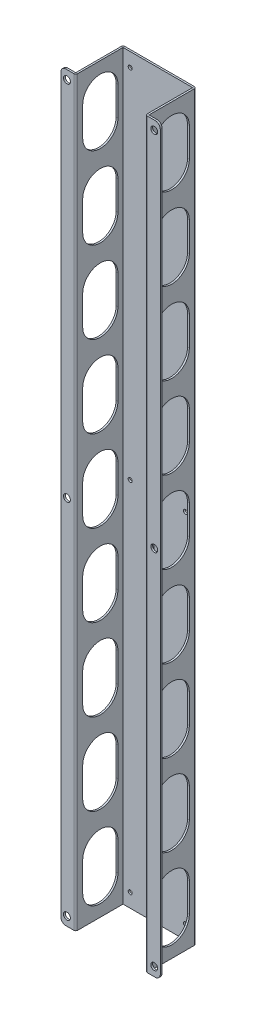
ISO-10303-21;
HEADER;
FILE_DESCRIPTION(('STEP AP214'),'2;1');
FILE_NAME('part.step','',(''),(''),'','','');
FILE_SCHEMA(('AUTOMOTIVE_DESIGN { 1 0 10303 214 1 1 1 1 }'));
ENDSEC;
DATA;
#1=APPLICATION_CONTEXT('core data for automotive mechanical design processes');
#2=APPLICATION_PROTOCOL_DEFINITION('international standard','automotive_design',2000,#1);
#3=PRODUCT_CONTEXT('',#1,'mechanical');
#4=PRODUCT('Part','Part','',(#3));
#5=PRODUCT_RELATED_PRODUCT_CATEGORY('part','',(#4));
#6=PRODUCT_DEFINITION_FORMATION('','',#4);
#7=PRODUCT_DEFINITION_CONTEXT('part definition',#1,'design');
#8=PRODUCT_DEFINITION('design','',#6,#7);
#9=PRODUCT_DEFINITION_SHAPE('','',#8);
#10=(LENGTH_UNIT() NAMED_UNIT(*) SI_UNIT(.MILLI.,.METRE.));
#11=(NAMED_UNIT(*) PLANE_ANGLE_UNIT() SI_UNIT($,.RADIAN.));
#12=(NAMED_UNIT(*) SI_UNIT($,.STERADIAN.) SOLID_ANGLE_UNIT());
#13=UNCERTAINTY_MEASURE_WITH_UNIT(LENGTH_MEASURE(1.E-05),#10,'distance_accuracy_value','');
#14=(GEOMETRIC_REPRESENTATION_CONTEXT(3) GLOBAL_UNCERTAINTY_ASSIGNED_CONTEXT((#13)) GLOBAL_UNIT_ASSIGNED_CONTEXT((#10,
#11,#12)) REPRESENTATION_CONTEXT('',''));
#15=CARTESIAN_POINT('',(0.,0.,0.));
#16=DIRECTION('',(0.,0.,1.));
#17=DIRECTION('',(1.,0.,0.));
#18=AXIS2_PLACEMENT_3D('',#15,#16,#17);
#19=CARTESIAN_POINT('',(0.,0.,61.976));
#20=DIRECTION('',(0.,0.,-1.));
#21=DIRECTION('',(-1.,0.,0.));
#22=AXIS2_PLACEMENT_3D('',#19,#20,#21);
#23=PLANE('',#22);
#24=CARTESIAN_POINT('',(55.1120386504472,457.2,61.976));
#25=DIRECTION('',(0.,0.,1.));
#26=DIRECTION('',(1.,0.,0.));
#27=AXIS2_PLACEMENT_3D('',#24,#25,#26);
#28=CIRCLE('',#27,4.36562499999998);
#29=CARTESIAN_POINT('',(59.4776636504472,457.2,61.976));
#30=VERTEX_POINT('',#29);
#31=EDGE_CURVE('E3132',#30,#30,#28,.T.);
#32=ORIENTED_EDGE('',*,*,#31,.F.);
#33=EDGE_LOOP('',(#32));
#34=FACE_BOUND('',#33,.T.);
#35=DIRECTION('',(1.,0.,0.));
#36=VECTOR('',#35,1.);
#37=CARTESIAN_POINT('',(62.7396586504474,-468.376,61.976));
#38=LINE('',#37,#36);
#39=CARTESIAN_POINT('',(56.3896586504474,-468.376,61.976));
#40=VERTEX_POINT('',#39);
#41=CARTESIAN_POINT('',(46.4252386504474,-468.376,61.976));
#42=VERTEX_POINT('',#41);
#43=EDGE_CURVE('E872',#40,#42,#38,.F.);
#44=ORIENTED_EDGE('',*,*,#43,.F.);
#45=CARTESIAN_POINT('',(56.3896586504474,-462.026,61.976));
#46=DIRECTION('',(0.,0.,-1.));
#47=DIRECTION('',(-1.,0.,0.));
#48=AXIS2_PLACEMENT_3D('',#45,#46,#47);
#49=CIRCLE('',#48,6.35);
#50=CARTESIAN_POINT('',(62.7396586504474,-462.026,61.976));
#51=VERTEX_POINT('',#50);
#52=EDGE_CURVE('E1082',#40,#51,#49,.F.);
#53=ORIENTED_EDGE('',*,*,#52,.T.);
#54=DIRECTION('',(0.,1.,0.));
#55=VECTOR('',#54,1.);
#56=CARTESIAN_POINT('',(62.7396586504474,468.376,61.976));
#57=LINE('',#56,#55);
#58=CARTESIAN_POINT('',(62.7396586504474,462.026,61.976));
#59=VERTEX_POINT('',#58);
#60=EDGE_CURVE('E875',#59,#51,#57,.F.);
#61=ORIENTED_EDGE('',*,*,#60,.F.);
#62=CARTESIAN_POINT('',(56.3896586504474,462.026,61.976));
#63=DIRECTION('',(0.,0.,-1.));
#64=DIRECTION('',(-1.,0.,0.));
#65=AXIS2_PLACEMENT_3D('',#62,#63,#64);
#66=CIRCLE('',#65,6.35);
#67=CARTESIAN_POINT('',(56.3896586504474,468.376,61.976));
#68=VERTEX_POINT('',#67);
#69=EDGE_CURVE('E1080',#59,#68,#66,.F.);
#70=ORIENTED_EDGE('',*,*,#69,.T.);
#71=DIRECTION('',(-1.,0.,0.));
#72=VECTOR('',#71,1.);
#73=CARTESIAN_POINT('',(46.2220386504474,468.376,61.976));
#74=LINE('',#73,#72);
#75=CARTESIAN_POINT('',(46.4252386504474,468.376,61.976));
#76=VERTEX_POINT('',#75);
#77=EDGE_CURVE('E878',#76,#68,#74,.F.);
#78=ORIENTED_EDGE('',*,*,#77,.F.);
#79=DIRECTION('',(0.,-1.,0.));
#80=VECTOR('',#79,1.);
#81=CARTESIAN_POINT('',(46.4252386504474,468.376,61.976));
#82=LINE('',#81,#80);
#83=EDGE_CURVE('E889',#42,#76,#82,.F.);
#84=ORIENTED_EDGE('',*,*,#83,.F.);
#85=EDGE_LOOP('',(#44,#53,#61,#70,#78,#84));
#86=FACE_BOUND('',#85,.T.);
#87=CARTESIAN_POINT('',(55.1120386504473,-457.2,61.976));
#88=DIRECTION('',(0.,0.,1.));
#89=DIRECTION('',(1.,0.,0.));
#90=AXIS2_PLACEMENT_3D('',#87,#88,#89);
#91=CIRCLE('',#90,4.36562499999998);
#92=CARTESIAN_POINT('',(59.4776636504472,-457.2,61.976));
#93=VERTEX_POINT('',#92);
#94=EDGE_CURVE('E3158',#93,#93,#91,.T.);
#95=ORIENTED_EDGE('',*,*,#94,.F.);
#96=EDGE_LOOP('',(#95));
#97=FACE_BOUND('',#96,.T.);
#98=CARTESIAN_POINT('',(55.1120386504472,0.,61.976));
#99=DIRECTION('',(0.,0.,1.));
#100=DIRECTION('',(1.,0.,0.));
#101=AXIS2_PLACEMENT_3D('',#98,#99,#100);
#102=CIRCLE('',#101,4.36562499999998);
#103=CARTESIAN_POINT('',(59.4776636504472,0.,61.976));
#104=VERTEX_POINT('',#103);
#105=EDGE_CURVE('E3146',#104,#104,#102,.T.);
#106=ORIENTED_EDGE('',*,*,#105,.F.);
#107=EDGE_LOOP('',(#106));
#108=FACE_BOUND('',#107,.T.);
#109=ADVANCED_FACE('F119',(#34,#86,#97,#108),#23,.F.);
#110=CARTESIAN_POINT('',(62.7396586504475,394.4366,30.9880000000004));
#111=DIRECTION('',(-1.,0.,0.));
#112=DIRECTION('',(0.,0.,1.));
#113=AXIS2_PLACEMENT_3D('',#110,#111,#112);
#114=CYLINDRICAL_SURFACE('',#113,22.225);
#115=DIRECTION('',(-1.,0.,0.));
#116=VECTOR('',#115,1.);
#117=CARTESIAN_POINT('',(62.7396586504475,394.4366,53.2130000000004));
#118=LINE('',#117,#116);
#119=CARTESIAN_POINT('',(-43.9555813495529,394.4366,53.213));
#120=VERTEX_POINT('',#119);
#121=CARTESIAN_POINT('',(-46.2339613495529,394.4366,53.213));
#122=VERTEX_POINT('',#121);
#123=EDGE_CURVE('E1550',#120,#122,#118,.T.);
#124=ORIENTED_EDGE('',*,*,#123,.F.);
#125=CARTESIAN_POINT('',(-43.9555813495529,394.4366,30.988));
#126=DIRECTION('',(1.,0.,0.));
#127=DIRECTION('',(0.,0.,-1.));
#128=AXIS2_PLACEMENT_3D('',#125,#126,#127);
#129=CIRCLE('',#128,22.225);
#130=CARTESIAN_POINT('',(-43.9555813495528,394.4366,8.76299999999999));
#131=VERTEX_POINT('',#130);
#132=EDGE_CURVE('E1538',#120,#131,#129,.T.);
#133=ORIENTED_EDGE('',*,*,#132,.T.);
#134=DIRECTION('',(-1.,0.,0.));
#135=VECTOR('',#134,1.);
#136=CARTESIAN_POINT('',(62.7396586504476,394.4366,8.76300000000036));
#137=LINE('',#136,#135);
#138=CARTESIAN_POINT('',(-46.2339613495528,394.4366,8.76299999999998));
#139=VERTEX_POINT('',#138);
#140=EDGE_CURVE('E13',#131,#139,#137,.T.);
#141=ORIENTED_EDGE('',*,*,#140,.T.);
#142=CARTESIAN_POINT('',(-46.2339613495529,394.4366,30.988));
#143=DIRECTION('',(1.,0.,0.));
#144=DIRECTION('',(0.,0.,-1.));
#145=AXIS2_PLACEMENT_3D('',#142,#143,#144);
#146=CIRCLE('',#145,22.225);
#147=EDGE_CURVE('E1542',#122,#139,#146,.T.);
#148=ORIENTED_EDGE('',*,*,#147,.F.);
#149=EDGE_LOOP('',(#124,#133,#141,#148));
#150=FACE_BOUND('',#149,.T.);
#151=ADVANCED_FACE('F121',(#150),#114,.F.);
#152=CARTESIAN_POINT('',(62.7396586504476,394.4366,8.76300000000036));
#153=DIRECTION('',(0.,0.,-1.));
#154=DIRECTION('',(-1.,0.,0.));
#155=AXIS2_PLACEMENT_3D('',#152,#153,#154);
#156=PLANE('',#155);
#157=ORIENTED_EDGE('',*,*,#140,.F.);
#158=DIRECTION('',(0.,1.,0.));
#159=VECTOR('',#158,1.);
#160=CARTESIAN_POINT('',(-43.9555813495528,825.6016,8.76299999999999));
#161=LINE('',#160,#159);
#162=CARTESIAN_POINT('',(-43.9555813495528,431.2666,8.76299999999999));
#163=VERTEX_POINT('',#162);
#164=EDGE_CURVE('E1535',#131,#163,#161,.T.);
#165=ORIENTED_EDGE('',*,*,#164,.T.);
#166=DIRECTION('',(-1.,0.,0.));
#167=VECTOR('',#166,1.);
#168=CARTESIAN_POINT('',(62.7396586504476,431.2666,8.76300000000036));
#169=LINE('',#168,#167);
#170=CARTESIAN_POINT('',(-46.2339613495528,431.2666,8.76299999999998));
#171=VERTEX_POINT('',#170);
#172=EDGE_CURVE('E127',#163,#171,#169,.T.);
#173=ORIENTED_EDGE('',*,*,#172,.T.);
#174=DIRECTION('',(0.,1.,0.));
#175=VECTOR('',#174,1.);
#176=CARTESIAN_POINT('',(-46.2339613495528,825.6016,8.76299999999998));
#177=LINE('',#176,#175);
#178=EDGE_CURVE('E141',#139,#171,#177,.T.);
#179=ORIENTED_EDGE('',*,*,#178,.F.);
#180=EDGE_LOOP('',(#157,#165,#173,#179));
#181=FACE_BOUND('',#180,.T.);
#182=ADVANCED_FACE('F1555',(#181),#156,.F.);
#183=CARTESIAN_POINT('',(62.7396586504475,431.2666,30.9880000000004));
#184=DIRECTION('',(-1.,0.,0.));
#185=DIRECTION('',(0.,0.,1.));
#186=AXIS2_PLACEMENT_3D('',#183,#184,#185);
#187=CYLINDRICAL_SURFACE('',#186,22.225);
#188=ORIENTED_EDGE('',*,*,#172,.F.);
#189=CARTESIAN_POINT('',(-43.9555813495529,431.2666,30.988));
#190=DIRECTION('',(1.,0.,0.));
#191=DIRECTION('',(0.,0.,-1.));
#192=AXIS2_PLACEMENT_3D('',#189,#190,#191);
#193=CIRCLE('',#192,22.225);
#194=CARTESIAN_POINT('',(-43.9555813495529,431.2666,53.213));
#195=VERTEX_POINT('',#194);
#196=EDGE_CURVE('E1532',#163,#195,#193,.T.);
#197=ORIENTED_EDGE('',*,*,#196,.T.);
#198=DIRECTION('',(-1.,0.,0.));
#199=VECTOR('',#198,1.);
#200=CARTESIAN_POINT('',(62.7396586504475,431.2666,53.2130000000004));
#201=LINE('',#200,#199);
#202=CARTESIAN_POINT('',(-46.233961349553,431.2666,53.213));
#203=VERTEX_POINT('',#202);
#204=EDGE_CURVE('E1547',#195,#203,#201,.T.);
#205=ORIENTED_EDGE('',*,*,#204,.T.);
#206=CARTESIAN_POINT('',(-46.2339613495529,431.2666,30.988));
#207=DIRECTION('',(1.,0.,0.));
#208=DIRECTION('',(0.,0.,-1.));
#209=AXIS2_PLACEMENT_3D('',#206,#207,#208);
#210=CIRCLE('',#209,22.225);
#211=EDGE_CURVE('E1545',#171,#203,#210,.T.);
#212=ORIENTED_EDGE('',*,*,#211,.F.);
#213=EDGE_LOOP('',(#188,#197,#205,#212));
#214=FACE_BOUND('',#213,.T.);
#215=ADVANCED_FACE('F1557',(#214),#187,.F.);
#216=CARTESIAN_POINT('',(62.7396586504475,431.2666,53.2130000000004));
#217=DIRECTION('',(0.,0.,1.));
#218=DIRECTION('',(1.,0.,0.));
#219=AXIS2_PLACEMENT_3D('',#216,#217,#218);
#220=PLANE('',#219);
#221=ORIENTED_EDGE('',*,*,#204,.F.);
#222=DIRECTION('',(0.,-1.,0.));
#223=VECTOR('',#222,1.);
#224=CARTESIAN_POINT('',(-43.955581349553,825.6016,53.2129999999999));
#225=LINE('',#224,#223);
#226=EDGE_CURVE('E1530',#195,#120,#225,.T.);
#227=ORIENTED_EDGE('',*,*,#226,.T.);
#228=ORIENTED_EDGE('',*,*,#123,.T.);
#229=DIRECTION('',(0.,-1.,0.));
#230=VECTOR('',#229,1.);
#231=CARTESIAN_POINT('',(-46.233961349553,825.6016,53.2129999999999));
#232=LINE('',#231,#230);
#233=EDGE_CURVE('E134',#203,#122,#232,.T.);
#234=ORIENTED_EDGE('',*,*,#233,.F.);
#235=EDGE_LOOP('',(#221,#227,#228,#234));
#236=FACE_BOUND('',#235,.T.);
#237=ADVANCED_FACE('F1562',(#236),#220,.F.);
#238=CARTESIAN_POINT('',(62.7396586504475,291.2364,30.9880000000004));
#239=DIRECTION('',(-1.,0.,0.));
#240=DIRECTION('',(0.,0.,1.));
#241=AXIS2_PLACEMENT_3D('',#238,#239,#240);
#242=CYLINDRICAL_SURFACE('',#241,22.225);
#243=DIRECTION('',(-1.,0.,0.));
#244=VECTOR('',#243,1.);
#245=CARTESIAN_POINT('',(62.7396586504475,291.2364,53.2130000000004));
#246=LINE('',#245,#244);
#247=CARTESIAN_POINT('',(-43.9555813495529,291.2364,53.213));
#248=VERTEX_POINT('',#247);
#249=CARTESIAN_POINT('',(-46.2339613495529,291.2364,53.213));
#250=VERTEX_POINT('',#249);
#251=EDGE_CURVE('E1521',#248,#250,#246,.T.);
#252=ORIENTED_EDGE('',*,*,#251,.F.);
#253=CARTESIAN_POINT('',(-43.9555813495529,291.2364,30.988));
#254=DIRECTION('',(1.,0.,0.));
#255=DIRECTION('',(0.,0.,-1.));
#256=AXIS2_PLACEMENT_3D('',#253,#254,#255);
#257=CIRCLE('',#256,22.225);
#258=CARTESIAN_POINT('',(-43.9555813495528,291.2364,8.76299999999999));
#259=VERTEX_POINT('',#258);
#260=EDGE_CURVE('E1506',#248,#259,#257,.T.);
#261=ORIENTED_EDGE('',*,*,#260,.T.);
#262=DIRECTION('',(-1.,0.,0.));
#263=VECTOR('',#262,1.);
#264=CARTESIAN_POINT('',(62.7396586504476,291.2364,8.76300000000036));
#265=LINE('',#264,#263);
#266=CARTESIAN_POINT('',(-46.2339613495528,291.2364,8.76299999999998));
#267=VERTEX_POINT('',#266);
#268=EDGE_CURVE('E1527',#259,#267,#265,.T.);
#269=ORIENTED_EDGE('',*,*,#268,.T.);
#270=CARTESIAN_POINT('',(-46.2339613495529,291.2364,30.988));
#271=DIRECTION('',(1.,0.,0.));
#272=DIRECTION('',(0.,0.,-1.));
#273=AXIS2_PLACEMENT_3D('',#270,#271,#272);
#274=CIRCLE('',#273,22.225);
#275=EDGE_CURVE('E1511',#250,#267,#274,.T.);
#276=ORIENTED_EDGE('',*,*,#275,.F.);
#277=EDGE_LOOP('',(#252,#261,#269,#276));
#278=FACE_BOUND('',#277,.T.);
#279=ADVANCED_FACE('F1983',(#278),#242,.F.);
#280=CARTESIAN_POINT('',(62.7396586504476,291.2364,8.76300000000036));
#281=DIRECTION('',(0.,0.,-1.));
#282=DIRECTION('',(-1.,0.,0.));
#283=AXIS2_PLACEMENT_3D('',#280,#281,#282);
#284=PLANE('',#283);
#285=ORIENTED_EDGE('',*,*,#268,.F.);
#286=DIRECTION('',(0.,1.,0.));
#287=VECTOR('',#286,1.);
#288=CARTESIAN_POINT('',(-43.9555813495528,722.4014,8.76299999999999));
#289=LINE('',#288,#287);
#290=CARTESIAN_POINT('',(-43.9555813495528,328.0664,8.76299999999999));
#291=VERTEX_POINT('',#290);
#292=EDGE_CURVE('E1503',#259,#291,#289,.T.);
#293=ORIENTED_EDGE('',*,*,#292,.T.);
#294=DIRECTION('',(-1.,0.,0.));
#295=VECTOR('',#294,1.);
#296=CARTESIAN_POINT('',(62.7396586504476,328.0664,8.76300000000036));
#297=LINE('',#296,#295);
#298=CARTESIAN_POINT('',(-46.2339613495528,328.0664,8.76299999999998));
#299=VERTEX_POINT('',#298);
#300=EDGE_CURVE('E1524',#291,#299,#297,.T.);
#301=ORIENTED_EDGE('',*,*,#300,.T.);
#302=DIRECTION('',(0.,1.,0.));
#303=VECTOR('',#302,1.);
#304=CARTESIAN_POINT('',(-46.2339613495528,722.4014,8.76299999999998));
#305=LINE('',#304,#303);
#306=EDGE_CURVE('E1513',#267,#299,#305,.T.);
#307=ORIENTED_EDGE('',*,*,#306,.F.);
#308=EDGE_LOOP('',(#285,#293,#301,#307));
#309=FACE_BOUND('',#308,.T.);
#310=ADVANCED_FACE('F1979',(#309),#284,.F.);
#311=CARTESIAN_POINT('',(62.7396586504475,328.0664,30.9880000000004));
#312=DIRECTION('',(-1.,0.,0.));
#313=DIRECTION('',(0.,0.,1.));
#314=AXIS2_PLACEMENT_3D('',#311,#312,#313);
#315=CYLINDRICAL_SURFACE('',#314,22.225);
#316=ORIENTED_EDGE('',*,*,#300,.F.);
#317=CARTESIAN_POINT('',(-43.9555813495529,328.0664,30.988));
#318=DIRECTION('',(1.,0.,0.));
#319=DIRECTION('',(0.,0.,-1.));
#320=AXIS2_PLACEMENT_3D('',#317,#318,#319);
#321=CIRCLE('',#320,22.225);
#322=CARTESIAN_POINT('',(-43.9555813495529,328.0664,53.213));
#323=VERTEX_POINT('',#322);
#324=EDGE_CURVE('E1500',#291,#323,#321,.T.);
#325=ORIENTED_EDGE('',*,*,#324,.T.);
#326=DIRECTION('',(-1.,0.,0.));
#327=VECTOR('',#326,1.);
#328=CARTESIAN_POINT('',(62.7396586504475,328.0664,53.2130000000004));
#329=LINE('',#328,#327);
#330=CARTESIAN_POINT('',(-46.2339613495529,328.0664,53.213));
#331=VERTEX_POINT('',#330);
#332=EDGE_CURVE('E1518',#323,#331,#329,.T.);
#333=ORIENTED_EDGE('',*,*,#332,.T.);
#334=CARTESIAN_POINT('',(-46.2339613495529,328.0664,30.988));
#335=DIRECTION('',(1.,0.,0.));
#336=DIRECTION('',(0.,0.,-1.));
#337=AXIS2_PLACEMENT_3D('',#334,#335,#336);
#338=CIRCLE('',#337,22.225);
#339=EDGE_CURVE('E1515',#299,#331,#338,.T.);
#340=ORIENTED_EDGE('',*,*,#339,.F.);
#341=EDGE_LOOP('',(#316,#325,#333,#340));
#342=FACE_BOUND('',#341,.T.);
#343=ADVANCED_FACE('F1975',(#342),#315,.F.);
#344=CARTESIAN_POINT('',(62.7396586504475,328.0664,53.2130000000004));
#345=DIRECTION('',(0.,0.,1.));
#346=DIRECTION('',(1.,0.,0.));
#347=AXIS2_PLACEMENT_3D('',#344,#345,#346);
#348=PLANE('',#347);
#349=ORIENTED_EDGE('',*,*,#332,.F.);
#350=DIRECTION('',(0.,-1.,0.));
#351=VECTOR('',#350,1.);
#352=CARTESIAN_POINT('',(-43.955581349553,722.4014,53.2129999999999));
#353=LINE('',#352,#351);
#354=EDGE_CURVE('E1498',#323,#248,#353,.T.);
#355=ORIENTED_EDGE('',*,*,#354,.T.);
#356=ORIENTED_EDGE('',*,*,#251,.T.);
#357=DIRECTION('',(0.,-1.,0.));
#358=VECTOR('',#357,1.);
#359=CARTESIAN_POINT('',(-46.233961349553,722.4014,53.2129999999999));
#360=LINE('',#359,#358);
#361=EDGE_CURVE('E1509',#331,#250,#360,.T.);
#362=ORIENTED_EDGE('',*,*,#361,.F.);
#363=EDGE_LOOP('',(#349,#355,#356,#362));
#364=FACE_BOUND('',#363,.T.);
#365=ADVANCED_FACE('F1971',(#364),#348,.F.);
#366=CARTESIAN_POINT('',(62.7396586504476,188.0362,30.9880000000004));
#367=DIRECTION('',(-1.,0.,0.));
#368=DIRECTION('',(0.,0.,1.));
#369=AXIS2_PLACEMENT_3D('',#366,#367,#368);
#370=CYLINDRICAL_SURFACE('',#369,22.225);
#371=DIRECTION('',(-1.,0.,0.));
#372=VECTOR('',#371,1.);
#373=CARTESIAN_POINT('',(62.7396586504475,188.0362,53.2130000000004));
#374=LINE('',#373,#372);
#375=CARTESIAN_POINT('',(-43.9555813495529,188.0362,53.213));
#376=VERTEX_POINT('',#375);
#377=CARTESIAN_POINT('',(-46.2339613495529,188.0362,53.213));
#378=VERTEX_POINT('',#377);
#379=EDGE_CURVE('E1489',#376,#378,#374,.T.);
#380=ORIENTED_EDGE('',*,*,#379,.F.);
#381=CARTESIAN_POINT('',(-43.9555813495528,188.0362,30.988));
#382=DIRECTION('',(1.,0.,0.));
#383=DIRECTION('',(0.,0.,-1.));
#384=AXIS2_PLACEMENT_3D('',#381,#382,#383);
#385=CIRCLE('',#384,22.225);
#386=CARTESIAN_POINT('',(-43.9555813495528,188.0362,8.76299999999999));
#387=VERTEX_POINT('',#386);
#388=EDGE_CURVE('E1474',#376,#387,#385,.T.);
#389=ORIENTED_EDGE('',*,*,#388,.T.);
#390=DIRECTION('',(-1.,0.,0.));
#391=VECTOR('',#390,1.);
#392=CARTESIAN_POINT('',(62.7396586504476,188.0362,8.76300000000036));
#393=LINE('',#392,#391);
#394=CARTESIAN_POINT('',(-46.2339613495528,188.0362,8.76299999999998));
#395=VERTEX_POINT('',#394);
#396=EDGE_CURVE('E1495',#387,#395,#393,.T.);
#397=ORIENTED_EDGE('',*,*,#396,.T.);
#398=CARTESIAN_POINT('',(-46.2339613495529,188.0362,30.988));
#399=DIRECTION('',(1.,0.,0.));
#400=DIRECTION('',(0.,0.,-1.));
#401=AXIS2_PLACEMENT_3D('',#398,#399,#400);
#402=CIRCLE('',#401,22.225);
#403=EDGE_CURVE('E1479',#378,#395,#402,.T.);
#404=ORIENTED_EDGE('',*,*,#403,.F.);
#405=EDGE_LOOP('',(#380,#389,#397,#404));
#406=FACE_BOUND('',#405,.T.);
#407=ADVANCED_FACE('F1967',(#406),#370,.F.);
#408=CARTESIAN_POINT('',(62.7396586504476,188.0362,8.76300000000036));
#409=DIRECTION('',(0.,0.,-1.));
#410=DIRECTION('',(-1.,0.,0.));
#411=AXIS2_PLACEMENT_3D('',#408,#409,#410);
#412=PLANE('',#411);
#413=ORIENTED_EDGE('',*,*,#396,.F.);
#414=DIRECTION('',(0.,1.,0.));
#415=VECTOR('',#414,1.);
#416=CARTESIAN_POINT('',(-43.9555813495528,619.2012,8.76299999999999));
#417=LINE('',#416,#415);
#418=CARTESIAN_POINT('',(-43.9555813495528,224.8662,8.76299999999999));
#419=VERTEX_POINT('',#418);
#420=EDGE_CURVE('E1471',#387,#419,#417,.T.);
#421=ORIENTED_EDGE('',*,*,#420,.T.);
#422=DIRECTION('',(-1.,0.,0.));
#423=VECTOR('',#422,1.);
#424=CARTESIAN_POINT('',(62.7396586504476,224.8662,8.76300000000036));
#425=LINE('',#424,#423);
#426=CARTESIAN_POINT('',(-46.2339613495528,224.8662,8.76299999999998));
#427=VERTEX_POINT('',#426);
#428=EDGE_CURVE('E1492',#419,#427,#425,.T.);
#429=ORIENTED_EDGE('',*,*,#428,.T.);
#430=DIRECTION('',(0.,1.,0.));
#431=VECTOR('',#430,1.);
#432=CARTESIAN_POINT('',(-46.2339613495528,619.2012,8.76299999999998));
#433=LINE('',#432,#431);
#434=EDGE_CURVE('E1481',#395,#427,#433,.T.);
#435=ORIENTED_EDGE('',*,*,#434,.F.);
#436=EDGE_LOOP('',(#413,#421,#429,#435));
#437=FACE_BOUND('',#436,.T.);
#438=ADVANCED_FACE('F1963',(#437),#412,.F.);
#439=CARTESIAN_POINT('',(62.7396586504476,224.8662,30.9880000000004));
#440=DIRECTION('',(-1.,0.,0.));
#441=DIRECTION('',(0.,0.,1.));
#442=AXIS2_PLACEMENT_3D('',#439,#440,#441);
#443=CYLINDRICAL_SURFACE('',#442,22.225);
#444=ORIENTED_EDGE('',*,*,#428,.F.);
#445=CARTESIAN_POINT('',(-43.9555813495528,224.8662,30.988));
#446=DIRECTION('',(1.,0.,0.));
#447=DIRECTION('',(0.,0.,-1.));
#448=AXIS2_PLACEMENT_3D('',#445,#446,#447);
#449=CIRCLE('',#448,22.225);
#450=CARTESIAN_POINT('',(-43.9555813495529,224.8662,53.213));
#451=VERTEX_POINT('',#450);
#452=EDGE_CURVE('E1468',#419,#451,#449,.T.);
#453=ORIENTED_EDGE('',*,*,#452,.T.);
#454=DIRECTION('',(-1.,0.,0.));
#455=VECTOR('',#454,1.);
#456=CARTESIAN_POINT('',(62.7396586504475,224.8662,53.2130000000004));
#457=LINE('',#456,#455);
#458=CARTESIAN_POINT('',(-46.2339613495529,224.8662,53.213));
#459=VERTEX_POINT('',#458);
#460=EDGE_CURVE('E1486',#451,#459,#457,.T.);
#461=ORIENTED_EDGE('',*,*,#460,.T.);
#462=CARTESIAN_POINT('',(-46.2339613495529,224.8662,30.988));
#463=DIRECTION('',(1.,0.,0.));
#464=DIRECTION('',(0.,0.,-1.));
#465=AXIS2_PLACEMENT_3D('',#462,#463,#464);
#466=CIRCLE('',#465,22.225);
#467=EDGE_CURVE('E1483',#427,#459,#466,.T.);
#468=ORIENTED_EDGE('',*,*,#467,.F.);
#469=EDGE_LOOP('',(#444,#453,#461,#468));
#470=FACE_BOUND('',#469,.T.);
#471=ADVANCED_FACE('F1959',(#470),#443,.F.);
#472=CARTESIAN_POINT('',(62.7396586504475,224.8662,53.2130000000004));
#473=DIRECTION('',(0.,0.,1.));
#474=DIRECTION('',(1.,0.,0.));
#475=AXIS2_PLACEMENT_3D('',#472,#473,#474);
#476=PLANE('',#475);
#477=ORIENTED_EDGE('',*,*,#460,.F.);
#478=DIRECTION('',(0.,-1.,0.));
#479=VECTOR('',#478,1.);
#480=CARTESIAN_POINT('',(-43.955581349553,619.2012,53.2129999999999));
#481=LINE('',#480,#479);
#482=EDGE_CURVE('E1466',#451,#376,#481,.T.);
#483=ORIENTED_EDGE('',*,*,#482,.T.);
#484=ORIENTED_EDGE('',*,*,#379,.T.);
#485=DIRECTION('',(0.,-1.,0.));
#486=VECTOR('',#485,1.);
#487=CARTESIAN_POINT('',(-46.233961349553,619.2012,53.2129999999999));
#488=LINE('',#487,#486);
#489=EDGE_CURVE('E1477',#459,#378,#488,.T.);
#490=ORIENTED_EDGE('',*,*,#489,.F.);
#491=EDGE_LOOP('',(#477,#483,#484,#490));
#492=FACE_BOUND('',#491,.T.);
#493=ADVANCED_FACE('F1955',(#492),#476,.F.);
#494=CARTESIAN_POINT('',(62.7396586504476,84.836,30.9880000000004));
#495=DIRECTION('',(-1.,0.,0.));
#496=DIRECTION('',(0.,0.,1.));
#497=AXIS2_PLACEMENT_3D('',#494,#495,#496);
#498=CYLINDRICAL_SURFACE('',#497,22.225);
#499=DIRECTION('',(-1.,0.,0.));
#500=VECTOR('',#499,1.);
#501=CARTESIAN_POINT('',(62.7396586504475,84.836,53.2130000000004));
#502=LINE('',#501,#500);
#503=CARTESIAN_POINT('',(-43.9555813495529,84.836,53.213));
#504=VERTEX_POINT('',#503);
#505=CARTESIAN_POINT('',(-46.2339613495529,84.836,53.213));
#506=VERTEX_POINT('',#505);
#507=EDGE_CURVE('E1457',#504,#506,#502,.T.);
#508=ORIENTED_EDGE('',*,*,#507,.F.);
#509=CARTESIAN_POINT('',(-43.9555813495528,84.836,30.988));
#510=DIRECTION('',(1.,0.,0.));
#511=DIRECTION('',(0.,0.,-1.));
#512=AXIS2_PLACEMENT_3D('',#509,#510,#511);
#513=CIRCLE('',#512,22.225);
#514=CARTESIAN_POINT('',(-43.9555813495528,84.836,8.76299999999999));
#515=VERTEX_POINT('',#514);
#516=EDGE_CURVE('E1442',#504,#515,#513,.T.);
#517=ORIENTED_EDGE('',*,*,#516,.T.);
#518=DIRECTION('',(-1.,0.,0.));
#519=VECTOR('',#518,1.);
#520=CARTESIAN_POINT('',(62.7396586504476,84.836,8.76300000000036));
#521=LINE('',#520,#519);
#522=CARTESIAN_POINT('',(-46.2339613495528,84.836,8.76299999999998));
#523=VERTEX_POINT('',#522);
#524=EDGE_CURVE('E1463',#515,#523,#521,.T.);
#525=ORIENTED_EDGE('',*,*,#524,.T.);
#526=CARTESIAN_POINT('',(-46.2339613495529,84.836,30.988));
#527=DIRECTION('',(1.,0.,0.));
#528=DIRECTION('',(0.,0.,-1.));
#529=AXIS2_PLACEMENT_3D('',#526,#527,#528);
#530=CIRCLE('',#529,22.225);
#531=EDGE_CURVE('E1447',#506,#523,#530,.T.);
#532=ORIENTED_EDGE('',*,*,#531,.F.);
#533=EDGE_LOOP('',(#508,#517,#525,#532));
#534=FACE_BOUND('',#533,.T.);
#535=ADVANCED_FACE('F1951',(#534),#498,.F.);
#536=CARTESIAN_POINT('',(62.7396586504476,84.836,8.76300000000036));
#537=DIRECTION('',(0.,0.,-1.));
#538=DIRECTION('',(-1.,0.,0.));
#539=AXIS2_PLACEMENT_3D('',#536,#537,#538);
#540=PLANE('',#539);
#541=ORIENTED_EDGE('',*,*,#524,.F.);
#542=DIRECTION('',(0.,1.,0.));
#543=VECTOR('',#542,1.);
#544=CARTESIAN_POINT('',(-43.9555813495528,516.001,8.76299999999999));
#545=LINE('',#544,#543);
#546=CARTESIAN_POINT('',(-43.9555813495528,121.666,8.76299999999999));
#547=VERTEX_POINT('',#546);
#548=EDGE_CURVE('E1439',#515,#547,#545,.T.);
#549=ORIENTED_EDGE('',*,*,#548,.T.);
#550=DIRECTION('',(-1.,0.,0.));
#551=VECTOR('',#550,1.);
#552=CARTESIAN_POINT('',(62.7396586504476,121.666,8.76300000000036));
#553=LINE('',#552,#551);
#554=CARTESIAN_POINT('',(-46.2339613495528,121.666,8.76299999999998));
#555=VERTEX_POINT('',#554);
#556=EDGE_CURVE('E1460',#547,#555,#553,.T.);
#557=ORIENTED_EDGE('',*,*,#556,.T.);
#558=DIRECTION('',(0.,1.,0.));
#559=VECTOR('',#558,1.);
#560=CARTESIAN_POINT('',(-46.2339613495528,516.001,8.76299999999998));
#561=LINE('',#560,#559);
#562=EDGE_CURVE('E1449',#523,#555,#561,.T.);
#563=ORIENTED_EDGE('',*,*,#562,.F.);
#564=EDGE_LOOP('',(#541,#549,#557,#563));
#565=FACE_BOUND('',#564,.T.);
#566=ADVANCED_FACE('F1947',(#565),#540,.F.);
#567=CARTESIAN_POINT('',(62.7396586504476,121.666,30.9880000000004));
#568=DIRECTION('',(-1.,0.,0.));
#569=DIRECTION('',(0.,0.,1.));
#570=AXIS2_PLACEMENT_3D('',#567,#568,#569);
#571=CYLINDRICAL_SURFACE('',#570,22.225);
#572=ORIENTED_EDGE('',*,*,#556,.F.);
#573=CARTESIAN_POINT('',(-43.9555813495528,121.666,30.988));
#574=DIRECTION('',(1.,0.,0.));
#575=DIRECTION('',(0.,0.,-1.));
#576=AXIS2_PLACEMENT_3D('',#573,#574,#575);
#577=CIRCLE('',#576,22.225);
#578=CARTESIAN_POINT('',(-43.9555813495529,121.666,53.213));
#579=VERTEX_POINT('',#578);
#580=EDGE_CURVE('E1436',#547,#579,#577,.T.);
#581=ORIENTED_EDGE('',*,*,#580,.T.);
#582=DIRECTION('',(-1.,0.,0.));
#583=VECTOR('',#582,1.);
#584=CARTESIAN_POINT('',(62.7396586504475,121.666,53.2130000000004));
#585=LINE('',#584,#583);
#586=CARTESIAN_POINT('',(-46.2339613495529,121.666,53.213));
#587=VERTEX_POINT('',#586);
#588=EDGE_CURVE('E1454',#579,#587,#585,.T.);
#589=ORIENTED_EDGE('',*,*,#588,.T.);
#590=CARTESIAN_POINT('',(-46.2339613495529,121.666,30.988));
#591=DIRECTION('',(1.,0.,0.));
#592=DIRECTION('',(0.,0.,-1.));
#593=AXIS2_PLACEMENT_3D('',#590,#591,#592);
#594=CIRCLE('',#593,22.225);
#595=EDGE_CURVE('E1451',#555,#587,#594,.T.);
#596=ORIENTED_EDGE('',*,*,#595,.F.);
#597=EDGE_LOOP('',(#572,#581,#589,#596));
#598=FACE_BOUND('',#597,.T.);
#599=ADVANCED_FACE('F1943',(#598),#571,.F.);
#600=CARTESIAN_POINT('',(62.7396586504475,121.666,53.2130000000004));
#601=DIRECTION('',(0.,0.,1.));
#602=DIRECTION('',(1.,0.,0.));
#603=AXIS2_PLACEMENT_3D('',#600,#601,#602);
#604=PLANE('',#603);
#605=ORIENTED_EDGE('',*,*,#588,.F.);
#606=DIRECTION('',(0.,-1.,0.));
#607=VECTOR('',#606,1.);
#608=CARTESIAN_POINT('',(-43.955581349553,516.001,53.2129999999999));
#609=LINE('',#608,#607);
#610=EDGE_CURVE('E1434',#579,#504,#609,.T.);
#611=ORIENTED_EDGE('',*,*,#610,.T.);
#612=ORIENTED_EDGE('',*,*,#507,.T.);
#613=DIRECTION('',(0.,-1.,0.));
#614=VECTOR('',#613,1.);
#615=CARTESIAN_POINT('',(-46.233961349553,516.001,53.2129999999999));
#616=LINE('',#615,#614);
#617=EDGE_CURVE('E1445',#587,#506,#616,.T.);
#618=ORIENTED_EDGE('',*,*,#617,.F.);
#619=EDGE_LOOP('',(#605,#611,#612,#618));
#620=FACE_BOUND('',#619,.T.);
#621=ADVANCED_FACE('F1939',(#620),#604,.F.);
#622=CARTESIAN_POINT('',(62.7396586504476,-18.3641999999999,30.9880000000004));
#623=DIRECTION('',(-1.,0.,0.));
#624=DIRECTION('',(0.,0.,1.));
#625=AXIS2_PLACEMENT_3D('',#622,#623,#624);
#626=CYLINDRICAL_SURFACE('',#625,22.225);
#627=DIRECTION('',(-1.,0.,0.));
#628=VECTOR('',#627,1.);
#629=CARTESIAN_POINT('',(62.7396586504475,-18.3641999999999,53.2130000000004));
#630=LINE('',#629,#628);
#631=CARTESIAN_POINT('',(-43.9555813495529,-18.3641999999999,53.213));
#632=VERTEX_POINT('',#631);
#633=CARTESIAN_POINT('',(-46.2339613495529,-18.3641999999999,53.213));
#634=VERTEX_POINT('',#633);
#635=EDGE_CURVE('E1425',#632,#634,#630,.T.);
#636=ORIENTED_EDGE('',*,*,#635,.F.);
#637=CARTESIAN_POINT('',(-43.9555813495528,-18.3641999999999,30.988));
#638=DIRECTION('',(1.,0.,0.));
#639=DIRECTION('',(0.,0.,-1.));
#640=AXIS2_PLACEMENT_3D('',#637,#638,#639);
#641=CIRCLE('',#640,22.225);
#642=CARTESIAN_POINT('',(-43.9555813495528,-18.3641999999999,8.76299999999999));
#643=VERTEX_POINT('',#642);
#644=EDGE_CURVE('E1410',#632,#643,#641,.T.);
#645=ORIENTED_EDGE('',*,*,#644,.T.);
#646=DIRECTION('',(-1.,0.,0.));
#647=VECTOR('',#646,1.);
#648=CARTESIAN_POINT('',(62.7396586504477,-18.3641999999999,8.76300000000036));
#649=LINE('',#648,#647);
#650=CARTESIAN_POINT('',(-46.2339613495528,-18.3641999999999,8.76299999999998));
#651=VERTEX_POINT('',#650);
#652=EDGE_CURVE('E1431',#643,#651,#649,.T.);
#653=ORIENTED_EDGE('',*,*,#652,.T.);
#654=CARTESIAN_POINT('',(-46.2339613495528,-18.3641999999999,30.988));
#655=DIRECTION('',(1.,0.,0.));
#656=DIRECTION('',(0.,0.,-1.));
#657=AXIS2_PLACEMENT_3D('',#654,#655,#656);
#658=CIRCLE('',#657,22.225);
#659=EDGE_CURVE('E1415',#634,#651,#658,.T.);
#660=ORIENTED_EDGE('',*,*,#659,.F.);
#661=EDGE_LOOP('',(#636,#645,#653,#660));
#662=FACE_BOUND('',#661,.T.);
#663=ADVANCED_FACE('F1935',(#662),#626,.F.);
#664=CARTESIAN_POINT('',(62.7396586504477,-18.3641999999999,8.76300000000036));
#665=DIRECTION('',(0.,0.,-1.));
#666=DIRECTION('',(-1.,0.,0.));
#667=AXIS2_PLACEMENT_3D('',#664,#665,#666);
#668=PLANE('',#667);
#669=ORIENTED_EDGE('',*,*,#652,.F.);
#670=DIRECTION('',(0.,1.,0.));
#671=VECTOR('',#670,1.);
#672=CARTESIAN_POINT('',(-43.9555813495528,412.8008,8.76299999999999));
#673=LINE('',#672,#671);
#674=CARTESIAN_POINT('',(-43.9555813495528,18.4658,8.76299999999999));
#675=VERTEX_POINT('',#674);
#676=EDGE_CURVE('E1407',#643,#675,#673,.T.);
#677=ORIENTED_EDGE('',*,*,#676,.T.);
#678=DIRECTION('',(-1.,0.,0.));
#679=VECTOR('',#678,1.);
#680=CARTESIAN_POINT('',(62.7396586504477,18.4658,8.76300000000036));
#681=LINE('',#680,#679);
#682=CARTESIAN_POINT('',(-46.2339613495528,18.4658,8.76299999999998));
#683=VERTEX_POINT('',#682);
#684=EDGE_CURVE('E1428',#675,#683,#681,.T.);
#685=ORIENTED_EDGE('',*,*,#684,.T.);
#686=DIRECTION('',(0.,1.,0.));
#687=VECTOR('',#686,1.);
#688=CARTESIAN_POINT('',(-46.2339613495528,412.8008,8.76299999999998));
#689=LINE('',#688,#687);
#690=EDGE_CURVE('E1417',#651,#683,#689,.T.);
#691=ORIENTED_EDGE('',*,*,#690,.F.);
#692=EDGE_LOOP('',(#669,#677,#685,#691));
#693=FACE_BOUND('',#692,.T.);
#694=ADVANCED_FACE('F1931',(#693),#668,.F.);
#695=CARTESIAN_POINT('',(62.7396586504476,18.4658,30.9880000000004));
#696=DIRECTION('',(-1.,0.,0.));
#697=DIRECTION('',(0.,0.,1.));
#698=AXIS2_PLACEMENT_3D('',#695,#696,#697);
#699=CYLINDRICAL_SURFACE('',#698,22.225);
#700=ORIENTED_EDGE('',*,*,#684,.F.);
#701=CARTESIAN_POINT('',(-43.9555813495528,18.4658,30.988));
#702=DIRECTION('',(1.,0.,0.));
#703=DIRECTION('',(0.,0.,-1.));
#704=AXIS2_PLACEMENT_3D('',#701,#702,#703);
#705=CIRCLE('',#704,22.225);
#706=CARTESIAN_POINT('',(-43.9555813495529,18.4658,53.213));
#707=VERTEX_POINT('',#706);
#708=EDGE_CURVE('E1404',#675,#707,#705,.T.);
#709=ORIENTED_EDGE('',*,*,#708,.T.);
#710=DIRECTION('',(-1.,0.,0.));
#711=VECTOR('',#710,1.);
#712=CARTESIAN_POINT('',(62.7396586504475,18.4658,53.2130000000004));
#713=LINE('',#712,#711);
#714=CARTESIAN_POINT('',(-46.2339613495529,18.4658,53.213));
#715=VERTEX_POINT('',#714);
#716=EDGE_CURVE('E1422',#707,#715,#713,.T.);
#717=ORIENTED_EDGE('',*,*,#716,.T.);
#718=CARTESIAN_POINT('',(-46.2339613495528,18.4658,30.988));
#719=DIRECTION('',(1.,0.,0.));
#720=DIRECTION('',(0.,0.,-1.));
#721=AXIS2_PLACEMENT_3D('',#718,#719,#720);
#722=CIRCLE('',#721,22.225);
#723=EDGE_CURVE('E1419',#683,#715,#722,.T.);
#724=ORIENTED_EDGE('',*,*,#723,.F.);
#725=EDGE_LOOP('',(#700,#709,#717,#724));
#726=FACE_BOUND('',#725,.T.);
#727=ADVANCED_FACE('F1927',(#726),#699,.F.);
#728=CARTESIAN_POINT('',(62.7396586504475,18.4658,53.2130000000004));
#729=DIRECTION('',(0.,0.,1.));
#730=DIRECTION('',(1.,0.,0.));
#731=AXIS2_PLACEMENT_3D('',#728,#729,#730);
#732=PLANE('',#731);
#733=ORIENTED_EDGE('',*,*,#716,.F.);
#734=DIRECTION('',(0.,-1.,0.));
#735=VECTOR('',#734,1.);
#736=CARTESIAN_POINT('',(-43.9555813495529,412.8008,53.2129999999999));
#737=LINE('',#736,#735);
#738=EDGE_CURVE('E1402',#707,#632,#737,.T.);
#739=ORIENTED_EDGE('',*,*,#738,.T.);
#740=ORIENTED_EDGE('',*,*,#635,.T.);
#741=DIRECTION('',(0.,-1.,0.));
#742=VECTOR('',#741,1.);
#743=CARTESIAN_POINT('',(-46.233961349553,412.8008,53.2129999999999));
#744=LINE('',#743,#742);
#745=EDGE_CURVE('E1413',#715,#634,#744,.T.);
#746=ORIENTED_EDGE('',*,*,#745,.F.);
#747=EDGE_LOOP('',(#733,#739,#740,#746));
#748=FACE_BOUND('',#747,.T.);
#749=ADVANCED_FACE('F1923',(#748),#732,.F.);
#750=CARTESIAN_POINT('',(62.7396586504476,-121.5644,30.9880000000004));
#751=DIRECTION('',(-1.,0.,0.));
#752=DIRECTION('',(0.,0.,1.));
#753=AXIS2_PLACEMENT_3D('',#750,#751,#752);
#754=CYLINDRICAL_SURFACE('',#753,22.225);
#755=DIRECTION('',(-1.,0.,0.));
#756=VECTOR('',#755,1.);
#757=CARTESIAN_POINT('',(62.7396586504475,-121.5644,53.2130000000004));
#758=LINE('',#757,#756);
#759=CARTESIAN_POINT('',(-43.9555813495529,-121.5644,53.213));
#760=VERTEX_POINT('',#759);
#761=CARTESIAN_POINT('',(-46.2339613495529,-121.5644,53.213));
#762=VERTEX_POINT('',#761);
#763=EDGE_CURVE('E1393',#760,#762,#758,.T.);
#764=ORIENTED_EDGE('',*,*,#763,.F.);
#765=CARTESIAN_POINT('',(-43.9555813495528,-121.5644,30.988));
#766=DIRECTION('',(1.,0.,0.));
#767=DIRECTION('',(0.,0.,-1.));
#768=AXIS2_PLACEMENT_3D('',#765,#766,#767);
#769=CIRCLE('',#768,22.225);
#770=CARTESIAN_POINT('',(-43.9555813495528,-121.5644,8.76299999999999));
#771=VERTEX_POINT('',#770);
#772=EDGE_CURVE('E1378',#760,#771,#769,.T.);
#773=ORIENTED_EDGE('',*,*,#772,.T.);
#774=DIRECTION('',(-1.,0.,0.));
#775=VECTOR('',#774,1.);
#776=CARTESIAN_POINT('',(62.7396586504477,-121.5644,8.76300000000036));
#777=LINE('',#776,#775);
#778=CARTESIAN_POINT('',(-46.2339613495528,-121.5644,8.76299999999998));
#779=VERTEX_POINT('',#778);
#780=EDGE_CURVE('E1399',#771,#779,#777,.T.);
#781=ORIENTED_EDGE('',*,*,#780,.T.);
#782=CARTESIAN_POINT('',(-46.2339613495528,-121.5644,30.988));
#783=DIRECTION('',(1.,0.,0.));
#784=DIRECTION('',(0.,0.,-1.));
#785=AXIS2_PLACEMENT_3D('',#782,#783,#784);
#786=CIRCLE('',#785,22.225);
#787=EDGE_CURVE('E1383',#762,#779,#786,.T.);
#788=ORIENTED_EDGE('',*,*,#787,.F.);
#789=EDGE_LOOP('',(#764,#773,#781,#788));
#790=FACE_BOUND('',#789,.T.);
#791=ADVANCED_FACE('F1919',(#790),#754,.F.);
#792=CARTESIAN_POINT('',(62.7396586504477,-121.5644,8.76300000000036));
#793=DIRECTION('',(0.,0.,-1.));
#794=DIRECTION('',(-1.,0.,0.));
#795=AXIS2_PLACEMENT_3D('',#792,#793,#794);
#796=PLANE('',#795);
#797=ORIENTED_EDGE('',*,*,#780,.F.);
#798=DIRECTION('',(0.,1.,0.));
#799=VECTOR('',#798,1.);
#800=CARTESIAN_POINT('',(-43.9555813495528,309.6006,8.76299999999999));
#801=LINE('',#800,#799);
#802=CARTESIAN_POINT('',(-43.9555813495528,-84.7344,8.76299999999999));
#803=VERTEX_POINT('',#802);
#804=EDGE_CURVE('E1375',#771,#803,#801,.T.);
#805=ORIENTED_EDGE('',*,*,#804,.T.);
#806=DIRECTION('',(-1.,0.,0.));
#807=VECTOR('',#806,1.);
#808=CARTESIAN_POINT('',(62.7396586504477,-84.7344,8.76300000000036));
#809=LINE('',#808,#807);
#810=CARTESIAN_POINT('',(-46.2339613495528,-84.7344,8.76299999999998));
#811=VERTEX_POINT('',#810);
#812=EDGE_CURVE('E1396',#803,#811,#809,.T.);
#813=ORIENTED_EDGE('',*,*,#812,.T.);
#814=DIRECTION('',(0.,1.,0.));
#815=VECTOR('',#814,1.);
#816=CARTESIAN_POINT('',(-46.2339613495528,309.6006,8.76299999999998));
#817=LINE('',#816,#815);
#818=EDGE_CURVE('E1385',#779,#811,#817,.T.);
#819=ORIENTED_EDGE('',*,*,#818,.F.);
#820=EDGE_LOOP('',(#797,#805,#813,#819));
#821=FACE_BOUND('',#820,.T.);
#822=ADVANCED_FACE('F1915',(#821),#796,.F.);
#823=CARTESIAN_POINT('',(62.7396586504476,-84.7344,30.9880000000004));
#824=DIRECTION('',(-1.,0.,0.));
#825=DIRECTION('',(0.,0.,1.));
#826=AXIS2_PLACEMENT_3D('',#823,#824,#825);
#827=CYLINDRICAL_SURFACE('',#826,22.225);
#828=ORIENTED_EDGE('',*,*,#812,.F.);
#829=CARTESIAN_POINT('',(-43.9555813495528,-84.7344,30.988));
#830=DIRECTION('',(1.,0.,0.));
#831=DIRECTION('',(0.,0.,-1.));
#832=AXIS2_PLACEMENT_3D('',#829,#830,#831);
#833=CIRCLE('',#832,22.225);
#834=CARTESIAN_POINT('',(-43.9555813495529,-84.7344,53.213));
#835=VERTEX_POINT('',#834);
#836=EDGE_CURVE('E1372',#803,#835,#833,.T.);
#837=ORIENTED_EDGE('',*,*,#836,.T.);
#838=DIRECTION('',(-1.,0.,0.));
#839=VECTOR('',#838,1.);
#840=CARTESIAN_POINT('',(62.7396586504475,-84.7344,53.2130000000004));
#841=LINE('',#840,#839);
#842=CARTESIAN_POINT('',(-46.2339613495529,-84.7344,53.213));
#843=VERTEX_POINT('',#842);
#844=EDGE_CURVE('E1390',#835,#843,#841,.T.);
#845=ORIENTED_EDGE('',*,*,#844,.T.);
#846=CARTESIAN_POINT('',(-46.2339613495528,-84.7344,30.988));
#847=DIRECTION('',(1.,0.,0.));
#848=DIRECTION('',(0.,0.,-1.));
#849=AXIS2_PLACEMENT_3D('',#846,#847,#848);
#850=CIRCLE('',#849,22.225);
#851=EDGE_CURVE('E1387',#811,#843,#850,.T.);
#852=ORIENTED_EDGE('',*,*,#851,.F.);
#853=EDGE_LOOP('',(#828,#837,#845,#852));
#854=FACE_BOUND('',#853,.T.);
#855=ADVANCED_FACE('F1911',(#854),#827,.F.);
#856=CARTESIAN_POINT('',(62.7396586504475,-84.7344,53.2130000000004));
#857=DIRECTION('',(0.,0.,1.));
#858=DIRECTION('',(1.,0.,0.));
#859=AXIS2_PLACEMENT_3D('',#856,#857,#858);
#860=PLANE('',#859);
#861=ORIENTED_EDGE('',*,*,#844,.F.);
#862=DIRECTION('',(0.,-1.,0.));
#863=VECTOR('',#862,1.);
#864=CARTESIAN_POINT('',(-43.9555813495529,309.6006,53.2129999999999));
#865=LINE('',#864,#863);
#866=EDGE_CURVE('E1370',#835,#760,#865,.T.);
#867=ORIENTED_EDGE('',*,*,#866,.T.);
#868=ORIENTED_EDGE('',*,*,#763,.T.);
#869=DIRECTION('',(0.,-1.,0.));
#870=VECTOR('',#869,1.);
#871=CARTESIAN_POINT('',(-46.2339613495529,309.6006,53.2129999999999));
#872=LINE('',#871,#870);
#873=EDGE_CURVE('E1381',#843,#762,#872,.T.);
#874=ORIENTED_EDGE('',*,*,#873,.F.);
#875=EDGE_LOOP('',(#861,#867,#868,#874));
#876=FACE_BOUND('',#875,.T.);
#877=ADVANCED_FACE('F1907',(#876),#860,.F.);
#878=CARTESIAN_POINT('',(62.7396586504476,-224.7646,30.9880000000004));
#879=DIRECTION('',(-1.,0.,0.));
#880=DIRECTION('',(0.,0.,1.));
#881=AXIS2_PLACEMENT_3D('',#878,#879,#880);
#882=CYLINDRICAL_SURFACE('',#881,22.225);
#883=DIRECTION('',(-1.,0.,0.));
#884=VECTOR('',#883,1.);
#885=CARTESIAN_POINT('',(62.7396586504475,-224.7646,53.2130000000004));
#886=LINE('',#885,#884);
#887=CARTESIAN_POINT('',(-43.9555813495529,-224.7646,53.213));
#888=VERTEX_POINT('',#887);
#889=CARTESIAN_POINT('',(-46.2339613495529,-224.7646,53.213));
#890=VERTEX_POINT('',#889);
#891=EDGE_CURVE('E1361',#888,#890,#886,.T.);
#892=ORIENTED_EDGE('',*,*,#891,.F.);
#893=CARTESIAN_POINT('',(-43.9555813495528,-224.7646,30.988));
#894=DIRECTION('',(1.,0.,0.));
#895=DIRECTION('',(0.,0.,-1.));
#896=AXIS2_PLACEMENT_3D('',#893,#894,#895);
#897=CIRCLE('',#896,22.225);
#898=CARTESIAN_POINT('',(-43.9555813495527,-224.7646,8.76299999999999));
#899=VERTEX_POINT('',#898);
#900=EDGE_CURVE('E1346',#888,#899,#897,.T.);
#901=ORIENTED_EDGE('',*,*,#900,.T.);
#902=DIRECTION('',(-1.,0.,0.));
#903=VECTOR('',#902,1.);
#904=CARTESIAN_POINT('',(62.7396586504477,-224.7646,8.76300000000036));
#905=LINE('',#904,#903);
#906=CARTESIAN_POINT('',(-46.2339613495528,-224.7646,8.76299999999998));
#907=VERTEX_POINT('',#906);
#908=EDGE_CURVE('E1367',#899,#907,#905,.T.);
#909=ORIENTED_EDGE('',*,*,#908,.T.);
#910=CARTESIAN_POINT('',(-46.2339613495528,-224.7646,30.988));
#911=DIRECTION('',(1.,0.,0.));
#912=DIRECTION('',(0.,0.,-1.));
#913=AXIS2_PLACEMENT_3D('',#910,#911,#912);
#914=CIRCLE('',#913,22.225);
#915=EDGE_CURVE('E1351',#890,#907,#914,.T.);
#916=ORIENTED_EDGE('',*,*,#915,.F.);
#917=EDGE_LOOP('',(#892,#901,#909,#916));
#918=FACE_BOUND('',#917,.T.);
#919=ADVANCED_FACE('F1903',(#918),#882,.F.);
#920=CARTESIAN_POINT('',(62.7396586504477,-224.7646,8.76300000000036));
#921=DIRECTION('',(0.,0.,-1.));
#922=DIRECTION('',(-1.,0.,0.));
#923=AXIS2_PLACEMENT_3D('',#920,#921,#922);
#924=PLANE('',#923);
#925=ORIENTED_EDGE('',*,*,#908,.F.);
#926=DIRECTION('',(0.,1.,0.));
#927=VECTOR('',#926,1.);
#928=CARTESIAN_POINT('',(-43.9555813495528,206.4004,8.76299999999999));
#929=LINE('',#928,#927);
#930=CARTESIAN_POINT('',(-43.9555813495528,-187.9346,8.76299999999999));
#931=VERTEX_POINT('',#930);
#932=EDGE_CURVE('E1343',#899,#931,#929,.T.);
#933=ORIENTED_EDGE('',*,*,#932,.T.);
#934=DIRECTION('',(-1.,0.,0.));
#935=VECTOR('',#934,1.);
#936=CARTESIAN_POINT('',(62.7396586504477,-187.9346,8.76300000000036));
#937=LINE('',#936,#935);
#938=CARTESIAN_POINT('',(-46.2339613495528,-187.9346,8.76299999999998));
#939=VERTEX_POINT('',#938);
#940=EDGE_CURVE('E1364',#931,#939,#937,.T.);
#941=ORIENTED_EDGE('',*,*,#940,.T.);
#942=DIRECTION('',(0.,1.,0.));
#943=VECTOR('',#942,1.);
#944=CARTESIAN_POINT('',(-46.2339613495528,206.4004,8.76299999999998));
#945=LINE('',#944,#943);
#946=EDGE_CURVE('E1353',#907,#939,#945,.T.);
#947=ORIENTED_EDGE('',*,*,#946,.F.);
#948=EDGE_LOOP('',(#925,#933,#941,#947));
#949=FACE_BOUND('',#948,.T.);
#950=ADVANCED_FACE('F1899',(#949),#924,.F.);
#951=CARTESIAN_POINT('',(62.7396586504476,-187.9346,30.9880000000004));
#952=DIRECTION('',(-1.,0.,0.));
#953=DIRECTION('',(0.,0.,1.));
#954=AXIS2_PLACEMENT_3D('',#951,#952,#953);
#955=CYLINDRICAL_SURFACE('',#954,22.225);
#956=ORIENTED_EDGE('',*,*,#940,.F.);
#957=CARTESIAN_POINT('',(-43.9555813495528,-187.9346,30.988));
#958=DIRECTION('',(1.,0.,0.));
#959=DIRECTION('',(0.,0.,-1.));
#960=AXIS2_PLACEMENT_3D('',#957,#958,#959);
#961=CIRCLE('',#960,22.225);
#962=CARTESIAN_POINT('',(-43.9555813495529,-187.9346,53.213));
#963=VERTEX_POINT('',#962);
#964=EDGE_CURVE('E1340',#931,#963,#961,.T.);
#965=ORIENTED_EDGE('',*,*,#964,.T.);
#966=DIRECTION('',(-1.,0.,0.));
#967=VECTOR('',#966,1.);
#968=CARTESIAN_POINT('',(62.7396586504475,-187.9346,53.2130000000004));
#969=LINE('',#968,#967);
#970=CARTESIAN_POINT('',(-46.2339613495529,-187.9346,53.213));
#971=VERTEX_POINT('',#970);
#972=EDGE_CURVE('E1358',#963,#971,#969,.T.);
#973=ORIENTED_EDGE('',*,*,#972,.T.);
#974=CARTESIAN_POINT('',(-46.2339613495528,-187.9346,30.988));
#975=DIRECTION('',(1.,0.,0.));
#976=DIRECTION('',(0.,0.,-1.));
#977=AXIS2_PLACEMENT_3D('',#974,#975,#976);
#978=CIRCLE('',#977,22.225);
#979=EDGE_CURVE('E1355',#939,#971,#978,.T.);
#980=ORIENTED_EDGE('',*,*,#979,.F.);
#981=EDGE_LOOP('',(#956,#965,#973,#980));
#982=FACE_BOUND('',#981,.T.);
#983=ADVANCED_FACE('F1895',(#982),#955,.F.);
#984=CARTESIAN_POINT('',(62.7396586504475,-187.9346,53.2130000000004));
#985=DIRECTION('',(0.,0.,1.));
#986=DIRECTION('',(1.,0.,0.));
#987=AXIS2_PLACEMENT_3D('',#984,#985,#986);
#988=PLANE('',#987);
#989=ORIENTED_EDGE('',*,*,#972,.F.);
#990=DIRECTION('',(0.,-1.,0.));
#991=VECTOR('',#990,1.);
#992=CARTESIAN_POINT('',(-43.9555813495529,206.4004,53.2129999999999));
#993=LINE('',#992,#991);
#994=EDGE_CURVE('E1338',#963,#888,#993,.T.);
#995=ORIENTED_EDGE('',*,*,#994,.T.);
#996=ORIENTED_EDGE('',*,*,#891,.T.);
#997=DIRECTION('',(0.,-1.,0.));
#998=VECTOR('',#997,1.);
#999=CARTESIAN_POINT('',(-46.2339613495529,206.4004,53.2129999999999));
#1000=LINE('',#999,#998);
#1001=EDGE_CURVE('E1349',#971,#890,#1000,.T.);
#1002=ORIENTED_EDGE('',*,*,#1001,.F.);
#1003=EDGE_LOOP('',(#989,#995,#996,#1002));
#1004=FACE_BOUND('',#1003,.T.);
#1005=ADVANCED_FACE('F1891',(#1004),#988,.F.);
#1006=CARTESIAN_POINT('',(62.7396586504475,431.2666,53.2130000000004));
#1007=DIRECTION('',(0.,0.,1.));
#1008=DIRECTION('',(1.,0.,0.));
#1009=AXIS2_PLACEMENT_3D('',#1006,#1007,#1008);
#1010=PLANE('',#1009);
#1011=DIRECTION('',(-1.,0.,0.));
#1012=VECTOR('',#1011,1.);
#1013=CARTESIAN_POINT('',(62.7396586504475,394.4366,53.2130000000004));
#1014=LINE('',#1013,#1012);
#1015=CARTESIAN_POINT('',(46.2220386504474,394.4366,53.2130000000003));
#1016=VERTEX_POINT('',#1015);
#1017=CARTESIAN_POINT('',(43.9436586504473,394.4366,53.2130000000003));
#1018=VERTEX_POINT('',#1017);
#1019=EDGE_CURVE('E1329',#1016,#1018,#1014,.T.);
#1020=ORIENTED_EDGE('',*,*,#1019,.T.);
#1021=DIRECTION('',(0.,1.,0.));
#1022=VECTOR('',#1021,1.);
#1023=CARTESIAN_POINT('',(43.9436586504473,825.6016,53.2130000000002));
#1024=LINE('',#1023,#1022);
#1025=CARTESIAN_POINT('',(43.9436586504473,431.2666,53.2130000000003));
#1026=VERTEX_POINT('',#1025);
#1027=EDGE_CURVE('E1314',#1018,#1026,#1024,.T.);
#1028=ORIENTED_EDGE('',*,*,#1027,.T.);
#1029=DIRECTION('',(-1.,0.,0.));
#1030=VECTOR('',#1029,1.);
#1031=CARTESIAN_POINT('',(62.7396586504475,431.2666,53.2130000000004));
#1032=LINE('',#1031,#1030);
#1033=CARTESIAN_POINT('',(46.2220386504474,431.2666,53.2130000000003));
#1034=VERTEX_POINT('',#1033);
#1035=EDGE_CURVE('E1335',#1034,#1026,#1032,.T.);
#1036=ORIENTED_EDGE('',*,*,#1035,.F.);
#1037=DIRECTION('',(0.,1.,0.));
#1038=VECTOR('',#1037,1.);
#1039=CARTESIAN_POINT('',(46.2220386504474,825.6016,53.2130000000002));
#1040=LINE('',#1039,#1038);
#1041=EDGE_CURVE('E1319',#1016,#1034,#1040,.T.);
#1042=ORIENTED_EDGE('',*,*,#1041,.F.);
#1043=EDGE_LOOP('',(#1020,#1028,#1036,#1042));
#1044=FACE_BOUND('',#1043,.T.);
#1045=ADVANCED_FACE('F1887',(#1044),#1010,.F.);
#1046=CARTESIAN_POINT('',(62.7396586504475,431.2666,30.9880000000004));
#1047=DIRECTION('',(-1.,0.,0.));
#1048=DIRECTION('',(0.,0.,1.));
#1049=AXIS2_PLACEMENT_3D('',#1046,#1047,#1048);
#1050=CYLINDRICAL_SURFACE('',#1049,22.225);
#1051=ORIENTED_EDGE('',*,*,#1035,.T.);
#1052=CARTESIAN_POINT('',(43.9436586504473,431.2666,30.9880000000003));
#1053=DIRECTION('',(-1.,0.,0.));
#1054=DIRECTION('',(0.,0.,1.));
#1055=AXIS2_PLACEMENT_3D('',#1052,#1053,#1054);
#1056=CIRCLE('',#1055,22.225);
#1057=CARTESIAN_POINT('',(43.9436586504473,431.2666,8.7630000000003));
#1058=VERTEX_POINT('',#1057);
#1059=EDGE_CURVE('E1311',#1026,#1058,#1056,.T.);
#1060=ORIENTED_EDGE('',*,*,#1059,.T.);
#1061=DIRECTION('',(-1.,0.,0.));
#1062=VECTOR('',#1061,1.);
#1063=CARTESIAN_POINT('',(62.7396586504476,431.2666,8.76300000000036));
#1064=LINE('',#1063,#1062);
#1065=CARTESIAN_POINT('',(46.2220386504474,431.2666,8.76300000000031));
#1066=VERTEX_POINT('',#1065);
#1067=EDGE_CURVE('E1332',#1066,#1058,#1064,.T.);
#1068=ORIENTED_EDGE('',*,*,#1067,.F.);
#1069=CARTESIAN_POINT('',(46.2220386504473,431.2666,30.9880000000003));
#1070=DIRECTION('',(-1.,0.,0.));
#1071=DIRECTION('',(0.,0.,1.));
#1072=AXIS2_PLACEMENT_3D('',#1069,#1070,#1071);
#1073=CIRCLE('',#1072,22.225);
#1074=EDGE_CURVE('E1321',#1034,#1066,#1073,.T.);
#1075=ORIENTED_EDGE('',*,*,#1074,.F.);
#1076=EDGE_LOOP('',(#1051,#1060,#1068,#1075));
#1077=FACE_BOUND('',#1076,.T.);
#1078=ADVANCED_FACE('F1883',(#1077),#1050,.F.);
#1079=CARTESIAN_POINT('',(62.7396586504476,394.4366,8.76300000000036));
#1080=DIRECTION('',(0.,0.,-1.));
#1081=DIRECTION('',(-1.,0.,0.));
#1082=AXIS2_PLACEMENT_3D('',#1079,#1080,#1081);
#1083=PLANE('',#1082);
#1084=ORIENTED_EDGE('',*,*,#1067,.T.);
#1085=DIRECTION('',(0.,-1.,0.));
#1086=VECTOR('',#1085,1.);
#1087=CARTESIAN_POINT('',(43.9436586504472,825.6016,8.7630000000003));
#1088=LINE('',#1087,#1086);
#1089=CARTESIAN_POINT('',(43.9436586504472,394.4366,8.7630000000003));
#1090=VERTEX_POINT('',#1089);
#1091=EDGE_CURVE('E1308',#1058,#1090,#1088,.T.);
#1092=ORIENTED_EDGE('',*,*,#1091,.T.);
#1093=DIRECTION('',(-1.,0.,0.));
#1094=VECTOR('',#1093,1.);
#1095=CARTESIAN_POINT('',(62.7396586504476,394.4366,8.76300000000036));
#1096=LINE('',#1095,#1094);
#1097=CARTESIAN_POINT('',(46.2220386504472,394.4366,8.76300000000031));
#1098=VERTEX_POINT('',#1097);
#1099=EDGE_CURVE('E1326',#1098,#1090,#1096,.T.);
#1100=ORIENTED_EDGE('',*,*,#1099,.F.);
#1101=DIRECTION('',(0.,-1.,0.));
#1102=VECTOR('',#1101,1.);
#1103=CARTESIAN_POINT('',(46.2220386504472,825.6016,8.76300000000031));
#1104=LINE('',#1103,#1102);
#1105=EDGE_CURVE('E1323',#1066,#1098,#1104,.T.);
#1106=ORIENTED_EDGE('',*,*,#1105,.F.);
#1107=EDGE_LOOP('',(#1084,#1092,#1100,#1106));
#1108=FACE_BOUND('',#1107,.T.);
#1109=ADVANCED_FACE('F1879',(#1108),#1083,.F.);
#1110=CARTESIAN_POINT('',(62.7396586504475,394.4366,30.9880000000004));
#1111=DIRECTION('',(-1.,0.,0.));
#1112=DIRECTION('',(0.,0.,1.));
#1113=AXIS2_PLACEMENT_3D('',#1110,#1111,#1112);
#1114=CYLINDRICAL_SURFACE('',#1113,22.225);
#1115=ORIENTED_EDGE('',*,*,#1099,.T.);
#1116=CARTESIAN_POINT('',(43.9436586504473,394.4366,30.9880000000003));
#1117=DIRECTION('',(-1.,0.,0.));
#1118=DIRECTION('',(0.,0.,1.));
#1119=AXIS2_PLACEMENT_3D('',#1116,#1117,#1118);
#1120=CIRCLE('',#1119,22.225);
#1121=EDGE_CURVE('E1306',#1090,#1018,#1120,.T.);
#1122=ORIENTED_EDGE('',*,*,#1121,.T.);
#1123=ORIENTED_EDGE('',*,*,#1019,.F.);
#1124=CARTESIAN_POINT('',(46.2220386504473,394.4366,30.9880000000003));
#1125=DIRECTION('',(-1.,0.,0.));
#1126=DIRECTION('',(0.,0.,1.));
#1127=AXIS2_PLACEMENT_3D('',#1124,#1125,#1126);
#1128=CIRCLE('',#1127,22.225);
#1129=EDGE_CURVE('E1317',#1098,#1016,#1128,.T.);
#1130=ORIENTED_EDGE('',*,*,#1129,.F.);
#1131=EDGE_LOOP('',(#1115,#1122,#1123,#1130));
#1132=FACE_BOUND('',#1131,.T.);
#1133=ADVANCED_FACE('F1875',(#1132),#1114,.F.);
#1134=CARTESIAN_POINT('',(62.7396586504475,328.0664,53.2130000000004));
#1135=DIRECTION('',(0.,0.,1.));
#1136=DIRECTION('',(1.,0.,0.));
#1137=AXIS2_PLACEMENT_3D('',#1134,#1135,#1136);
#1138=PLANE('',#1137);
#1139=DIRECTION('',(-1.,0.,0.));
#1140=VECTOR('',#1139,1.);
#1141=CARTESIAN_POINT('',(62.7396586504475,291.2364,53.2130000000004));
#1142=LINE('',#1141,#1140);
#1143=CARTESIAN_POINT('',(46.2220386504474,291.2364,53.2130000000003));
#1144=VERTEX_POINT('',#1143);
#1145=CARTESIAN_POINT('',(43.9436586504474,291.2364,53.2130000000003));
#1146=VERTEX_POINT('',#1145);
#1147=EDGE_CURVE('E1297',#1144,#1146,#1142,.T.);
#1148=ORIENTED_EDGE('',*,*,#1147,.T.);
#1149=DIRECTION('',(0.,1.,0.));
#1150=VECTOR('',#1149,1.);
#1151=CARTESIAN_POINT('',(43.9436586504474,722.4014,53.2130000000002));
#1152=LINE('',#1151,#1150);
#1153=CARTESIAN_POINT('',(43.9436586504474,328.0664,53.2130000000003));
#1154=VERTEX_POINT('',#1153);
#1155=EDGE_CURVE('E1282',#1146,#1154,#1152,.T.);
#1156=ORIENTED_EDGE('',*,*,#1155,.T.);
#1157=DIRECTION('',(-1.,0.,0.));
#1158=VECTOR('',#1157,1.);
#1159=CARTESIAN_POINT('',(62.7396586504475,328.0664,53.2130000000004));
#1160=LINE('',#1159,#1158);
#1161=CARTESIAN_POINT('',(46.2220386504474,328.0664,53.2130000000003));
#1162=VERTEX_POINT('',#1161);
#1163=EDGE_CURVE('E1303',#1162,#1154,#1160,.T.);
#1164=ORIENTED_EDGE('',*,*,#1163,.F.);
#1165=DIRECTION('',(0.,1.,0.));
#1166=VECTOR('',#1165,1.);
#1167=CARTESIAN_POINT('',(46.2220386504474,722.4014,53.2130000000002));
#1168=LINE('',#1167,#1166);
#1169=EDGE_CURVE('E1287',#1144,#1162,#1168,.T.);
#1170=ORIENTED_EDGE('',*,*,#1169,.F.);
#1171=EDGE_LOOP('',(#1148,#1156,#1164,#1170));
#1172=FACE_BOUND('',#1171,.T.);
#1173=ADVANCED_FACE('F1871',(#1172),#1138,.F.);
#1174=CARTESIAN_POINT('',(62.7396586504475,328.0664,30.9880000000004));
#1175=DIRECTION('',(-1.,0.,0.));
#1176=DIRECTION('',(0.,0.,1.));
#1177=AXIS2_PLACEMENT_3D('',#1174,#1175,#1176);
#1178=CYLINDRICAL_SURFACE('',#1177,22.225);
#1179=ORIENTED_EDGE('',*,*,#1163,.T.);
#1180=CARTESIAN_POINT('',(43.9436586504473,328.0664,30.9880000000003));
#1181=DIRECTION('',(-1.,0.,0.));
#1182=DIRECTION('',(0.,0.,1.));
#1183=AXIS2_PLACEMENT_3D('',#1180,#1181,#1182);
#1184=CIRCLE('',#1183,22.225);
#1185=CARTESIAN_POINT('',(43.9436586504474,328.0664,8.7630000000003));
#1186=VERTEX_POINT('',#1185);
#1187=EDGE_CURVE('E1279',#1154,#1186,#1184,.T.);
#1188=ORIENTED_EDGE('',*,*,#1187,.T.);
#1189=DIRECTION('',(-1.,0.,0.));
#1190=VECTOR('',#1189,1.);
#1191=CARTESIAN_POINT('',(62.7396586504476,328.0664,8.76300000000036));
#1192=LINE('',#1191,#1190);
#1193=CARTESIAN_POINT('',(46.2220386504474,328.0664,8.76300000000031));
#1194=VERTEX_POINT('',#1193);
#1195=EDGE_CURVE('E1300',#1194,#1186,#1192,.T.);
#1196=ORIENTED_EDGE('',*,*,#1195,.F.);
#1197=CARTESIAN_POINT('',(46.2220386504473,328.0664,30.9880000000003));
#1198=DIRECTION('',(-1.,0.,0.));
#1199=DIRECTION('',(0.,0.,1.));
#1200=AXIS2_PLACEMENT_3D('',#1197,#1198,#1199);
#1201=CIRCLE('',#1200,22.225);
#1202=EDGE_CURVE('E1289',#1162,#1194,#1201,.T.);
#1203=ORIENTED_EDGE('',*,*,#1202,.F.);
#1204=EDGE_LOOP('',(#1179,#1188,#1196,#1203));
#1205=FACE_BOUND('',#1204,.T.);
#1206=ADVANCED_FACE('F1867',(#1205),#1178,.F.);
#1207=CARTESIAN_POINT('',(62.7396586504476,291.2364,8.76300000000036));
#1208=DIRECTION('',(0.,0.,-1.));
#1209=DIRECTION('',(-1.,0.,0.));
#1210=AXIS2_PLACEMENT_3D('',#1207,#1208,#1209);
#1211=PLANE('',#1210);
#1212=ORIENTED_EDGE('',*,*,#1195,.T.);
#1213=DIRECTION('',(0.,-1.,0.));
#1214=VECTOR('',#1213,1.);
#1215=CARTESIAN_POINT('',(43.9436586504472,722.4014,8.7630000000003));
#1216=LINE('',#1215,#1214);
#1217=CARTESIAN_POINT('',(43.9436586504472,291.2364,8.7630000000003));
#1218=VERTEX_POINT('',#1217);
#1219=EDGE_CURVE('E1276',#1186,#1218,#1216,.T.);
#1220=ORIENTED_EDGE('',*,*,#1219,.T.);
#1221=DIRECTION('',(-1.,0.,0.));
#1222=VECTOR('',#1221,1.);
#1223=CARTESIAN_POINT('',(62.7396586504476,291.2364,8.76300000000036));
#1224=LINE('',#1223,#1222);
#1225=CARTESIAN_POINT('',(46.2220386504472,291.2364,8.76300000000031));
#1226=VERTEX_POINT('',#1225);
#1227=EDGE_CURVE('E1294',#1226,#1218,#1224,.T.);
#1228=ORIENTED_EDGE('',*,*,#1227,.F.);
#1229=DIRECTION('',(0.,-1.,0.));
#1230=VECTOR('',#1229,1.);
#1231=CARTESIAN_POINT('',(46.2220386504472,722.4014,8.76300000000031));
#1232=LINE('',#1231,#1230);
#1233=EDGE_CURVE('E1291',#1194,#1226,#1232,.T.);
#1234=ORIENTED_EDGE('',*,*,#1233,.F.);
#1235=EDGE_LOOP('',(#1212,#1220,#1228,#1234));
#1236=FACE_BOUND('',#1235,.T.);
#1237=ADVANCED_FACE('F1863',(#1236),#1211,.F.);
#1238=CARTESIAN_POINT('',(62.7396586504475,291.2364,30.9880000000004));
#1239=DIRECTION('',(-1.,0.,0.));
#1240=DIRECTION('',(0.,0.,1.));
#1241=AXIS2_PLACEMENT_3D('',#1238,#1239,#1240);
#1242=CYLINDRICAL_SURFACE('',#1241,22.225);
#1243=ORIENTED_EDGE('',*,*,#1227,.T.);
#1244=CARTESIAN_POINT('',(43.9436586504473,291.2364,30.9880000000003));
#1245=DIRECTION('',(-1.,0.,0.));
#1246=DIRECTION('',(0.,0.,1.));
#1247=AXIS2_PLACEMENT_3D('',#1244,#1245,#1246);
#1248=CIRCLE('',#1247,22.225);
#1249=EDGE_CURVE('E1274',#1218,#1146,#1248,.T.);
#1250=ORIENTED_EDGE('',*,*,#1249,.T.);
#1251=ORIENTED_EDGE('',*,*,#1147,.F.);
#1252=CARTESIAN_POINT('',(46.2220386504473,291.2364,30.9880000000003));
#1253=DIRECTION('',(-1.,0.,0.));
#1254=DIRECTION('',(0.,0.,1.));
#1255=AXIS2_PLACEMENT_3D('',#1252,#1253,#1254);
#1256=CIRCLE('',#1255,22.225);
#1257=EDGE_CURVE('E1285',#1226,#1144,#1256,.T.);
#1258=ORIENTED_EDGE('',*,*,#1257,.F.);
#1259=EDGE_LOOP('',(#1243,#1250,#1251,#1258));
#1260=FACE_BOUND('',#1259,.T.);
#1261=ADVANCED_FACE('F1859',(#1260),#1242,.F.);
#1262=CARTESIAN_POINT('',(62.7396586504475,224.8662,53.2130000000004));
#1263=DIRECTION('',(0.,0.,1.));
#1264=DIRECTION('',(1.,0.,0.));
#1265=AXIS2_PLACEMENT_3D('',#1262,#1263,#1264);
#1266=PLANE('',#1265);
#1267=DIRECTION('',(-1.,0.,0.));
#1268=VECTOR('',#1267,1.);
#1269=CARTESIAN_POINT('',(62.7396586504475,188.0362,53.2130000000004));
#1270=LINE('',#1269,#1268);
#1271=CARTESIAN_POINT('',(46.2220386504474,188.0362,53.2130000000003));
#1272=VERTEX_POINT('',#1271);
#1273=CARTESIAN_POINT('',(43.9436586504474,188.0362,53.2130000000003));
#1274=VERTEX_POINT('',#1273);
#1275=EDGE_CURVE('E1265',#1272,#1274,#1270,.T.);
#1276=ORIENTED_EDGE('',*,*,#1275,.T.);
#1277=DIRECTION('',(0.,1.,0.));
#1278=VECTOR('',#1277,1.);
#1279=CARTESIAN_POINT('',(43.9436586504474,619.2012,53.2130000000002));
#1280=LINE('',#1279,#1278);
#1281=CARTESIAN_POINT('',(43.9436586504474,224.8662,53.2130000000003));
#1282=VERTEX_POINT('',#1281);
#1283=EDGE_CURVE('E1250',#1274,#1282,#1280,.T.);
#1284=ORIENTED_EDGE('',*,*,#1283,.T.);
#1285=DIRECTION('',(-1.,0.,0.));
#1286=VECTOR('',#1285,1.);
#1287=CARTESIAN_POINT('',(62.7396586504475,224.8662,53.2130000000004));
#1288=LINE('',#1287,#1286);
#1289=CARTESIAN_POINT('',(46.2220386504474,224.8662,53.2130000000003));
#1290=VERTEX_POINT('',#1289);
#1291=EDGE_CURVE('E1271',#1290,#1282,#1288,.T.);
#1292=ORIENTED_EDGE('',*,*,#1291,.F.);
#1293=DIRECTION('',(0.,1.,0.));
#1294=VECTOR('',#1293,1.);
#1295=CARTESIAN_POINT('',(46.2220386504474,619.2012,53.2130000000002));
#1296=LINE('',#1295,#1294);
#1297=EDGE_CURVE('E1255',#1272,#1290,#1296,.T.);
#1298=ORIENTED_EDGE('',*,*,#1297,.F.);
#1299=EDGE_LOOP('',(#1276,#1284,#1292,#1298));
#1300=FACE_BOUND('',#1299,.T.);
#1301=ADVANCED_FACE('F1855',(#1300),#1266,.F.);
#1302=CARTESIAN_POINT('',(62.7396586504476,224.8662,30.9880000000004));
#1303=DIRECTION('',(-1.,0.,0.));
#1304=DIRECTION('',(0.,0.,1.));
#1305=AXIS2_PLACEMENT_3D('',#1302,#1303,#1304);
#1306=CYLINDRICAL_SURFACE('',#1305,22.225);
#1307=ORIENTED_EDGE('',*,*,#1291,.T.);
#1308=CARTESIAN_POINT('',(43.9436586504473,224.8662,30.9880000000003));
#1309=DIRECTION('',(-1.,0.,0.));
#1310=DIRECTION('',(0.,0.,1.));
#1311=AXIS2_PLACEMENT_3D('',#1308,#1309,#1310);
#1312=CIRCLE('',#1311,22.225);
#1313=CARTESIAN_POINT('',(43.9436586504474,224.8662,8.7630000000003));
#1314=VERTEX_POINT('',#1313);
#1315=EDGE_CURVE('E1247',#1282,#1314,#1312,.T.);
#1316=ORIENTED_EDGE('',*,*,#1315,.T.);
#1317=DIRECTION('',(-1.,0.,0.));
#1318=VECTOR('',#1317,1.);
#1319=CARTESIAN_POINT('',(62.7396586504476,224.8662,8.76300000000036));
#1320=LINE('',#1319,#1318);
#1321=CARTESIAN_POINT('',(46.2220386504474,224.8662,8.76300000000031));
#1322=VERTEX_POINT('',#1321);
#1323=EDGE_CURVE('E1268',#1322,#1314,#1320,.T.);
#1324=ORIENTED_EDGE('',*,*,#1323,.F.);
#1325=CARTESIAN_POINT('',(46.2220386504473,224.8662,30.9880000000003));
#1326=DIRECTION('',(-1.,0.,0.));
#1327=DIRECTION('',(0.,0.,1.));
#1328=AXIS2_PLACEMENT_3D('',#1325,#1326,#1327);
#1329=CIRCLE('',#1328,22.225);
#1330=EDGE_CURVE('E1257',#1290,#1322,#1329,.T.);
#1331=ORIENTED_EDGE('',*,*,#1330,.F.);
#1332=EDGE_LOOP('',(#1307,#1316,#1324,#1331));
#1333=FACE_BOUND('',#1332,.T.);
#1334=ADVANCED_FACE('F1851',(#1333),#1306,.F.);
#1335=CARTESIAN_POINT('',(62.7396586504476,188.0362,8.76300000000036));
#1336=DIRECTION('',(0.,0.,-1.));
#1337=DIRECTION('',(-1.,0.,0.));
#1338=AXIS2_PLACEMENT_3D('',#1335,#1336,#1337);
#1339=PLANE('',#1338);
#1340=ORIENTED_EDGE('',*,*,#1323,.T.);
#1341=DIRECTION('',(0.,-1.,0.));
#1342=VECTOR('',#1341,1.);
#1343=CARTESIAN_POINT('',(43.9436586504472,619.2012,8.7630000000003));
#1344=LINE('',#1343,#1342);
#1345=CARTESIAN_POINT('',(43.9436586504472,188.0362,8.7630000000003));
#1346=VERTEX_POINT('',#1345);
#1347=EDGE_CURVE('E1244',#1314,#1346,#1344,.T.);
#1348=ORIENTED_EDGE('',*,*,#1347,.T.);
#1349=DIRECTION('',(-1.,0.,0.));
#1350=VECTOR('',#1349,1.);
#1351=CARTESIAN_POINT('',(62.7396586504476,188.0362,8.76300000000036));
#1352=LINE('',#1351,#1350);
#1353=CARTESIAN_POINT('',(46.2220386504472,188.0362,8.76300000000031));
#1354=VERTEX_POINT('',#1353);
#1355=EDGE_CURVE('E1262',#1354,#1346,#1352,.T.);
#1356=ORIENTED_EDGE('',*,*,#1355,.F.);
#1357=DIRECTION('',(0.,-1.,0.));
#1358=VECTOR('',#1357,1.);
#1359=CARTESIAN_POINT('',(46.2220386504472,619.2012,8.76300000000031));
#1360=LINE('',#1359,#1358);
#1361=EDGE_CURVE('E1259',#1322,#1354,#1360,.T.);
#1362=ORIENTED_EDGE('',*,*,#1361,.F.);
#1363=EDGE_LOOP('',(#1340,#1348,#1356,#1362));
#1364=FACE_BOUND('',#1363,.T.);
#1365=ADVANCED_FACE('F1847',(#1364),#1339,.F.);
#1366=CARTESIAN_POINT('',(62.7396586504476,188.0362,30.9880000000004));
#1367=DIRECTION('',(-1.,0.,0.));
#1368=DIRECTION('',(0.,0.,1.));
#1369=AXIS2_PLACEMENT_3D('',#1366,#1367,#1368);
#1370=CYLINDRICAL_SURFACE('',#1369,22.225);
#1371=ORIENTED_EDGE('',*,*,#1355,.T.);
#1372=CARTESIAN_POINT('',(43.9436586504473,188.0362,30.9880000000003));
#1373=DIRECTION('',(-1.,0.,0.));
#1374=DIRECTION('',(0.,0.,1.));
#1375=AXIS2_PLACEMENT_3D('',#1372,#1373,#1374);
#1376=CIRCLE('',#1375,22.225);
#1377=EDGE_CURVE('E1242',#1346,#1274,#1376,.T.);
#1378=ORIENTED_EDGE('',*,*,#1377,.T.);
#1379=ORIENTED_EDGE('',*,*,#1275,.F.);
#1380=CARTESIAN_POINT('',(46.2220386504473,188.0362,30.9880000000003));
#1381=DIRECTION('',(-1.,0.,0.));
#1382=DIRECTION('',(0.,0.,1.));
#1383=AXIS2_PLACEMENT_3D('',#1380,#1381,#1382);
#1384=CIRCLE('',#1383,22.225);
#1385=EDGE_CURVE('E1253',#1354,#1272,#1384,.T.);
#1386=ORIENTED_EDGE('',*,*,#1385,.F.);
#1387=EDGE_LOOP('',(#1371,#1378,#1379,#1386));
#1388=FACE_BOUND('',#1387,.T.);
#1389=ADVANCED_FACE('F1843',(#1388),#1370,.F.);
#1390=CARTESIAN_POINT('',(62.7396586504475,121.666,53.2130000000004));
#1391=DIRECTION('',(0.,0.,1.));
#1392=DIRECTION('',(1.,0.,0.));
#1393=AXIS2_PLACEMENT_3D('',#1390,#1391,#1392);
#1394=PLANE('',#1393);
#1395=DIRECTION('',(-1.,0.,0.));
#1396=VECTOR('',#1395,1.);
#1397=CARTESIAN_POINT('',(62.7396586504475,84.836,53.2130000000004));
#1398=LINE('',#1397,#1396);
#1399=CARTESIAN_POINT('',(46.2220386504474,84.836,53.2130000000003));
#1400=VERTEX_POINT('',#1399);
#1401=CARTESIAN_POINT('',(43.9436586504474,84.836,53.2130000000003));
#1402=VERTEX_POINT('',#1401);
#1403=EDGE_CURVE('E1233',#1400,#1402,#1398,.T.);
#1404=ORIENTED_EDGE('',*,*,#1403,.T.);
#1405=DIRECTION('',(0.,1.,0.));
#1406=VECTOR('',#1405,1.);
#1407=CARTESIAN_POINT('',(43.9436586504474,516.001,53.2130000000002));
#1408=LINE('',#1407,#1406);
#1409=CARTESIAN_POINT('',(43.9436586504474,121.666,53.2130000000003));
#1410=VERTEX_POINT('',#1409);
#1411=EDGE_CURVE('E1218',#1402,#1410,#1408,.T.);
#1412=ORIENTED_EDGE('',*,*,#1411,.T.);
#1413=DIRECTION('',(-1.,0.,0.));
#1414=VECTOR('',#1413,1.);
#1415=CARTESIAN_POINT('',(62.7396586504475,121.666,53.2130000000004));
#1416=LINE('',#1415,#1414);
#1417=CARTESIAN_POINT('',(46.2220386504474,121.666,53.2130000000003));
#1418=VERTEX_POINT('',#1417);
#1419=EDGE_CURVE('E1239',#1418,#1410,#1416,.T.);
#1420=ORIENTED_EDGE('',*,*,#1419,.F.);
#1421=DIRECTION('',(0.,1.,0.));
#1422=VECTOR('',#1421,1.);
#1423=CARTESIAN_POINT('',(46.2220386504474,516.001,53.2130000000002));
#1424=LINE('',#1423,#1422);
#1425=EDGE_CURVE('E1223',#1400,#1418,#1424,.T.);
#1426=ORIENTED_EDGE('',*,*,#1425,.F.);
#1427=EDGE_LOOP('',(#1404,#1412,#1420,#1426));
#1428=FACE_BOUND('',#1427,.T.);
#1429=ADVANCED_FACE('F1839',(#1428),#1394,.F.);
#1430=CARTESIAN_POINT('',(62.7396586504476,121.666,30.9880000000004));
#1431=DIRECTION('',(-1.,0.,0.));
#1432=DIRECTION('',(0.,0.,1.));
#1433=AXIS2_PLACEMENT_3D('',#1430,#1431,#1432);
#1434=CYLINDRICAL_SURFACE('',#1433,22.225);
#1435=ORIENTED_EDGE('',*,*,#1419,.T.);
#1436=CARTESIAN_POINT('',(43.9436586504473,121.666,30.9880000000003));
#1437=DIRECTION('',(-1.,0.,0.));
#1438=DIRECTION('',(0.,0.,1.));
#1439=AXIS2_PLACEMENT_3D('',#1436,#1437,#1438);
#1440=CIRCLE('',#1439,22.225);
#1441=CARTESIAN_POINT('',(43.9436586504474,121.666,8.7630000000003));
#1442=VERTEX_POINT('',#1441);
#1443=EDGE_CURVE('E1215',#1410,#1442,#1440,.T.);
#1444=ORIENTED_EDGE('',*,*,#1443,.T.);
#1445=DIRECTION('',(-1.,0.,0.));
#1446=VECTOR('',#1445,1.);
#1447=CARTESIAN_POINT('',(62.7396586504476,121.666,8.76300000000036));
#1448=LINE('',#1447,#1446);
#1449=CARTESIAN_POINT('',(46.2220386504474,121.666,8.76300000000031));
#1450=VERTEX_POINT('',#1449);
#1451=EDGE_CURVE('E1236',#1450,#1442,#1448,.T.);
#1452=ORIENTED_EDGE('',*,*,#1451,.F.);
#1453=CARTESIAN_POINT('',(46.2220386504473,121.666,30.9880000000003));
#1454=DIRECTION('',(-1.,0.,0.));
#1455=DIRECTION('',(0.,0.,1.));
#1456=AXIS2_PLACEMENT_3D('',#1453,#1454,#1455);
#1457=CIRCLE('',#1456,22.225);
#1458=EDGE_CURVE('E1225',#1418,#1450,#1457,.T.);
#1459=ORIENTED_EDGE('',*,*,#1458,.F.);
#1460=EDGE_LOOP('',(#1435,#1444,#1452,#1459));
#1461=FACE_BOUND('',#1460,.T.);
#1462=ADVANCED_FACE('F1835',(#1461),#1434,.F.);
#1463=CARTESIAN_POINT('',(62.7396586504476,84.836,8.76300000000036));
#1464=DIRECTION('',(0.,0.,-1.));
#1465=DIRECTION('',(-1.,0.,0.));
#1466=AXIS2_PLACEMENT_3D('',#1463,#1464,#1465);
#1467=PLANE('',#1466);
#1468=ORIENTED_EDGE('',*,*,#1451,.T.);
#1469=DIRECTION('',(0.,-1.,0.));
#1470=VECTOR('',#1469,1.);
#1471=CARTESIAN_POINT('',(43.9436586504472,516.001,8.7630000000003));
#1472=LINE('',#1471,#1470);
#1473=CARTESIAN_POINT('',(43.9436586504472,84.836,8.7630000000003));
#1474=VERTEX_POINT('',#1473);
#1475=EDGE_CURVE('E1212',#1442,#1474,#1472,.T.);
#1476=ORIENTED_EDGE('',*,*,#1475,.T.);
#1477=DIRECTION('',(-1.,0.,0.));
#1478=VECTOR('',#1477,1.);
#1479=CARTESIAN_POINT('',(62.7396586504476,84.836,8.76300000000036));
#1480=LINE('',#1479,#1478);
#1481=CARTESIAN_POINT('',(46.2220386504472,84.836,8.76300000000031));
#1482=VERTEX_POINT('',#1481);
#1483=EDGE_CURVE('E1230',#1482,#1474,#1480,.T.);
#1484=ORIENTED_EDGE('',*,*,#1483,.F.);
#1485=DIRECTION('',(0.,-1.,0.));
#1486=VECTOR('',#1485,1.);
#1487=CARTESIAN_POINT('',(46.2220386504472,516.001,8.76300000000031));
#1488=LINE('',#1487,#1486);
#1489=EDGE_CURVE('E1227',#1450,#1482,#1488,.T.);
#1490=ORIENTED_EDGE('',*,*,#1489,.F.);
#1491=EDGE_LOOP('',(#1468,#1476,#1484,#1490));
#1492=FACE_BOUND('',#1491,.T.);
#1493=ADVANCED_FACE('F1831',(#1492),#1467,.F.);
#1494=CARTESIAN_POINT('',(62.7396586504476,84.836,30.9880000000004));
#1495=DIRECTION('',(-1.,0.,0.));
#1496=DIRECTION('',(0.,0.,1.));
#1497=AXIS2_PLACEMENT_3D('',#1494,#1495,#1496);
#1498=CYLINDRICAL_SURFACE('',#1497,22.225);
#1499=ORIENTED_EDGE('',*,*,#1483,.T.);
#1500=CARTESIAN_POINT('',(43.9436586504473,84.836,30.9880000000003));
#1501=DIRECTION('',(-1.,0.,0.));
#1502=DIRECTION('',(0.,0.,1.));
#1503=AXIS2_PLACEMENT_3D('',#1500,#1501,#1502);
#1504=CIRCLE('',#1503,22.225);
#1505=EDGE_CURVE('E1210',#1474,#1402,#1504,.T.);
#1506=ORIENTED_EDGE('',*,*,#1505,.T.);
#1507=ORIENTED_EDGE('',*,*,#1403,.F.);
#1508=CARTESIAN_POINT('',(46.2220386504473,84.836,30.9880000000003));
#1509=DIRECTION('',(-1.,0.,0.));
#1510=DIRECTION('',(0.,0.,1.));
#1511=AXIS2_PLACEMENT_3D('',#1508,#1509,#1510);
#1512=CIRCLE('',#1511,22.225);
#1513=EDGE_CURVE('E1221',#1482,#1400,#1512,.T.);
#1514=ORIENTED_EDGE('',*,*,#1513,.F.);
#1515=EDGE_LOOP('',(#1499,#1506,#1507,#1514));
#1516=FACE_BOUND('',#1515,.T.);
#1517=ADVANCED_FACE('F1827',(#1516),#1498,.F.);
#1518=CARTESIAN_POINT('',(62.7396586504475,18.4658,53.2130000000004));
#1519=DIRECTION('',(0.,0.,1.));
#1520=DIRECTION('',(1.,0.,0.));
#1521=AXIS2_PLACEMENT_3D('',#1518,#1519,#1520);
#1522=PLANE('',#1521);
#1523=DIRECTION('',(-1.,0.,0.));
#1524=VECTOR('',#1523,1.);
#1525=CARTESIAN_POINT('',(62.7396586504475,-18.3641999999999,53.2130000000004));
#1526=LINE('',#1525,#1524);
#1527=CARTESIAN_POINT('',(46.2220386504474,-18.3641999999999,53.2130000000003));
#1528=VERTEX_POINT('',#1527);
#1529=CARTESIAN_POINT('',(43.9436586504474,-18.3641999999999,53.2130000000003));
#1530=VERTEX_POINT('',#1529);
#1531=EDGE_CURVE('E1201',#1528,#1530,#1526,.T.);
#1532=ORIENTED_EDGE('',*,*,#1531,.T.);
#1533=DIRECTION('',(0.,1.,0.));
#1534=VECTOR('',#1533,1.);
#1535=CARTESIAN_POINT('',(43.9436586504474,412.8008,53.2130000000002));
#1536=LINE('',#1535,#1534);
#1537=CARTESIAN_POINT('',(43.9436586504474,18.4658,53.2130000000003));
#1538=VERTEX_POINT('',#1537);
#1539=EDGE_CURVE('E1186',#1530,#1538,#1536,.T.);
#1540=ORIENTED_EDGE('',*,*,#1539,.T.);
#1541=DIRECTION('',(-1.,0.,0.));
#1542=VECTOR('',#1541,1.);
#1543=CARTESIAN_POINT('',(62.7396586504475,18.4658,53.2130000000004));
#1544=LINE('',#1543,#1542);
#1545=CARTESIAN_POINT('',(46.2220386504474,18.4658,53.2130000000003));
#1546=VERTEX_POINT('',#1545);
#1547=EDGE_CURVE('E1207',#1546,#1538,#1544,.T.);
#1548=ORIENTED_EDGE('',*,*,#1547,.F.);
#1549=DIRECTION('',(0.,1.,0.));
#1550=VECTOR('',#1549,1.);
#1551=CARTESIAN_POINT('',(46.2220386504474,412.8008,53.2130000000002));
#1552=LINE('',#1551,#1550);
#1553=EDGE_CURVE('E1191',#1528,#1546,#1552,.T.);
#1554=ORIENTED_EDGE('',*,*,#1553,.F.);
#1555=EDGE_LOOP('',(#1532,#1540,#1548,#1554));
#1556=FACE_BOUND('',#1555,.T.);
#1557=ADVANCED_FACE('F1823',(#1556),#1522,.F.);
#1558=CARTESIAN_POINT('',(62.7396586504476,18.4658,30.9880000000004));
#1559=DIRECTION('',(-1.,0.,0.));
#1560=DIRECTION('',(0.,0.,1.));
#1561=AXIS2_PLACEMENT_3D('',#1558,#1559,#1560);
#1562=CYLINDRICAL_SURFACE('',#1561,22.225);
#1563=ORIENTED_EDGE('',*,*,#1547,.T.);
#1564=CARTESIAN_POINT('',(43.9436586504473,18.4658,30.9880000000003));
#1565=DIRECTION('',(-1.,0.,0.));
#1566=DIRECTION('',(0.,0.,1.));
#1567=AXIS2_PLACEMENT_3D('',#1564,#1565,#1566);
#1568=CIRCLE('',#1567,22.225);
#1569=CARTESIAN_POINT('',(43.9436586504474,18.4658,8.7630000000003));
#1570=VERTEX_POINT('',#1569);
#1571=EDGE_CURVE('E1183',#1538,#1570,#1568,.T.);
#1572=ORIENTED_EDGE('',*,*,#1571,.T.);
#1573=DIRECTION('',(-1.,0.,0.));
#1574=VECTOR('',#1573,1.);
#1575=CARTESIAN_POINT('',(62.7396586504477,18.4658,8.76300000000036));
#1576=LINE('',#1575,#1574);
#1577=CARTESIAN_POINT('',(46.2220386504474,18.4658,8.76300000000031));
#1578=VERTEX_POINT('',#1577);
#1579=EDGE_CURVE('E1204',#1578,#1570,#1576,.T.);
#1580=ORIENTED_EDGE('',*,*,#1579,.F.);
#1581=CARTESIAN_POINT('',(46.2220386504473,18.4658,30.9880000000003));
#1582=DIRECTION('',(-1.,0.,0.));
#1583=DIRECTION('',(0.,0.,1.));
#1584=AXIS2_PLACEMENT_3D('',#1581,#1582,#1583);
#1585=CIRCLE('',#1584,22.225);
#1586=EDGE_CURVE('E1193',#1546,#1578,#1585,.T.);
#1587=ORIENTED_EDGE('',*,*,#1586,.F.);
#1588=EDGE_LOOP('',(#1563,#1572,#1580,#1587));
#1589=FACE_BOUND('',#1588,.T.);
#1590=ADVANCED_FACE('F1819',(#1589),#1562,.F.);
#1591=CARTESIAN_POINT('',(62.7396586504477,-18.3641999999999,8.76300000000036));
#1592=DIRECTION('',(0.,0.,-1.));
#1593=DIRECTION('',(-1.,0.,0.));
#1594=AXIS2_PLACEMENT_3D('',#1591,#1592,#1593);
#1595=PLANE('',#1594);
#1596=ORIENTED_EDGE('',*,*,#1579,.T.);
#1597=DIRECTION('',(0.,-1.,0.));
#1598=VECTOR('',#1597,1.);
#1599=CARTESIAN_POINT('',(43.9436586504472,412.8008,8.7630000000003));
#1600=LINE('',#1599,#1598);
#1601=CARTESIAN_POINT('',(43.9436586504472,-18.3641999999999,8.7630000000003));
#1602=VERTEX_POINT('',#1601);
#1603=EDGE_CURVE('E1180',#1570,#1602,#1600,.T.);
#1604=ORIENTED_EDGE('',*,*,#1603,.T.);
#1605=DIRECTION('',(-1.,0.,0.));
#1606=VECTOR('',#1605,1.);
#1607=CARTESIAN_POINT('',(62.7396586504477,-18.3641999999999,8.76300000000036));
#1608=LINE('',#1607,#1606);
#1609=CARTESIAN_POINT('',(46.2220386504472,-18.3641999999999,8.76300000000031));
#1610=VERTEX_POINT('',#1609);
#1611=EDGE_CURVE('E1198',#1610,#1602,#1608,.T.);
#1612=ORIENTED_EDGE('',*,*,#1611,.F.);
#1613=DIRECTION('',(0.,-1.,0.));
#1614=VECTOR('',#1613,1.);
#1615=CARTESIAN_POINT('',(46.2220386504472,412.8008,8.76300000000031));
#1616=LINE('',#1615,#1614);
#1617=EDGE_CURVE('E1195',#1578,#1610,#1616,.T.);
#1618=ORIENTED_EDGE('',*,*,#1617,.F.);
#1619=EDGE_LOOP('',(#1596,#1604,#1612,#1618));
#1620=FACE_BOUND('',#1619,.T.);
#1621=ADVANCED_FACE('F1815',(#1620),#1595,.F.);
#1622=CARTESIAN_POINT('',(62.7396586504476,-18.3641999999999,30.9880000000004));
#1623=DIRECTION('',(-1.,0.,0.));
#1624=DIRECTION('',(0.,0.,1.));
#1625=AXIS2_PLACEMENT_3D('',#1622,#1623,#1624);
#1626=CYLINDRICAL_SURFACE('',#1625,22.225);
#1627=ORIENTED_EDGE('',*,*,#1611,.T.);
#1628=CARTESIAN_POINT('',(43.9436586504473,-18.3641999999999,30.9880000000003));
#1629=DIRECTION('',(-1.,0.,0.));
#1630=DIRECTION('',(0.,0.,1.));
#1631=AXIS2_PLACEMENT_3D('',#1628,#1629,#1630);
#1632=CIRCLE('',#1631,22.225);
#1633=EDGE_CURVE('E1178',#1602,#1530,#1632,.T.);
#1634=ORIENTED_EDGE('',*,*,#1633,.T.);
#1635=ORIENTED_EDGE('',*,*,#1531,.F.);
#1636=CARTESIAN_POINT('',(46.2220386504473,-18.3641999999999,30.9880000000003));
#1637=DIRECTION('',(-1.,0.,0.));
#1638=DIRECTION('',(0.,0.,1.));
#1639=AXIS2_PLACEMENT_3D('',#1636,#1637,#1638);
#1640=CIRCLE('',#1639,22.225);
#1641=EDGE_CURVE('E1189',#1610,#1528,#1640,.T.);
#1642=ORIENTED_EDGE('',*,*,#1641,.F.);
#1643=EDGE_LOOP('',(#1627,#1634,#1635,#1642));
#1644=FACE_BOUND('',#1643,.T.);
#1645=ADVANCED_FACE('F1811',(#1644),#1626,.F.);
#1646=CARTESIAN_POINT('',(62.7396586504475,-84.7344,53.2130000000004));
#1647=DIRECTION('',(0.,0.,1.));
#1648=DIRECTION('',(1.,0.,0.));
#1649=AXIS2_PLACEMENT_3D('',#1646,#1647,#1648);
#1650=PLANE('',#1649);
#1651=DIRECTION('',(-1.,0.,0.));
#1652=VECTOR('',#1651,1.);
#1653=CARTESIAN_POINT('',(62.7396586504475,-121.5644,53.2130000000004));
#1654=LINE('',#1653,#1652);
#1655=CARTESIAN_POINT('',(46.2220386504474,-121.5644,53.2130000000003));
#1656=VERTEX_POINT('',#1655);
#1657=CARTESIAN_POINT('',(43.9436586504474,-121.5644,53.2130000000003));
#1658=VERTEX_POINT('',#1657);
#1659=EDGE_CURVE('E1169',#1656,#1658,#1654,.T.);
#1660=ORIENTED_EDGE('',*,*,#1659,.T.);
#1661=DIRECTION('',(0.,1.,0.));
#1662=VECTOR('',#1661,1.);
#1663=CARTESIAN_POINT('',(43.9436586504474,309.6006,53.2130000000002));
#1664=LINE('',#1663,#1662);
#1665=CARTESIAN_POINT('',(43.9436586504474,-84.7344,53.2130000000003));
#1666=VERTEX_POINT('',#1665);
#1667=EDGE_CURVE('E1154',#1658,#1666,#1664,.T.);
#1668=ORIENTED_EDGE('',*,*,#1667,.T.);
#1669=DIRECTION('',(-1.,0.,0.));
#1670=VECTOR('',#1669,1.);
#1671=CARTESIAN_POINT('',(62.7396586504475,-84.7344,53.2130000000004));
#1672=LINE('',#1671,#1670);
#1673=CARTESIAN_POINT('',(46.2220386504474,-84.7344,53.2130000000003));
#1674=VERTEX_POINT('',#1673);
#1675=EDGE_CURVE('E1175',#1674,#1666,#1672,.T.);
#1676=ORIENTED_EDGE('',*,*,#1675,.F.);
#1677=DIRECTION('',(0.,1.,0.));
#1678=VECTOR('',#1677,1.);
#1679=CARTESIAN_POINT('',(46.2220386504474,309.6006,53.2130000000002));
#1680=LINE('',#1679,#1678);
#1681=EDGE_CURVE('E1159',#1656,#1674,#1680,.T.);
#1682=ORIENTED_EDGE('',*,*,#1681,.F.);
#1683=EDGE_LOOP('',(#1660,#1668,#1676,#1682));
#1684=FACE_BOUND('',#1683,.T.);
#1685=ADVANCED_FACE('F1807',(#1684),#1650,.F.);
#1686=CARTESIAN_POINT('',(62.7396586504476,-84.7344,30.9880000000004));
#1687=DIRECTION('',(-1.,0.,0.));
#1688=DIRECTION('',(0.,0.,1.));
#1689=AXIS2_PLACEMENT_3D('',#1686,#1687,#1688);
#1690=CYLINDRICAL_SURFACE('',#1689,22.225);
#1691=ORIENTED_EDGE('',*,*,#1675,.T.);
#1692=CARTESIAN_POINT('',(43.9436586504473,-84.7344,30.9880000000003));
#1693=DIRECTION('',(-1.,0.,0.));
#1694=DIRECTION('',(0.,0.,1.));
#1695=AXIS2_PLACEMENT_3D('',#1692,#1693,#1694);
#1696=CIRCLE('',#1695,22.225);
#1697=CARTESIAN_POINT('',(43.9436586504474,-84.7344,8.7630000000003));
#1698=VERTEX_POINT('',#1697);
#1699=EDGE_CURVE('E1151',#1666,#1698,#1696,.T.);
#1700=ORIENTED_EDGE('',*,*,#1699,.T.);
#1701=DIRECTION('',(-1.,0.,0.));
#1702=VECTOR('',#1701,1.);
#1703=CARTESIAN_POINT('',(62.7396586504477,-84.7344,8.76300000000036));
#1704=LINE('',#1703,#1702);
#1705=CARTESIAN_POINT('',(46.2220386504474,-84.7344,8.76300000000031));
#1706=VERTEX_POINT('',#1705);
#1707=EDGE_CURVE('E1172',#1706,#1698,#1704,.T.);
#1708=ORIENTED_EDGE('',*,*,#1707,.F.);
#1709=CARTESIAN_POINT('',(46.2220386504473,-84.7344,30.9880000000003));
#1710=DIRECTION('',(-1.,0.,0.));
#1711=DIRECTION('',(0.,0.,1.));
#1712=AXIS2_PLACEMENT_3D('',#1709,#1710,#1711);
#1713=CIRCLE('',#1712,22.225);
#1714=EDGE_CURVE('E1161',#1674,#1706,#1713,.T.);
#1715=ORIENTED_EDGE('',*,*,#1714,.F.);
#1716=EDGE_LOOP('',(#1691,#1700,#1708,#1715));
#1717=FACE_BOUND('',#1716,.T.);
#1718=ADVANCED_FACE('F1803',(#1717),#1690,.F.);
#1719=CARTESIAN_POINT('',(62.7396586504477,-121.5644,8.76300000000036));
#1720=DIRECTION('',(0.,0.,-1.));
#1721=DIRECTION('',(-1.,0.,0.));
#1722=AXIS2_PLACEMENT_3D('',#1719,#1720,#1721);
#1723=PLANE('',#1722);
#1724=ORIENTED_EDGE('',*,*,#1707,.T.);
#1725=DIRECTION('',(0.,-1.,0.));
#1726=VECTOR('',#1725,1.);
#1727=CARTESIAN_POINT('',(43.9436586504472,309.6006,8.7630000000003));
#1728=LINE('',#1727,#1726);
#1729=CARTESIAN_POINT('',(43.9436586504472,-121.5644,8.7630000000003));
#1730=VERTEX_POINT('',#1729);
#1731=EDGE_CURVE('E1148',#1698,#1730,#1728,.T.);
#1732=ORIENTED_EDGE('',*,*,#1731,.T.);
#1733=DIRECTION('',(-1.,0.,0.));
#1734=VECTOR('',#1733,1.);
#1735=CARTESIAN_POINT('',(62.7396586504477,-121.5644,8.76300000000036));
#1736=LINE('',#1735,#1734);
#1737=CARTESIAN_POINT('',(46.2220386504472,-121.5644,8.76300000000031));
#1738=VERTEX_POINT('',#1737);
#1739=EDGE_CURVE('E1166',#1738,#1730,#1736,.T.);
#1740=ORIENTED_EDGE('',*,*,#1739,.F.);
#1741=DIRECTION('',(0.,-1.,0.));
#1742=VECTOR('',#1741,1.);
#1743=CARTESIAN_POINT('',(46.2220386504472,309.6006,8.76300000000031));
#1744=LINE('',#1743,#1742);
#1745=EDGE_CURVE('E1163',#1706,#1738,#1744,.T.);
#1746=ORIENTED_EDGE('',*,*,#1745,.F.);
#1747=EDGE_LOOP('',(#1724,#1732,#1740,#1746));
#1748=FACE_BOUND('',#1747,.T.);
#1749=ADVANCED_FACE('F1799',(#1748),#1723,.F.);
#1750=CARTESIAN_POINT('',(62.7396586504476,-121.5644,30.9880000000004));
#1751=DIRECTION('',(-1.,0.,0.));
#1752=DIRECTION('',(0.,0.,1.));
#1753=AXIS2_PLACEMENT_3D('',#1750,#1751,#1752);
#1754=CYLINDRICAL_SURFACE('',#1753,22.225);
#1755=ORIENTED_EDGE('',*,*,#1739,.T.);
#1756=CARTESIAN_POINT('',(43.9436586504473,-121.5644,30.9880000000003));
#1757=DIRECTION('',(-1.,0.,0.));
#1758=DIRECTION('',(0.,0.,1.));
#1759=AXIS2_PLACEMENT_3D('',#1756,#1757,#1758);
#1760=CIRCLE('',#1759,22.225);
#1761=EDGE_CURVE('E1146',#1730,#1658,#1760,.T.);
#1762=ORIENTED_EDGE('',*,*,#1761,.T.);
#1763=ORIENTED_EDGE('',*,*,#1659,.F.);
#1764=CARTESIAN_POINT('',(46.2220386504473,-121.5644,30.9880000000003));
#1765=DIRECTION('',(-1.,0.,0.));
#1766=DIRECTION('',(0.,0.,1.));
#1767=AXIS2_PLACEMENT_3D('',#1764,#1765,#1766);
#1768=CIRCLE('',#1767,22.225);
#1769=EDGE_CURVE('E1157',#1738,#1656,#1768,.T.);
#1770=ORIENTED_EDGE('',*,*,#1769,.F.);
#1771=EDGE_LOOP('',(#1755,#1762,#1763,#1770));
#1772=FACE_BOUND('',#1771,.T.);
#1773=ADVANCED_FACE('F1795',(#1772),#1754,.F.);
#1774=CARTESIAN_POINT('',(62.7396586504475,-187.9346,53.2130000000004));
#1775=DIRECTION('',(0.,0.,1.));
#1776=DIRECTION('',(1.,0.,0.));
#1777=AXIS2_PLACEMENT_3D('',#1774,#1775,#1776);
#1778=PLANE('',#1777);
#1779=DIRECTION('',(-1.,0.,0.));
#1780=VECTOR('',#1779,1.);
#1781=CARTESIAN_POINT('',(62.7396586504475,-224.7646,53.2130000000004));
#1782=LINE('',#1781,#1780);
#1783=CARTESIAN_POINT('',(46.2220386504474,-224.7646,53.2130000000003));
#1784=VERTEX_POINT('',#1783);
#1785=CARTESIAN_POINT('',(43.9436586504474,-224.7646,53.2130000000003));
#1786=VERTEX_POINT('',#1785);
#1787=EDGE_CURVE('E1137',#1784,#1786,#1782,.T.);
#1788=ORIENTED_EDGE('',*,*,#1787,.T.);
#1789=DIRECTION('',(0.,1.,0.));
#1790=VECTOR('',#1789,1.);
#1791=CARTESIAN_POINT('',(43.9436586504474,206.4004,53.2130000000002));
#1792=LINE('',#1791,#1790);
#1793=CARTESIAN_POINT('',(43.9436586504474,-187.9346,53.2130000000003));
#1794=VERTEX_POINT('',#1793);
#1795=EDGE_CURVE('E1122',#1786,#1794,#1792,.T.);
#1796=ORIENTED_EDGE('',*,*,#1795,.T.);
#1797=DIRECTION('',(-1.,0.,0.));
#1798=VECTOR('',#1797,1.);
#1799=CARTESIAN_POINT('',(62.7396586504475,-187.9346,53.2130000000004));
#1800=LINE('',#1799,#1798);
#1801=CARTESIAN_POINT('',(46.2220386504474,-187.9346,53.2130000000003));
#1802=VERTEX_POINT('',#1801);
#1803=EDGE_CURVE('E1143',#1802,#1794,#1800,.T.);
#1804=ORIENTED_EDGE('',*,*,#1803,.F.);
#1805=DIRECTION('',(0.,1.,0.));
#1806=VECTOR('',#1805,1.);
#1807=CARTESIAN_POINT('',(46.2220386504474,206.4004,53.2130000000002));
#1808=LINE('',#1807,#1806);
#1809=EDGE_CURVE('E1127',#1784,#1802,#1808,.T.);
#1810=ORIENTED_EDGE('',*,*,#1809,.F.);
#1811=EDGE_LOOP('',(#1788,#1796,#1804,#1810));
#1812=FACE_BOUND('',#1811,.T.);
#1813=ADVANCED_FACE('F1791',(#1812),#1778,.F.);
#1814=CARTESIAN_POINT('',(62.7396586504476,-187.9346,30.9880000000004));
#1815=DIRECTION('',(-1.,0.,0.));
#1816=DIRECTION('',(0.,0.,1.));
#1817=AXIS2_PLACEMENT_3D('',#1814,#1815,#1816);
#1818=CYLINDRICAL_SURFACE('',#1817,22.225);
#1819=ORIENTED_EDGE('',*,*,#1803,.T.);
#1820=CARTESIAN_POINT('',(43.9436586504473,-187.9346,30.9880000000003));
#1821=DIRECTION('',(-1.,0.,0.));
#1822=DIRECTION('',(0.,0.,1.));
#1823=AXIS2_PLACEMENT_3D('',#1820,#1821,#1822);
#1824=CIRCLE('',#1823,22.225);
#1825=CARTESIAN_POINT('',(43.9436586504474,-187.9346,8.7630000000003));
#1826=VERTEX_POINT('',#1825);
#1827=EDGE_CURVE('E1119',#1794,#1826,#1824,.T.);
#1828=ORIENTED_EDGE('',*,*,#1827,.T.);
#1829=DIRECTION('',(-1.,0.,0.));
#1830=VECTOR('',#1829,1.);
#1831=CARTESIAN_POINT('',(62.7396586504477,-187.9346,8.76300000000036));
#1832=LINE('',#1831,#1830);
#1833=CARTESIAN_POINT('',(46.2220386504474,-187.9346,8.76300000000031));
#1834=VERTEX_POINT('',#1833);
#1835=EDGE_CURVE('E1140',#1834,#1826,#1832,.T.);
#1836=ORIENTED_EDGE('',*,*,#1835,.F.);
#1837=CARTESIAN_POINT('',(46.2220386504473,-187.9346,30.9880000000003));
#1838=DIRECTION('',(-1.,0.,0.));
#1839=DIRECTION('',(0.,0.,1.));
#1840=AXIS2_PLACEMENT_3D('',#1837,#1838,#1839);
#1841=CIRCLE('',#1840,22.225);
#1842=EDGE_CURVE('E1129',#1802,#1834,#1841,.T.);
#1843=ORIENTED_EDGE('',*,*,#1842,.F.);
#1844=EDGE_LOOP('',(#1819,#1828,#1836,#1843));
#1845=FACE_BOUND('',#1844,.T.);
#1846=ADVANCED_FACE('F1787',(#1845),#1818,.F.);
#1847=CARTESIAN_POINT('',(62.7396586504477,-224.7646,8.76300000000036));
#1848=DIRECTION('',(0.,0.,-1.));
#1849=DIRECTION('',(-1.,0.,0.));
#1850=AXIS2_PLACEMENT_3D('',#1847,#1848,#1849);
#1851=PLANE('',#1850);
#1852=ORIENTED_EDGE('',*,*,#1835,.T.);
#1853=DIRECTION('',(0.,-1.,0.));
#1854=VECTOR('',#1853,1.);
#1855=CARTESIAN_POINT('',(43.9436586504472,206.4004,8.7630000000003));
#1856=LINE('',#1855,#1854);
#1857=CARTESIAN_POINT('',(43.9436586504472,-224.7646,8.7630000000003));
#1858=VERTEX_POINT('',#1857);
#1859=EDGE_CURVE('E1116',#1826,#1858,#1856,.T.);
#1860=ORIENTED_EDGE('',*,*,#1859,.T.);
#1861=DIRECTION('',(-1.,0.,0.));
#1862=VECTOR('',#1861,1.);
#1863=CARTESIAN_POINT('',(62.7396586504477,-224.7646,8.76300000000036));
#1864=LINE('',#1863,#1862);
#1865=CARTESIAN_POINT('',(46.2220386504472,-224.7646,8.76300000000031));
#1866=VERTEX_POINT('',#1865);
#1867=EDGE_CURVE('E1134',#1866,#1858,#1864,.T.);
#1868=ORIENTED_EDGE('',*,*,#1867,.F.);
#1869=DIRECTION('',(0.,-1.,0.));
#1870=VECTOR('',#1869,1.);
#1871=CARTESIAN_POINT('',(46.2220386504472,206.4004,8.76300000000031));
#1872=LINE('',#1871,#1870);
#1873=EDGE_CURVE('E1131',#1834,#1866,#1872,.T.);
#1874=ORIENTED_EDGE('',*,*,#1873,.F.);
#1875=EDGE_LOOP('',(#1852,#1860,#1868,#1874));
#1876=FACE_BOUND('',#1875,.T.);
#1877=ADVANCED_FACE('F1783',(#1876),#1851,.F.);
#1878=CARTESIAN_POINT('',(62.7396586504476,-224.7646,30.9880000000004));
#1879=DIRECTION('',(-1.,0.,0.));
#1880=DIRECTION('',(0.,0.,1.));
#1881=AXIS2_PLACEMENT_3D('',#1878,#1879,#1880);
#1882=CYLINDRICAL_SURFACE('',#1881,22.225);
#1883=ORIENTED_EDGE('',*,*,#1867,.T.);
#1884=CARTESIAN_POINT('',(43.9436586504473,-224.7646,30.9880000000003));
#1885=DIRECTION('',(-1.,0.,0.));
#1886=DIRECTION('',(0.,0.,1.));
#1887=AXIS2_PLACEMENT_3D('',#1884,#1885,#1886);
#1888=CIRCLE('',#1887,22.225);
#1889=EDGE_CURVE('E1114',#1858,#1786,#1888,.T.);
#1890=ORIENTED_EDGE('',*,*,#1889,.T.);
#1891=ORIENTED_EDGE('',*,*,#1787,.F.);
#1892=CARTESIAN_POINT('',(46.2220386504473,-224.7646,30.9880000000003));
#1893=DIRECTION('',(-1.,0.,0.));
#1894=DIRECTION('',(0.,0.,1.));
#1895=AXIS2_PLACEMENT_3D('',#1892,#1893,#1894);
#1896=CIRCLE('',#1895,22.225);
#1897=EDGE_CURVE('E1125',#1866,#1784,#1896,.T.);
#1898=ORIENTED_EDGE('',*,*,#1897,.F.);
#1899=EDGE_LOOP('',(#1883,#1890,#1891,#1898));
#1900=FACE_BOUND('',#1899,.T.);
#1901=ADVANCED_FACE('F1677',(#1900),#1882,.F.);
#1902=CARTESIAN_POINT('',(46.2220386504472,-468.376,2.27837999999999));
#1903=DIRECTION('',(0.,1.,0.));
#1904=DIRECTION('',(0.,0.,1.));
#1905=AXIS2_PLACEMENT_3D('',#1902,#1903,#1904);
#1906=PLANE('',#1905);
#1907=DIRECTION('',(-1.,0.,0.));
#1908=VECTOR('',#1907,1.);
#1909=CARTESIAN_POINT('',(46.2220386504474,-468.376,59.49442));
#1910=LINE('',#1909,#1908);
#1911=CARTESIAN_POINT('',(46.2220386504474,-468.376,59.49442));
#1912=VERTEX_POINT('',#1911);
#1913=CARTESIAN_POINT('',(43.9436586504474,-468.376,59.49442));
#1914=VERTEX_POINT('',#1913);
#1915=EDGE_CURVE('E906',#1912,#1914,#1910,.T.);
#1916=ORIENTED_EDGE('',*,*,#1915,.T.);
#1917=DIRECTION('',(0.,0.,1.));
#1918=VECTOR('',#1917,1.);
#1919=CARTESIAN_POINT('',(43.9436586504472,-468.376,2.27838));
#1920=LINE('',#1919,#1918);
#1921=CARTESIAN_POINT('',(43.9436586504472,-468.376,2.48158000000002));
#1922=VERTEX_POINT('',#1921);
#1923=EDGE_CURVE('E982',#1914,#1922,#1920,.F.);
#1924=ORIENTED_EDGE('',*,*,#1923,.T.);
#1925=DIRECTION('',(-1.,0.,0.));
#1926=VECTOR('',#1925,1.);
#1927=CARTESIAN_POINT('',(46.2220386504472,-468.376,2.48158));
#1928=LINE('',#1927,#1926);
#1929=CARTESIAN_POINT('',(46.2220386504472,-468.376,2.48158000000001));
#1930=VERTEX_POINT('',#1929);
#1931=EDGE_CURVE('E970',#1922,#1930,#1928,.F.);
#1932=ORIENTED_EDGE('',*,*,#1931,.T.);
#1933=DIRECTION('',(0.,0.,-1.));
#1934=VECTOR('',#1933,1.);
#1935=CARTESIAN_POINT('',(46.2220386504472,-468.376,-1.69132111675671E-13));
#1936=LINE('',#1935,#1934);
#1937=EDGE_CURVE('E977',#1912,#1930,#1936,.T.);
#1938=ORIENTED_EDGE('',*,*,#1937,.F.);
#1939=EDGE_LOOP('',(#1916,#1924,#1932,#1938));
#1940=FACE_BOUND('',#1939,.T.);
#1941=ADVANCED_FACE('F1673',(#1940),#1906,.F.);
#1942=CARTESIAN_POINT('',(46.2220386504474,468.376,61.976));
#1943=DIRECTION('',(0.,-1.,0.));
#1944=DIRECTION('',(0.,0.,-1.));
#1945=AXIS2_PLACEMENT_3D('',#1942,#1943,#1944);
#1946=PLANE('',#1945);
#1947=DIRECTION('',(-1.,0.,0.));
#1948=VECTOR('',#1947,1.);
#1949=CARTESIAN_POINT('',(46.2220386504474,468.376,59.49442));
#1950=LINE('',#1949,#1948);
#1951=CARTESIAN_POINT('',(46.2220386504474,468.376,59.49442));
#1952=VERTEX_POINT('',#1951);
#1953=CARTESIAN_POINT('',(43.9436586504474,468.376,59.49442));
#1954=VERTEX_POINT('',#1953);
#1955=EDGE_CURVE('E916',#1952,#1954,#1950,.T.);
#1956=ORIENTED_EDGE('',*,*,#1955,.F.);
#1957=DIRECTION('',(0.,0.,1.));
#1958=VECTOR('',#1957,1.);
#1959=CARTESIAN_POINT('',(46.2220386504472,468.376,-1.69132111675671E-13));
#1960=LINE('',#1959,#1958);
#1961=CARTESIAN_POINT('',(46.2220386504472,468.376,2.48158000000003));
#1962=VERTEX_POINT('',#1961);
#1963=EDGE_CURVE('E973',#1962,#1952,#1960,.T.);
#1964=ORIENTED_EDGE('',*,*,#1963,.F.);
#1965=DIRECTION('',(-1.,0.,0.));
#1966=VECTOR('',#1965,1.);
#1967=CARTESIAN_POINT('',(43.9436586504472,468.376,2.48158000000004));
#1968=LINE('',#1967,#1966);
#1969=CARTESIAN_POINT('',(43.9436586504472,468.376,2.48158000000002));
#1970=VERTEX_POINT('',#1969);
#1971=EDGE_CURVE('E987',#1970,#1962,#1968,.F.);
#1972=ORIENTED_EDGE('',*,*,#1971,.F.);
#1973=DIRECTION('',(0.,0.,-1.));
#1974=VECTOR('',#1973,1.);
#1975=CARTESIAN_POINT('',(43.9436586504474,468.376,61.976));
#1976=LINE('',#1975,#1974);
#1977=EDGE_CURVE('E979',#1970,#1954,#1976,.F.);
#1978=ORIENTED_EDGE('',*,*,#1977,.T.);
#1979=EDGE_LOOP('',(#1956,#1964,#1972,#1978));
#1980=FACE_BOUND('',#1979,.T.);
#1981=ADVANCED_FACE('F1665',(#1980),#1946,.F.);
#1982=CARTESIAN_POINT('',(46.2220386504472,0.,-1.69132111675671E-13));
#1983=DIRECTION('',(-1.,0.,0.));
#1984=DIRECTION('',(0.,0.,1.));
#1985=AXIS2_PLACEMENT_3D('',#1982,#1983,#1984);
#1986=PLANE('',#1985);
#1987=DIRECTION('',(0.,-1.,0.));
#1988=VECTOR('',#1987,1.);
#1989=CARTESIAN_POINT('',(46.2220386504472,103.2002,8.76300000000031));
#1990=LINE('',#1989,#1988);
#1991=CARTESIAN_POINT('',(46.2220386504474,-291.1348,8.76300000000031));
#1992=VERTEX_POINT('',#1991);
#1993=CARTESIAN_POINT('',(46.2220386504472,-327.9648,8.76300000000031));
#1994=VERTEX_POINT('',#1993);
#1995=EDGE_CURVE('E779',#1992,#1994,#1990,.T.);
#1996=ORIENTED_EDGE('',*,*,#1995,.T.);
#1997=CARTESIAN_POINT('',(46.2220386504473,-327.9648,30.9880000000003));
#1998=DIRECTION('',(-1.,0.,0.));
#1999=DIRECTION('',(0.,0.,1.));
#2000=AXIS2_PLACEMENT_3D('',#1997,#1998,#1999);
#2001=CIRCLE('',#2000,22.225);
#2002=CARTESIAN_POINT('',(46.2220386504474,-327.9648,53.2130000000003));
#2003=VERTEX_POINT('',#2002);
#2004=EDGE_CURVE('E784',#1994,#2003,#2001,.T.);
#2005=ORIENTED_EDGE('',*,*,#2004,.T.);
#2006=DIRECTION('',(0.,1.,0.));
#2007=VECTOR('',#2006,1.);
#2008=CARTESIAN_POINT('',(46.2220386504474,103.2002,53.2130000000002));
#2009=LINE('',#2008,#2007);
#2010=CARTESIAN_POINT('',(46.2220386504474,-291.1348,53.2130000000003));
#2011=VERTEX_POINT('',#2010);
#2012=EDGE_CURVE('E757',#2003,#2011,#2009,.T.);
#2013=ORIENTED_EDGE('',*,*,#2012,.T.);
#2014=CARTESIAN_POINT('',(46.2220386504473,-291.1348,30.9880000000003));
#2015=DIRECTION('',(-1.,0.,0.));
#2016=DIRECTION('',(0.,0.,1.));
#2017=AXIS2_PLACEMENT_3D('',#2014,#2015,#2016);
#2018=CIRCLE('',#2017,22.225);
#2019=EDGE_CURVE('E771',#2011,#1992,#2018,.T.);
#2020=ORIENTED_EDGE('',*,*,#2019,.T.);
#2021=EDGE_LOOP('',(#1996,#2005,#2013,#2020));
#2022=FACE_BOUND('',#2021,.T.);
#2023=DIRECTION('',(0.,-1.,0.));
#2024=VECTOR('',#2023,1.);
#2025=CARTESIAN_POINT('',(46.2220386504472,0.,8.76300000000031));
#2026=LINE('',#2025,#2024);
#2027=CARTESIAN_POINT('',(46.2220386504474,-394.335,8.76300000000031));
#2028=VERTEX_POINT('',#2027);
#2029=CARTESIAN_POINT('',(46.2220386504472,-431.165,8.76300000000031));
#2030=VERTEX_POINT('',#2029);
#2031=EDGE_CURVE('E823',#2028,#2030,#2026,.T.);
#2032=ORIENTED_EDGE('',*,*,#2031,.T.);
#2033=CARTESIAN_POINT('',(46.2220386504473,-431.165,30.9880000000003));
#2034=DIRECTION('',(-1.,0.,0.));
#2035=DIRECTION('',(0.,0.,1.));
#2036=AXIS2_PLACEMENT_3D('',#2033,#2034,#2035);
#2037=CIRCLE('',#2036,22.225);
#2038=CARTESIAN_POINT('',(46.2220386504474,-431.165,53.2130000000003));
#2039=VERTEX_POINT('',#2038);
#2040=EDGE_CURVE('E832',#2030,#2039,#2037,.T.);
#2041=ORIENTED_EDGE('',*,*,#2040,.T.);
#2042=DIRECTION('',(0.,1.,0.));
#2043=VECTOR('',#2042,1.);
#2044=CARTESIAN_POINT('',(46.2220386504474,0.,53.2130000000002));
#2045=LINE('',#2044,#2043);
#2046=CARTESIAN_POINT('',(46.2220386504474,-394.335,53.2130000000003));
#2047=VERTEX_POINT('',#2046);
#2048=EDGE_CURVE('E807',#2039,#2047,#2045,.T.);
#2049=ORIENTED_EDGE('',*,*,#2048,.T.);
#2050=CARTESIAN_POINT('',(46.2220386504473,-394.335,30.9880000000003));
#2051=DIRECTION('',(-1.,0.,0.));
#2052=DIRECTION('',(0.,0.,1.));
#2053=AXIS2_PLACEMENT_3D('',#2050,#2051,#2052);
#2054=CIRCLE('',#2053,22.225);
#2055=EDGE_CURVE('E815',#2047,#2028,#2054,.T.);
#2056=ORIENTED_EDGE('',*,*,#2055,.T.);
#2057=EDGE_LOOP('',(#2032,#2041,#2049,#2056));
#2058=FACE_BOUND('',#2057,.T.);
#2059=DIRECTION('',(0.,-1.,0.));
#2060=VECTOR('',#2059,1.);
#2061=CARTESIAN_POINT('',(46.2220386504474,-468.376,59.49442));
#2062=LINE('',#2061,#2060);
#2063=EDGE_CURVE('E912',#1912,#1952,#2062,.F.);
#2064=ORIENTED_EDGE('',*,*,#2063,.F.);
#2065=ORIENTED_EDGE('',*,*,#1937,.T.);
#2066=DIRECTION('',(0.,1.,0.));
#2067=VECTOR('',#2066,1.);
#2068=CARTESIAN_POINT('',(46.2220386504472,-468.376,2.48158));
#2069=LINE('',#2068,#2067);
#2070=EDGE_CURVE('E984',#1962,#1930,#2069,.F.);
#2071=ORIENTED_EDGE('',*,*,#2070,.F.);
#2072=ORIENTED_EDGE('',*,*,#1963,.T.);
#2073=EDGE_LOOP('',(#2064,#2065,#2071,#2072));
#2074=FACE_BOUND('',#2073,.T.);
#2075=ORIENTED_EDGE('',*,*,#1897,.T.);
#2076=ORIENTED_EDGE('',*,*,#1809,.T.);
#2077=ORIENTED_EDGE('',*,*,#1842,.T.);
#2078=ORIENTED_EDGE('',*,*,#1873,.T.);
#2079=EDGE_LOOP('',(#2075,#2076,#2077,#2078));
#2080=FACE_BOUND('',#2079,.T.);
#2081=ORIENTED_EDGE('',*,*,#1769,.T.);
#2082=ORIENTED_EDGE('',*,*,#1681,.T.);
#2083=ORIENTED_EDGE('',*,*,#1714,.T.);
#2084=ORIENTED_EDGE('',*,*,#1745,.T.);
#2085=EDGE_LOOP('',(#2081,#2082,#2083,#2084));
#2086=FACE_BOUND('',#2085,.T.);
#2087=ORIENTED_EDGE('',*,*,#1641,.T.);
#2088=ORIENTED_EDGE('',*,*,#1553,.T.);
#2089=ORIENTED_EDGE('',*,*,#1586,.T.);
#2090=ORIENTED_EDGE('',*,*,#1617,.T.);
#2091=EDGE_LOOP('',(#2087,#2088,#2089,#2090));
#2092=FACE_BOUND('',#2091,.T.);
#2093=ORIENTED_EDGE('',*,*,#1513,.T.);
#2094=ORIENTED_EDGE('',*,*,#1425,.T.);
#2095=ORIENTED_EDGE('',*,*,#1458,.T.);
#2096=ORIENTED_EDGE('',*,*,#1489,.T.);
#2097=EDGE_LOOP('',(#2093,#2094,#2095,#2096));
#2098=FACE_BOUND('',#2097,.T.);
#2099=ORIENTED_EDGE('',*,*,#1385,.T.);
#2100=ORIENTED_EDGE('',*,*,#1297,.T.);
#2101=ORIENTED_EDGE('',*,*,#1330,.T.);
#2102=ORIENTED_EDGE('',*,*,#1361,.T.);
#2103=EDGE_LOOP('',(#2099,#2100,#2101,#2102));
#2104=FACE_BOUND('',#2103,.T.);
#2105=ORIENTED_EDGE('',*,*,#1257,.T.);
#2106=ORIENTED_EDGE('',*,*,#1169,.T.);
#2107=ORIENTED_EDGE('',*,*,#1202,.T.);
#2108=ORIENTED_EDGE('',*,*,#1233,.T.);
#2109=EDGE_LOOP('',(#2105,#2106,#2107,#2108));
#2110=FACE_BOUND('',#2109,.T.);
#2111=ORIENTED_EDGE('',*,*,#1129,.T.);
#2112=ORIENTED_EDGE('',*,*,#1041,.T.);
#2113=ORIENTED_EDGE('',*,*,#1074,.T.);
#2114=ORIENTED_EDGE('',*,*,#1105,.T.);
#2115=EDGE_LOOP('',(#2111,#2112,#2113,#2114));
#2116=FACE_BOUND('',#2115,.T.);
#2117=ADVANCED_FACE('F1661',(#2022,#2058,#2074,#2080,#2086,#2092,#2098,#2104,#2110,#2116),#1986,.F.);
#2118=CARTESIAN_POINT('',(43.9436586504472,0.,-1.61177190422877E-13));
#2119=DIRECTION('',(-1.,0.,0.));
#2120=DIRECTION('',(0.,0.,1.));
#2121=AXIS2_PLACEMENT_3D('',#2118,#2119,#2120);
#2122=PLANE('',#2121);
#2123=CARTESIAN_POINT('',(43.9436586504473,-327.9648,30.9880000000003));
#2124=DIRECTION('',(-1.,0.,0.));
#2125=DIRECTION('',(0.,0.,1.));
#2126=AXIS2_PLACEMENT_3D('',#2123,#2124,#2125);
#2127=CIRCLE('',#2126,22.225);
#2128=CARTESIAN_POINT('',(43.9436586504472,-327.9648,8.7630000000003));
#2129=VERTEX_POINT('',#2128);
#2130=CARTESIAN_POINT('',(43.9436586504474,-327.9648,53.2130000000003));
#2131=VERTEX_POINT('',#2130);
#2132=EDGE_CURVE('E782',#2129,#2131,#2127,.T.);
#2133=ORIENTED_EDGE('',*,*,#2132,.F.);
#2134=DIRECTION('',(0.,-1.,0.));
#2135=VECTOR('',#2134,1.);
#2136=CARTESIAN_POINT('',(43.9436586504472,103.2002,8.7630000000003));
#2137=LINE('',#2136,#2135);
#2138=CARTESIAN_POINT('',(43.9436586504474,-291.1348,8.7630000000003));
#2139=VERTEX_POINT('',#2138);
#2140=EDGE_CURVE('E774',#2139,#2129,#2137,.T.);
#2141=ORIENTED_EDGE('',*,*,#2140,.F.);
#2142=CARTESIAN_POINT('',(43.9436586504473,-291.1348,30.9880000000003));
#2143=DIRECTION('',(-1.,0.,0.));
#2144=DIRECTION('',(0.,0.,1.));
#2145=AXIS2_PLACEMENT_3D('',#2142,#2143,#2144);
#2146=CIRCLE('',#2145,22.225);
#2147=CARTESIAN_POINT('',(43.9436586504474,-291.1348,53.2130000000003));
#2148=VERTEX_POINT('',#2147);
#2149=EDGE_CURVE('E766',#2148,#2139,#2146,.T.);
#2150=ORIENTED_EDGE('',*,*,#2149,.F.);
#2151=DIRECTION('',(0.,1.,0.));
#2152=VECTOR('',#2151,1.);
#2153=CARTESIAN_POINT('',(43.9436586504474,103.2002,53.2130000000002));
#2154=LINE('',#2153,#2152);
#2155=EDGE_CURVE('E755',#2131,#2148,#2154,.T.);
#2156=ORIENTED_EDGE('',*,*,#2155,.F.);
#2157=EDGE_LOOP('',(#2133,#2141,#2150,#2156));
#2158=FACE_BOUND('',#2157,.T.);
#2159=CARTESIAN_POINT('',(43.9436586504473,-431.165,30.9880000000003));
#2160=DIRECTION('',(-1.,0.,0.));
#2161=DIRECTION('',(0.,0.,1.));
#2162=AXIS2_PLACEMENT_3D('',#2159,#2160,#2161);
#2163=CIRCLE('',#2162,22.225);
#2164=CARTESIAN_POINT('',(43.9436586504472,-431.165,8.7630000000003));
#2165=VERTEX_POINT('',#2164);
#2166=CARTESIAN_POINT('',(43.9436586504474,-431.165,53.2130000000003));
#2167=VERTEX_POINT('',#2166);
#2168=EDGE_CURVE('E829',#2165,#2167,#2163,.T.);
#2169=ORIENTED_EDGE('',*,*,#2168,.F.);
#2170=DIRECTION('',(0.,-1.,0.));
#2171=VECTOR('',#2170,1.);
#2172=CARTESIAN_POINT('',(43.9436586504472,0.,8.7630000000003));
#2173=LINE('',#2172,#2171);
#2174=CARTESIAN_POINT('',(43.9436586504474,-394.335,8.7630000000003));
#2175=VERTEX_POINT('',#2174);
#2176=EDGE_CURVE('E821',#2175,#2165,#2173,.T.);
#2177=ORIENTED_EDGE('',*,*,#2176,.F.);
#2178=CARTESIAN_POINT('',(43.9436586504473,-394.335,30.9880000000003));
#2179=DIRECTION('',(-1.,0.,0.));
#2180=DIRECTION('',(0.,0.,1.));
#2181=AXIS2_PLACEMENT_3D('',#2178,#2179,#2180);
#2182=CIRCLE('',#2181,22.225);
#2183=CARTESIAN_POINT('',(43.9436586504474,-394.335,53.2130000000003));
#2184=VERTEX_POINT('',#2183);
#2185=EDGE_CURVE('E813',#2184,#2175,#2182,.T.);
#2186=ORIENTED_EDGE('',*,*,#2185,.F.);
#2187=DIRECTION('',(0.,1.,0.));
#2188=VECTOR('',#2187,1.);
#2189=CARTESIAN_POINT('',(43.9436586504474,0.,53.2130000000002));
#2190=LINE('',#2189,#2188);
#2191=EDGE_CURVE('E805',#2167,#2184,#2190,.T.);
#2192=ORIENTED_EDGE('',*,*,#2191,.F.);
#2193=EDGE_LOOP('',(#2169,#2177,#2186,#2192));
#2194=FACE_BOUND('',#2193,.T.);
#2195=ORIENTED_EDGE('',*,*,#1923,.F.);
#2196=DIRECTION('',(0.,-1.,0.));
#2197=VECTOR('',#2196,1.);
#2198=CARTESIAN_POINT('',(43.9436586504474,-468.376,59.49442));
#2199=LINE('',#2198,#2197);
#2200=EDGE_CURVE('E899',#1914,#1954,#2199,.F.);
#2201=ORIENTED_EDGE('',*,*,#2200,.T.);
#2202=ORIENTED_EDGE('',*,*,#1977,.F.);
#2203=DIRECTION('',(0.,1.,0.));
#2204=VECTOR('',#2203,1.);
#2205=CARTESIAN_POINT('',(43.9436586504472,-468.376,2.48158));
#2206=LINE('',#2205,#2204);
#2207=EDGE_CURVE('E990',#1922,#1970,#2206,.T.);
#2208=ORIENTED_EDGE('',*,*,#2207,.F.);
#2209=EDGE_LOOP('',(#2195,#2201,#2202,#2208));
#2210=FACE_BOUND('',#2209,.T.);
#2211=ORIENTED_EDGE('',*,*,#1889,.F.);
#2212=ORIENTED_EDGE('',*,*,#1859,.F.);
#2213=ORIENTED_EDGE('',*,*,#1827,.F.);
#2214=ORIENTED_EDGE('',*,*,#1795,.F.);
#2215=EDGE_LOOP('',(#2211,#2212,#2213,#2214));
#2216=FACE_BOUND('',#2215,.T.);
#2217=ORIENTED_EDGE('',*,*,#1761,.F.);
#2218=ORIENTED_EDGE('',*,*,#1731,.F.);
#2219=ORIENTED_EDGE('',*,*,#1699,.F.);
#2220=ORIENTED_EDGE('',*,*,#1667,.F.);
#2221=EDGE_LOOP('',(#2217,#2218,#2219,#2220));
#2222=FACE_BOUND('',#2221,.T.);
#2223=ORIENTED_EDGE('',*,*,#1633,.F.);
#2224=ORIENTED_EDGE('',*,*,#1603,.F.);
#2225=ORIENTED_EDGE('',*,*,#1571,.F.);
#2226=ORIENTED_EDGE('',*,*,#1539,.F.);
#2227=EDGE_LOOP('',(#2223,#2224,#2225,#2226));
#2228=FACE_BOUND('',#2227,.T.);
#2229=ORIENTED_EDGE('',*,*,#1505,.F.);
#2230=ORIENTED_EDGE('',*,*,#1475,.F.);
#2231=ORIENTED_EDGE('',*,*,#1443,.F.);
#2232=ORIENTED_EDGE('',*,*,#1411,.F.);
#2233=EDGE_LOOP('',(#2229,#2230,#2231,#2232));
#2234=FACE_BOUND('',#2233,.T.);
#2235=ORIENTED_EDGE('',*,*,#1377,.F.);
#2236=ORIENTED_EDGE('',*,*,#1347,.F.);
#2237=ORIENTED_EDGE('',*,*,#1315,.F.);
#2238=ORIENTED_EDGE('',*,*,#1283,.F.);
#2239=EDGE_LOOP('',(#2235,#2236,#2237,#2238));
#2240=FACE_BOUND('',#2239,.T.);
#2241=ORIENTED_EDGE('',*,*,#1249,.F.);
#2242=ORIENTED_EDGE('',*,*,#1219,.F.);
#2243=ORIENTED_EDGE('',*,*,#1187,.F.);
#2244=ORIENTED_EDGE('',*,*,#1155,.F.);
#2245=EDGE_LOOP('',(#2241,#2242,#2243,#2244));
#2246=FACE_BOUND('',#2245,.T.);
#2247=ORIENTED_EDGE('',*,*,#1121,.F.);
#2248=ORIENTED_EDGE('',*,*,#1091,.F.);
#2249=ORIENTED_EDGE('',*,*,#1059,.F.);
#2250=ORIENTED_EDGE('',*,*,#1027,.F.);
#2251=EDGE_LOOP('',(#2247,#2248,#2249,#2250));
#2252=FACE_BOUND('',#2251,.T.);
#2253=ADVANCED_FACE('F1664',(#2158,#2194,#2210,#2216,#2222,#2228,#2234,#2240,#2246,#2252),#2122,.T.);
#2254=CARTESIAN_POINT('',(-46.2339613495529,-468.376,61.976));
#2255=DIRECTION('',(0.,1.,0.));
#2256=DIRECTION('',(-1.,0.,0.));
#2257=AXIS2_PLACEMENT_3D('',#2254,#2255,#2256);
#2258=PLANE('',#2257);
#2259=DIRECTION('',(1.,0.,0.));
#2260=VECTOR('',#2259,1.);
#2261=CARTESIAN_POINT('',(-46.2339613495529,-468.376,59.49442));
#2262=LINE('',#2261,#2260);
#2263=CARTESIAN_POINT('',(-46.2339613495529,-468.376,59.49442));
#2264=VERTEX_POINT('',#2263);
#2265=CARTESIAN_POINT('',(-43.9555813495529,-468.376,59.49442));
#2266=VERTEX_POINT('',#2265);
#2267=EDGE_CURVE('E967',#2264,#2266,#2262,.T.);
#2268=ORIENTED_EDGE('',*,*,#2267,.F.);
#2269=DIRECTION('',(0.,0.,1.));
#2270=VECTOR('',#2269,1.);
#2271=CARTESIAN_POINT('',(-46.2339613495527,-468.376,-1.69173686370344E-13));
#2272=LINE('',#2271,#2270);
#2273=CARTESIAN_POINT('',(-46.2339613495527,-468.376,2.48157999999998));
#2274=VERTEX_POINT('',#2273);
#2275=EDGE_CURVE('E1019',#2274,#2264,#2272,.T.);
#2276=ORIENTED_EDGE('',*,*,#2275,.F.);
#2277=DIRECTION('',(1.,0.,0.));
#2278=VECTOR('',#2277,1.);
#2279=CARTESIAN_POINT('',(-43.9555813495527,-468.376,2.48157999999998));
#2280=LINE('',#2279,#2278);
#2281=CARTESIAN_POINT('',(-43.9555813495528,-468.376,2.48157999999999));
#2282=VERTEX_POINT('',#2281);
#2283=EDGE_CURVE('E1030',#2282,#2274,#2280,.F.);
#2284=ORIENTED_EDGE('',*,*,#2283,.F.);
#2285=DIRECTION('',(0.,0.,-1.));
#2286=VECTOR('',#2285,1.);
#2287=CARTESIAN_POINT('',(-43.9555813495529,-468.376,61.976));
#2288=LINE('',#2287,#2286);
#2289=EDGE_CURVE('E1024',#2282,#2266,#2288,.F.);
#2290=ORIENTED_EDGE('',*,*,#2289,.T.);
#2291=EDGE_LOOP('',(#2268,#2276,#2284,#2290));
#2292=FACE_BOUND('',#2291,.T.);
#2293=ADVANCED_FACE('F1669',(#2292),#2258,.F.);
#2294=CARTESIAN_POINT('',(-46.2339613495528,468.376,2.27837999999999));
#2295=DIRECTION('',(0.,-1.,0.));
#2296=DIRECTION('',(1.,0.,0.));
#2297=AXIS2_PLACEMENT_3D('',#2294,#2295,#2296);
#2298=PLANE('',#2297);
#2299=DIRECTION('',(1.,0.,0.));
#2300=VECTOR('',#2299,1.);
#2301=CARTESIAN_POINT('',(-46.2339613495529,468.376,59.49442));
#2302=LINE('',#2301,#2300);
#2303=CARTESIAN_POINT('',(-46.2339613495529,468.376,59.49442));
#2304=VERTEX_POINT('',#2303);
#2305=CARTESIAN_POINT('',(-43.9555813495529,468.376,59.49442));
#2306=VERTEX_POINT('',#2305);
#2307=EDGE_CURVE('E957',#2304,#2306,#2302,.T.);
#2308=ORIENTED_EDGE('',*,*,#2307,.T.);
#2309=DIRECTION('',(0.,0.,1.));
#2310=VECTOR('',#2309,1.);
#2311=CARTESIAN_POINT('',(-43.9555813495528,468.376,2.27838));
#2312=LINE('',#2311,#2310);
#2313=CARTESIAN_POINT('',(-43.9555813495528,468.376,2.48157999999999));
#2314=VERTEX_POINT('',#2313);
#2315=EDGE_CURVE('E1022',#2306,#2314,#2312,.F.);
#2316=ORIENTED_EDGE('',*,*,#2315,.T.);
#2317=DIRECTION('',(1.,0.,0.));
#2318=VECTOR('',#2317,1.);
#2319=CARTESIAN_POINT('',(-46.2339613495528,468.376,2.48158));
#2320=LINE('',#2319,#2318);
#2321=CARTESIAN_POINT('',(-46.2339613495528,468.376,2.48157999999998));
#2322=VERTEX_POINT('',#2321);
#2323=EDGE_CURVE('E1014',#2314,#2322,#2320,.F.);
#2324=ORIENTED_EDGE('',*,*,#2323,.T.);
#2325=DIRECTION('',(0.,0.,-1.));
#2326=VECTOR('',#2325,1.);
#2327=CARTESIAN_POINT('',(-46.2339613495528,468.376,-1.69173686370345E-13));
#2328=LINE('',#2327,#2326);
#2329=EDGE_CURVE('E1016',#2304,#2322,#2328,.T.);
#2330=ORIENTED_EDGE('',*,*,#2329,.F.);
#2331=EDGE_LOOP('',(#2308,#2316,#2324,#2330));
#2332=FACE_BOUND('',#2331,.T.);
#2333=ADVANCED_FACE('F1575',(#2332),#2298,.F.);
#2334=CARTESIAN_POINT('',(-46.2339613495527,0.,-1.69173686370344E-13));
#2335=DIRECTION('',(1.,0.,0.));
#2336=DIRECTION('',(0.,0.,-1.));
#2337=AXIS2_PLACEMENT_3D('',#2334,#2335,#2336);
#2338=PLANE('',#2337);
#2339=CARTESIAN_POINT('',(-46.2339613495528,-291.1348,30.988));
#2340=DIRECTION('',(1.,0.,0.));
#2341=DIRECTION('',(0.,0.,-1.));
#2342=AXIS2_PLACEMENT_3D('',#2339,#2340,#2341);
#2343=CIRCLE('',#2342,22.225);
#2344=CARTESIAN_POINT('',(-46.2339613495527,-291.1348,8.76299999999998));
#2345=VERTEX_POINT('',#2344);
#2346=CARTESIAN_POINT('',(-46.2339613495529,-291.1348,53.213));
#2347=VERTEX_POINT('',#2346);
#2348=EDGE_CURVE('E747',#2345,#2347,#2343,.T.);
#2349=ORIENTED_EDGE('',*,*,#2348,.T.);
#2350=DIRECTION('',(0.,-1.,0.));
#2351=VECTOR('',#2350,1.);
#2352=CARTESIAN_POINT('',(-46.2339613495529,103.2002,53.2129999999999));
#2353=LINE('',#2352,#2351);
#2354=CARTESIAN_POINT('',(-46.2339613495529,-327.9648,53.213));
#2355=VERTEX_POINT('',#2354);
#2356=EDGE_CURVE('E752',#2347,#2355,#2353,.T.);
#2357=ORIENTED_EDGE('',*,*,#2356,.T.);
#2358=CARTESIAN_POINT('',(-46.2339613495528,-327.9648,30.988));
#2359=DIRECTION('',(1.,0.,0.));
#2360=DIRECTION('',(0.,0.,-1.));
#2361=AXIS2_PLACEMENT_3D('',#2358,#2359,#2360);
#2362=CIRCLE('',#2361,22.225);
#2363=CARTESIAN_POINT('',(-46.2339613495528,-327.9648,8.76299999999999));
#2364=VERTEX_POINT('',#2363);
#2365=EDGE_CURVE('E724',#2355,#2364,#2362,.T.);
#2366=ORIENTED_EDGE('',*,*,#2365,.T.);
#2367=DIRECTION('',(0.,1.,0.));
#2368=VECTOR('',#2367,1.);
#2369=CARTESIAN_POINT('',(-46.2339613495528,103.2002,8.76299999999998));
#2370=LINE('',#2369,#2368);
#2371=EDGE_CURVE('E732',#2364,#2345,#2370,.T.);
#2372=ORIENTED_EDGE('',*,*,#2371,.T.);
#2373=EDGE_LOOP('',(#2349,#2357,#2366,#2372));
#2374=FACE_BOUND('',#2373,.T.);
#2375=DIRECTION('',(0.,-1.,0.));
#2376=VECTOR('',#2375,1.);
#2377=CARTESIAN_POINT('',(-46.2339613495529,0.,53.2129999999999));
#2378=LINE('',#2377,#2376);
#2379=CARTESIAN_POINT('',(-46.2339613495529,-394.335,53.213));
#2380=VERTEX_POINT('',#2379);
#2381=CARTESIAN_POINT('',(-46.2339613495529,-431.165,53.213));
#2382=VERTEX_POINT('',#2381);
#2383=EDGE_CURVE('E802',#2380,#2382,#2378,.T.);
#2384=ORIENTED_EDGE('',*,*,#2383,.T.);
#2385=CARTESIAN_POINT('',(-46.2339613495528,-431.165,30.988));
#2386=DIRECTION('',(1.,0.,0.));
#2387=DIRECTION('',(0.,0.,-1.));
#2388=AXIS2_PLACEMENT_3D('',#2385,#2386,#2387);
#2389=CIRCLE('',#2388,22.225);
#2390=CARTESIAN_POINT('',(-46.2339613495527,-431.165,8.76299999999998));
#2391=VERTEX_POINT('',#2390);
#2392=EDGE_CURVE('E826',#2382,#2391,#2389,.T.);
#2393=ORIENTED_EDGE('',*,*,#2392,.T.);
#2394=DIRECTION('',(0.,1.,0.));
#2395=VECTOR('',#2394,1.);
#2396=CARTESIAN_POINT('',(-46.2339613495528,0.,8.76299999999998));
#2397=LINE('',#2396,#2395);
#2398=CARTESIAN_POINT('',(-46.2339613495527,-394.335,8.76299999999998));
#2399=VERTEX_POINT('',#2398);
#2400=EDGE_CURVE('E818',#2391,#2399,#2397,.T.);
#2401=ORIENTED_EDGE('',*,*,#2400,.T.);
#2402=CARTESIAN_POINT('',(-46.2339613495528,-394.335,30.988));
#2403=DIRECTION('',(1.,0.,0.));
#2404=DIRECTION('',(0.,0.,-1.));
#2405=AXIS2_PLACEMENT_3D('',#2402,#2403,#2404);
#2406=CIRCLE('',#2405,22.225);
#2407=EDGE_CURVE('E810',#2399,#2380,#2406,.T.);
#2408=ORIENTED_EDGE('',*,*,#2407,.T.);
#2409=EDGE_LOOP('',(#2384,#2393,#2401,#2408));
#2410=FACE_BOUND('',#2409,.T.);
#2411=DIRECTION('',(0.,1.,0.));
#2412=VECTOR('',#2411,1.);
#2413=CARTESIAN_POINT('',(-46.2339613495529,468.376,59.49442));
#2414=LINE('',#2413,#2412);
#2415=EDGE_CURVE('E963',#2304,#2264,#2414,.F.);
#2416=ORIENTED_EDGE('',*,*,#2415,.F.);
#2417=ORIENTED_EDGE('',*,*,#2329,.T.);
#2418=DIRECTION('',(0.,-1.,0.));
#2419=VECTOR('',#2418,1.);
#2420=CARTESIAN_POINT('',(-46.2339613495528,468.376,2.48158));
#2421=LINE('',#2420,#2419);
#2422=EDGE_CURVE('E1027',#2274,#2322,#2421,.F.);
#2423=ORIENTED_EDGE('',*,*,#2422,.F.);
#2424=ORIENTED_EDGE('',*,*,#2275,.T.);
#2425=EDGE_LOOP('',(#2416,#2417,#2423,#2424));
#2426=FACE_BOUND('',#2425,.T.);
#2427=ORIENTED_EDGE('',*,*,#1001,.T.);
#2428=ORIENTED_EDGE('',*,*,#915,.T.);
#2429=ORIENTED_EDGE('',*,*,#946,.T.);
#2430=ORIENTED_EDGE('',*,*,#979,.T.);
#2431=EDGE_LOOP('',(#2427,#2428,#2429,#2430));
#2432=FACE_BOUND('',#2431,.T.);
#2433=ORIENTED_EDGE('',*,*,#873,.T.);
#2434=ORIENTED_EDGE('',*,*,#787,.T.);
#2435=ORIENTED_EDGE('',*,*,#818,.T.);
#2436=ORIENTED_EDGE('',*,*,#851,.T.);
#2437=EDGE_LOOP('',(#2433,#2434,#2435,#2436));
#2438=FACE_BOUND('',#2437,.T.);
#2439=ORIENTED_EDGE('',*,*,#745,.T.);
#2440=ORIENTED_EDGE('',*,*,#659,.T.);
#2441=ORIENTED_EDGE('',*,*,#690,.T.);
#2442=ORIENTED_EDGE('',*,*,#723,.T.);
#2443=EDGE_LOOP('',(#2439,#2440,#2441,#2442));
#2444=FACE_BOUND('',#2443,.T.);
#2445=ORIENTED_EDGE('',*,*,#617,.T.);
#2446=ORIENTED_EDGE('',*,*,#531,.T.);
#2447=ORIENTED_EDGE('',*,*,#562,.T.);
#2448=ORIENTED_EDGE('',*,*,#595,.T.);
#2449=EDGE_LOOP('',(#2445,#2446,#2447,#2448));
#2450=FACE_BOUND('',#2449,.T.);
#2451=ORIENTED_EDGE('',*,*,#489,.T.);
#2452=ORIENTED_EDGE('',*,*,#403,.T.);
#2453=ORIENTED_EDGE('',*,*,#434,.T.);
#2454=ORIENTED_EDGE('',*,*,#467,.T.);
#2455=EDGE_LOOP('',(#2451,#2452,#2453,#2454));
#2456=FACE_BOUND('',#2455,.T.);
#2457=ORIENTED_EDGE('',*,*,#361,.T.);
#2458=ORIENTED_EDGE('',*,*,#275,.T.);
#2459=ORIENTED_EDGE('',*,*,#306,.T.);
#2460=ORIENTED_EDGE('',*,*,#339,.T.);
#2461=EDGE_LOOP('',(#2457,#2458,#2459,#2460));
#2462=FACE_BOUND('',#2461,.T.);
#2463=ORIENTED_EDGE('',*,*,#233,.T.);
#2464=ORIENTED_EDGE('',*,*,#147,.T.);
#2465=ORIENTED_EDGE('',*,*,#178,.T.);
#2466=ORIENTED_EDGE('',*,*,#211,.T.);
#2467=EDGE_LOOP('',(#2463,#2464,#2465,#2466));
#2468=FACE_BOUND('',#2467,.T.);
#2469=ADVANCED_FACE('F1558',(#2374,#2410,#2426,#2432,#2438,#2444,#2450,#2456,#2462,#2468),#2338,.F.);
#2470=CARTESIAN_POINT('',(-43.9555813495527,0.,-1.61218765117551E-13));
#2471=DIRECTION('',(1.,0.,0.));
#2472=DIRECTION('',(0.,0.,-1.));
#2473=AXIS2_PLACEMENT_3D('',#2470,#2471,#2472);
#2474=PLANE('',#2473);
#2475=DIRECTION('',(0.,-1.,0.));
#2476=VECTOR('',#2475,1.);
#2477=CARTESIAN_POINT('',(-43.9555813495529,103.2002,53.2129999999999));
#2478=LINE('',#2477,#2476);
#2479=CARTESIAN_POINT('',(-43.9555813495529,-291.1348,53.213));
#2480=VERTEX_POINT('',#2479);
#2481=CARTESIAN_POINT('',(-43.9555813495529,-327.9648,53.213));
#2482=VERTEX_POINT('',#2481);
#2483=EDGE_CURVE('E750',#2480,#2482,#2478,.T.);
#2484=ORIENTED_EDGE('',*,*,#2483,.F.);
#2485=CARTESIAN_POINT('',(-43.9555813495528,-291.1348,30.988));
#2486=DIRECTION('',(1.,0.,0.));
#2487=DIRECTION('',(0.,0.,-1.));
#2488=AXIS2_PLACEMENT_3D('',#2485,#2486,#2487);
#2489=CIRCLE('',#2488,22.225);
#2490=CARTESIAN_POINT('',(-43.9555813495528,-291.1348,8.76299999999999));
#2491=VERTEX_POINT('',#2490);
#2492=EDGE_CURVE('E737',#2491,#2480,#2489,.T.);
#2493=ORIENTED_EDGE('',*,*,#2492,.F.);
#2494=DIRECTION('',(0.,1.,0.));
#2495=VECTOR('',#2494,1.);
#2496=CARTESIAN_POINT('',(-43.9555813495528,103.2002,8.76299999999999));
#2497=LINE('',#2496,#2495);
#2498=CARTESIAN_POINT('',(-43.9555813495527,-327.9648,8.76299999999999));
#2499=VERTEX_POINT('',#2498);
#2500=EDGE_CURVE('E729',#2499,#2491,#2497,.T.);
#2501=ORIENTED_EDGE('',*,*,#2500,.F.);
#2502=CARTESIAN_POINT('',(-43.9555813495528,-327.9648,30.988));
#2503=DIRECTION('',(1.,0.,0.));
#2504=DIRECTION('',(0.,0.,-1.));
#2505=AXIS2_PLACEMENT_3D('',#2502,#2503,#2504);
#2506=CIRCLE('',#2505,22.225);
#2507=EDGE_CURVE('E714',#2482,#2499,#2506,.T.);
#2508=ORIENTED_EDGE('',*,*,#2507,.F.);
#2509=EDGE_LOOP('',(#2484,#2493,#2501,#2508));
#2510=FACE_BOUND('',#2509,.T.);
#2511=CARTESIAN_POINT('',(-43.9555813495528,-431.165,30.988));
#2512=DIRECTION('',(1.,0.,0.));
#2513=DIRECTION('',(0.,0.,-1.));
#2514=AXIS2_PLACEMENT_3D('',#2511,#2512,#2513);
#2515=CIRCLE('',#2514,22.225);
#2516=CARTESIAN_POINT('',(-43.9555813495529,-431.165,53.213));
#2517=VERTEX_POINT('',#2516);
#2518=CARTESIAN_POINT('',(-43.9555813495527,-431.165,8.76299999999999));
#2519=VERTEX_POINT('',#2518);
#2520=EDGE_CURVE('E1112',#2517,#2519,#2515,.T.);
#2521=ORIENTED_EDGE('',*,*,#2520,.F.);
#2522=DIRECTION('',(0.,-1.,0.));
#2523=VECTOR('',#2522,1.);
#2524=CARTESIAN_POINT('',(-43.9555813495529,0.,53.2129999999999));
#2525=LINE('',#2524,#2523);
#2526=CARTESIAN_POINT('',(-43.9555813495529,-394.335,53.213));
#2527=VERTEX_POINT('',#2526);
#2528=EDGE_CURVE('E1105',#2527,#2517,#2525,.T.);
#2529=ORIENTED_EDGE('',*,*,#2528,.F.);
#2530=CARTESIAN_POINT('',(-43.9555813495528,-394.335,30.988));
#2531=DIRECTION('',(1.,0.,0.));
#2532=DIRECTION('',(0.,0.,-1.));
#2533=AXIS2_PLACEMENT_3D('',#2530,#2531,#2532);
#2534=CIRCLE('',#2533,22.225);
#2535=CARTESIAN_POINT('',(-43.9555813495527,-394.335,8.76299999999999));
#2536=VERTEX_POINT('',#2535);
#2537=EDGE_CURVE('E1107',#2536,#2527,#2534,.T.);
#2538=ORIENTED_EDGE('',*,*,#2537,.F.);
#2539=DIRECTION('',(0.,1.,0.));
#2540=VECTOR('',#2539,1.);
#2541=CARTESIAN_POINT('',(-43.9555813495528,0.,8.76299999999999));
#2542=LINE('',#2541,#2540);
#2543=EDGE_CURVE('E1110',#2519,#2536,#2542,.T.);
#2544=ORIENTED_EDGE('',*,*,#2543,.F.);
#2545=EDGE_LOOP('',(#2521,#2529,#2538,#2544));
#2546=FACE_BOUND('',#2545,.T.);
#2547=ORIENTED_EDGE('',*,*,#2315,.F.);
#2548=DIRECTION('',(0.,1.,0.));
#2549=VECTOR('',#2548,1.);
#2550=CARTESIAN_POINT('',(-43.9555813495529,468.376,59.49442));
#2551=LINE('',#2550,#2549);
#2552=EDGE_CURVE('E950',#2306,#2266,#2551,.F.);
#2553=ORIENTED_EDGE('',*,*,#2552,.T.);
#2554=ORIENTED_EDGE('',*,*,#2289,.F.);
#2555=DIRECTION('',(0.,-1.,0.));
#2556=VECTOR('',#2555,1.);
#2557=CARTESIAN_POINT('',(-43.9555813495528,468.376,2.48158));
#2558=LINE('',#2557,#2556);
#2559=EDGE_CURVE('E1033',#2314,#2282,#2558,.T.);
#2560=ORIENTED_EDGE('',*,*,#2559,.F.);
#2561=EDGE_LOOP('',(#2547,#2553,#2554,#2560));
#2562=FACE_BOUND('',#2561,.T.);
#2563=ORIENTED_EDGE('',*,*,#994,.F.);
#2564=ORIENTED_EDGE('',*,*,#964,.F.);
#2565=ORIENTED_EDGE('',*,*,#932,.F.);
#2566=ORIENTED_EDGE('',*,*,#900,.F.);
#2567=EDGE_LOOP('',(#2563,#2564,#2565,#2566));
#2568=FACE_BOUND('',#2567,.T.);
#2569=ORIENTED_EDGE('',*,*,#866,.F.);
#2570=ORIENTED_EDGE('',*,*,#836,.F.);
#2571=ORIENTED_EDGE('',*,*,#804,.F.);
#2572=ORIENTED_EDGE('',*,*,#772,.F.);
#2573=EDGE_LOOP('',(#2569,#2570,#2571,#2572));
#2574=FACE_BOUND('',#2573,.T.);
#2575=ORIENTED_EDGE('',*,*,#738,.F.);
#2576=ORIENTED_EDGE('',*,*,#708,.F.);
#2577=ORIENTED_EDGE('',*,*,#676,.F.);
#2578=ORIENTED_EDGE('',*,*,#644,.F.);
#2579=EDGE_LOOP('',(#2575,#2576,#2577,#2578));
#2580=FACE_BOUND('',#2579,.T.);
#2581=ORIENTED_EDGE('',*,*,#610,.F.);
#2582=ORIENTED_EDGE('',*,*,#580,.F.);
#2583=ORIENTED_EDGE('',*,*,#548,.F.);
#2584=ORIENTED_EDGE('',*,*,#516,.F.);
#2585=EDGE_LOOP('',(#2581,#2582,#2583,#2584));
#2586=FACE_BOUND('',#2585,.T.);
#2587=ORIENTED_EDGE('',*,*,#482,.F.);
#2588=ORIENTED_EDGE('',*,*,#452,.F.);
#2589=ORIENTED_EDGE('',*,*,#420,.F.);
#2590=ORIENTED_EDGE('',*,*,#388,.F.);
#2591=EDGE_LOOP('',(#2587,#2588,#2589,#2590));
#2592=FACE_BOUND('',#2591,.T.);
#2593=ORIENTED_EDGE('',*,*,#354,.F.);
#2594=ORIENTED_EDGE('',*,*,#324,.F.);
#2595=ORIENTED_EDGE('',*,*,#292,.F.);
#2596=ORIENTED_EDGE('',*,*,#260,.F.);
#2597=EDGE_LOOP('',(#2593,#2594,#2595,#2596));
#2598=FACE_BOUND('',#2597,.T.);
#2599=ORIENTED_EDGE('',*,*,#226,.F.);
#2600=ORIENTED_EDGE('',*,*,#196,.F.);
#2601=ORIENTED_EDGE('',*,*,#164,.F.);
#2602=ORIENTED_EDGE('',*,*,#132,.F.);
#2603=EDGE_LOOP('',(#2599,#2600,#2601,#2602));
#2604=FACE_BOUND('',#2603,.T.);
#2605=ADVANCED_FACE('F735',(#2510,#2546,#2562,#2568,#2574,#2580,#2586,#2592,#2598,#2604),#2474,.T.);
#2606=CARTESIAN_POINT('',(-46.2339613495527,-468.376,2.27838));
#2607=DIRECTION('',(0.,1.,0.));
#2608=DIRECTION('',(-1.,0.,0.));
#2609=AXIS2_PLACEMENT_3D('',#2606,#2607,#2608);
#2610=PLANE('',#2609);
#2611=DIRECTION('',(0.,0.,-1.));
#2612=VECTOR('',#2611,1.);
#2613=CARTESIAN_POINT('',(43.7404586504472,-468.376,2.27838000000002));
#2614=LINE('',#2613,#2612);
#2615=CARTESIAN_POINT('',(43.7404586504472,-468.376,2.27838));
#2616=VERTEX_POINT('',#2615);
#2617=CARTESIAN_POINT('',(43.7404586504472,-468.376,0.));
#2618=VERTEX_POINT('',#2617);
#2619=EDGE_CURVE('E1011',#2616,#2618,#2614,.T.);
#2620=ORIENTED_EDGE('',*,*,#2619,.F.);
#2621=DIRECTION('',(1.,0.,0.));
#2622=VECTOR('',#2621,1.);
#2623=CARTESIAN_POINT('',(-46.2339613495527,-468.376,2.27838));
#2624=LINE('',#2623,#2622);
#2625=CARTESIAN_POINT('',(-43.7523813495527,-468.376,2.27838));
#2626=VERTEX_POINT('',#2625);
#2627=EDGE_CURVE('E1060',#2626,#2616,#2624,.T.);
#2628=ORIENTED_EDGE('',*,*,#2627,.F.);
#2629=DIRECTION('',(1.36592399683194E-13,0.,-1.));
#2630=VECTOR('',#2629,1.);
#2631=CARTESIAN_POINT('',(-43.7523813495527,-468.376,2.27837999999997));
#2632=LINE('',#2631,#2630);
#2633=CARTESIAN_POINT('',(-43.7523813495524,-468.376,0.));
#2634=VERTEX_POINT('',#2633);
#2635=EDGE_CURVE('E1044',#2626,#2634,#2632,.T.);
#2636=ORIENTED_EDGE('',*,*,#2635,.T.);
#2637=DIRECTION('',(1.,0.,0.));
#2638=VECTOR('',#2637,1.);
#2639=CARTESIAN_POINT('',(-46.2339613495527,-468.376,0.));
#2640=LINE('',#2639,#2638);
#2641=EDGE_CURVE('E1058',#2634,#2618,#2640,.T.);
#2642=ORIENTED_EDGE('',*,*,#2641,.T.);
#2643=EDGE_LOOP('',(#2620,#2628,#2636,#2642));
#2644=FACE_BOUND('',#2643,.T.);
#2645=ADVANCED_FACE('F1566',(#2644),#2610,.F.);
#2646=CARTESIAN_POINT('',(-46.2339613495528,468.376,2.27838));
#2647=DIRECTION('',(0.,-1.,0.));
#2648=DIRECTION('',(0.,0.,-1.));
#2649=AXIS2_PLACEMENT_3D('',#2646,#2647,#2648);
#2650=PLANE('',#2649);
#2651=DIRECTION('',(0.,0.,-1.));
#2652=VECTOR('',#2651,1.);
#2653=CARTESIAN_POINT('',(43.7404586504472,468.376,2.27838000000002));
#2654=LINE('',#2653,#2652);
#2655=CARTESIAN_POINT('',(43.7404586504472,468.376,2.27838));
#2656=VERTEX_POINT('',#2655);
#2657=CARTESIAN_POINT('',(43.7404586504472,468.376,0.));
#2658=VERTEX_POINT('',#2657);
#2659=EDGE_CURVE('E1000',#2656,#2658,#2654,.T.);
#2660=ORIENTED_EDGE('',*,*,#2659,.T.);
#2661=DIRECTION('',(-1.,0.,0.));
#2662=VECTOR('',#2661,1.);
#2663=CARTESIAN_POINT('',(-46.2339613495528,468.376,0.));
#2664=LINE('',#2663,#2662);
#2665=CARTESIAN_POINT('',(-43.7523813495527,468.376,0.));
#2666=VERTEX_POINT('',#2665);
#2667=EDGE_CURVE('E1064',#2658,#2666,#2664,.T.);
#2668=ORIENTED_EDGE('',*,*,#2667,.T.);
#2669=DIRECTION('',(1.36592399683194E-13,0.,-1.));
#2670=VECTOR('',#2669,1.);
#2671=CARTESIAN_POINT('',(-43.7523813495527,468.376,2.27837999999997));
#2672=LINE('',#2671,#2670);
#2673=CARTESIAN_POINT('',(-43.7523813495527,468.376,2.27838));
#2674=VERTEX_POINT('',#2673);
#2675=EDGE_CURVE('E1055',#2674,#2666,#2672,.T.);
#2676=ORIENTED_EDGE('',*,*,#2675,.F.);
#2677=DIRECTION('',(-1.,0.,0.));
#2678=VECTOR('',#2677,1.);
#2679=CARTESIAN_POINT('',(-46.2339613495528,468.376,2.27838));
#2680=LINE('',#2679,#2678);
#2681=EDGE_CURVE('E1063',#2656,#2674,#2680,.T.);
#2682=ORIENTED_EDGE('',*,*,#2681,.F.);
#2683=EDGE_LOOP('',(#2660,#2668,#2676,#2682));
#2684=FACE_BOUND('',#2683,.T.);
#2685=ADVANCED_FACE('F1572',(#2684),#2650,.F.);
#2686=CARTESIAN_POINT('',(0.,0.,2.27838));
#2687=DIRECTION('',(0.,0.,1.));
#2688=DIRECTION('',(1.,0.,0.));
#2689=AXIS2_PLACEMENT_3D('',#2686,#2687,#2688);
#2690=PLANE('',#2689);
#2691=CARTESIAN_POINT('',(34.9309613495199,450.85,2.27838));
#2692=DIRECTION('',(0.,0.,1.));
#2693=DIRECTION('',(1.,0.,0.));
#2694=AXIS2_PLACEMENT_3D('',#2691,#2692,#2693);
#2695=CIRCLE('',#2694,2.55269999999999);
#2696=CARTESIAN_POINT('',(37.4836613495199,450.85,2.27838));
#2697=VERTEX_POINT('',#2696);
#2698=EDGE_CURVE('E838',#2697,#2697,#2695,.T.);
#2699=ORIENTED_EDGE('',*,*,#2698,.F.);
#2700=EDGE_LOOP('',(#2699));
#2701=FACE_BOUND('',#2700,.T.);
#2702=CARTESIAN_POINT('',(-34.9309613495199,450.85,2.27838));
#2703=DIRECTION('',(0.,0.,1.));
#2704=DIRECTION('',(1.,0.,0.));
#2705=AXIS2_PLACEMENT_3D('',#2702,#2703,#2704);
#2706=CIRCLE('',#2705,2.55269999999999);
#2707=CARTESIAN_POINT('',(-32.3782613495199,450.85,2.27838));
#2708=VERTEX_POINT('',#2707);
#2709=EDGE_CURVE('E844',#2708,#2708,#2706,.T.);
#2710=ORIENTED_EDGE('',*,*,#2709,.F.);
#2711=EDGE_LOOP('',(#2710));
#2712=FACE_BOUND('',#2711,.T.);
#2713=CARTESIAN_POINT('',(34.9309613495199,0.,2.27838));
#2714=DIRECTION('',(0.,0.,1.));
#2715=DIRECTION('',(1.,0.,0.));
#2716=AXIS2_PLACEMENT_3D('',#2713,#2714,#2715);
#2717=CIRCLE('',#2716,2.55269999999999);
#2718=CARTESIAN_POINT('',(37.4836613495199,0.,2.27838));
#2719=VERTEX_POINT('',#2718);
#2720=EDGE_CURVE('E850',#2719,#2719,#2717,.T.);
#2721=ORIENTED_EDGE('',*,*,#2720,.F.);
#2722=EDGE_LOOP('',(#2721));
#2723=FACE_BOUND('',#2722,.T.);
#2724=CARTESIAN_POINT('',(-34.9309613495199,0.,2.27838));
#2725=DIRECTION('',(0.,0.,1.));
#2726=DIRECTION('',(1.,0.,0.));
#2727=AXIS2_PLACEMENT_3D('',#2724,#2725,#2726);
#2728=CIRCLE('',#2727,2.55269999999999);
#2729=CARTESIAN_POINT('',(-32.3782613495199,0.,2.27838));
#2730=VERTEX_POINT('',#2729);
#2731=EDGE_CURVE('E856',#2730,#2730,#2728,.T.);
#2732=ORIENTED_EDGE('',*,*,#2731,.F.);
#2733=EDGE_LOOP('',(#2732));
#2734=FACE_BOUND('',#2733,.T.);
#2735=CARTESIAN_POINT('',(34.9309613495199,-450.85,2.27838));
#2736=DIRECTION('',(0.,0.,1.));
#2737=DIRECTION('',(1.,0.,0.));
#2738=AXIS2_PLACEMENT_3D('',#2735,#2736,#2737);
#2739=CIRCLE('',#2738,2.55269999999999);
#2740=CARTESIAN_POINT('',(37.4836613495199,-450.85,2.27838));
#2741=VERTEX_POINT('',#2740);
#2742=EDGE_CURVE('E862',#2741,#2741,#2739,.T.);
#2743=ORIENTED_EDGE('',*,*,#2742,.F.);
#2744=EDGE_LOOP('',(#2743));
#2745=FACE_BOUND('',#2744,.T.);
#2746=CARTESIAN_POINT('',(-34.9309613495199,-450.85,2.27838));
#2747=DIRECTION('',(0.,0.,1.));
#2748=DIRECTION('',(1.,0.,0.));
#2749=AXIS2_PLACEMENT_3D('',#2746,#2747,#2748);
#2750=CIRCLE('',#2749,2.55269999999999);
#2751=CARTESIAN_POINT('',(-32.3782613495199,-450.85,2.27838));
#2752=VERTEX_POINT('',#2751);
#2753=EDGE_CURVE('E868',#2752,#2752,#2750,.T.);
#2754=ORIENTED_EDGE('',*,*,#2753,.F.);
#2755=EDGE_LOOP('',(#2754));
#2756=FACE_BOUND('',#2755,.T.);
#2757=ORIENTED_EDGE('',*,*,#2627,.T.);
#2758=DIRECTION('',(0.,1.,0.));
#2759=VECTOR('',#2758,1.);
#2760=CARTESIAN_POINT('',(43.7404586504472,468.376,2.27838000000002));
#2761=LINE('',#2760,#2759);
#2762=EDGE_CURVE('E1006',#2656,#2616,#2761,.F.);
#2763=ORIENTED_EDGE('',*,*,#2762,.F.);
#2764=ORIENTED_EDGE('',*,*,#2681,.T.);
#2765=DIRECTION('',(0.,-1.,0.));
#2766=VECTOR('',#2765,1.);
#2767=CARTESIAN_POINT('',(-43.7523813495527,-468.376,2.27837999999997));
#2768=LINE('',#2767,#2766);
#2769=EDGE_CURVE('E1050',#2626,#2674,#2768,.F.);
#2770=ORIENTED_EDGE('',*,*,#2769,.F.);
#2771=EDGE_LOOP('',(#2757,#2763,#2764,#2770));
#2772=FACE_BOUND('',#2771,.T.);
#2773=ADVANCED_FACE('F1723',(#2701,#2712,#2723,#2734,#2745,#2756,#2772),#2690,.T.);
#2774=CARTESIAN_POINT('',(0.,0.,0.));
#2775=DIRECTION('',(0.,0.,1.));
#2776=DIRECTION('',(1.,0.,0.));
#2777=AXIS2_PLACEMENT_3D('',#2774,#2775,#2776);
#2778=PLANE('',#2777);
#2779=CARTESIAN_POINT('',(34.9309613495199,450.85,0.));
#2780=DIRECTION('',(0.,0.,-1.));
#2781=DIRECTION('',(-1.,0.,0.));
#2782=AXIS2_PLACEMENT_3D('',#2779,#2780,#2781);
#2783=CIRCLE('',#2782,2.55269999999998);
#2784=CARTESIAN_POINT('',(32.37826134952,450.85,0.));
#2785=VERTEX_POINT('',#2784);
#2786=EDGE_CURVE('E835',#2785,#2785,#2783,.T.);
#2787=ORIENTED_EDGE('',*,*,#2786,.F.);
#2788=EDGE_LOOP('',(#2787));
#2789=FACE_BOUND('',#2788,.T.);
#2790=CARTESIAN_POINT('',(-34.9309613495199,450.85,0.));
#2791=DIRECTION('',(0.,0.,-1.));
#2792=DIRECTION('',(-1.,0.,0.));
#2793=AXIS2_PLACEMENT_3D('',#2790,#2791,#2792);
#2794=CIRCLE('',#2793,2.55269999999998);
#2795=CARTESIAN_POINT('',(-37.4836613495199,450.85,0.));
#2796=VERTEX_POINT('',#2795);
#2797=EDGE_CURVE('E841',#2796,#2796,#2794,.T.);
#2798=ORIENTED_EDGE('',*,*,#2797,.F.);
#2799=EDGE_LOOP('',(#2798));
#2800=FACE_BOUND('',#2799,.T.);
#2801=CARTESIAN_POINT('',(34.9309613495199,0.,0.));
#2802=DIRECTION('',(0.,0.,-1.));
#2803=DIRECTION('',(-1.,0.,0.));
#2804=AXIS2_PLACEMENT_3D('',#2801,#2802,#2803);
#2805=CIRCLE('',#2804,2.55269999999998);
#2806=CARTESIAN_POINT('',(32.37826134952,0.,0.));
#2807=VERTEX_POINT('',#2806);
#2808=EDGE_CURVE('E847',#2807,#2807,#2805,.T.);
#2809=ORIENTED_EDGE('',*,*,#2808,.F.);
#2810=EDGE_LOOP('',(#2809));
#2811=FACE_BOUND('',#2810,.T.);
#2812=CARTESIAN_POINT('',(-34.9309613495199,0.,0.));
#2813=DIRECTION('',(0.,0.,-1.));
#2814=DIRECTION('',(-1.,0.,0.));
#2815=AXIS2_PLACEMENT_3D('',#2812,#2813,#2814);
#2816=CIRCLE('',#2815,2.55269999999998);
#2817=CARTESIAN_POINT('',(-37.4836613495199,0.,0.));
#2818=VERTEX_POINT('',#2817);
#2819=EDGE_CURVE('E853',#2818,#2818,#2816,.T.);
#2820=ORIENTED_EDGE('',*,*,#2819,.F.);
#2821=EDGE_LOOP('',(#2820));
#2822=FACE_BOUND('',#2821,.T.);
#2823=CARTESIAN_POINT('',(34.9309613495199,-450.85,0.));
#2824=DIRECTION('',(0.,0.,-1.));
#2825=DIRECTION('',(-1.,0.,0.));
#2826=AXIS2_PLACEMENT_3D('',#2823,#2824,#2825);
#2827=CIRCLE('',#2826,2.55269999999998);
#2828=CARTESIAN_POINT('',(32.37826134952,-450.85,0.));
#2829=VERTEX_POINT('',#2828);
#2830=EDGE_CURVE('E859',#2829,#2829,#2827,.T.);
#2831=ORIENTED_EDGE('',*,*,#2830,.F.);
#2832=EDGE_LOOP('',(#2831));
#2833=FACE_BOUND('',#2832,.T.);
#2834=CARTESIAN_POINT('',(-34.9309613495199,-450.85,0.));
#2835=DIRECTION('',(0.,0.,-1.));
#2836=DIRECTION('',(-1.,0.,0.));
#2837=AXIS2_PLACEMENT_3D('',#2834,#2835,#2836);
#2838=CIRCLE('',#2837,2.55269999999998);
#2839=CARTESIAN_POINT('',(-37.4836613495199,-450.85,0.));
#2840=VERTEX_POINT('',#2839);
#2841=EDGE_CURVE('E865',#2840,#2840,#2838,.T.);
#2842=ORIENTED_EDGE('',*,*,#2841,.F.);
#2843=EDGE_LOOP('',(#2842));
#2844=FACE_BOUND('',#2843,.T.);
#2845=DIRECTION('',(0.,1.,0.));
#2846=VECTOR('',#2845,1.);
#2847=CARTESIAN_POINT('',(43.7404586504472,468.376,0.));
#2848=LINE('',#2847,#2846);
#2849=EDGE_CURVE('E994',#2658,#2618,#2848,.F.);
#2850=ORIENTED_EDGE('',*,*,#2849,.T.);
#2851=ORIENTED_EDGE('',*,*,#2641,.F.);
#2852=DIRECTION('',(0.,-1.,0.));
#2853=VECTOR('',#2852,1.);
#2854=CARTESIAN_POINT('',(-43.7523813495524,-468.376,0.));
#2855=LINE('',#2854,#2853);
#2856=EDGE_CURVE('E1037',#2634,#2666,#2855,.F.);
#2857=ORIENTED_EDGE('',*,*,#2856,.T.);
#2858=ORIENTED_EDGE('',*,*,#2667,.F.);
#2859=EDGE_LOOP('',(#2850,#2851,#2857,#2858));
#2860=FACE_BOUND('',#2859,.T.);
#2861=ADVANCED_FACE('F1755',(#2789,#2800,#2811,#2822,#2833,#2844,#2860),#2778,.F.);
#2862=CARTESIAN_POINT('',(-43.7523813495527,468.376,2.48157999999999));
#2863=DIRECTION('',(0.,1.,0.));
#2864=DIRECTION('',(0.,0.,1.));
#2865=AXIS2_PLACEMENT_3D('',#2862,#2863,#2864);
#2866=PLANE('',#2865);
#2867=ORIENTED_EDGE('',*,*,#2323,.F.);
#2868=CARTESIAN_POINT('',(-43.7523813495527,468.376,2.48157999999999));
#2869=DIRECTION('',(0.,-1.,0.));
#2870=DIRECTION('',(0.,0.,-1.));
#2871=AXIS2_PLACEMENT_3D('',#2868,#2869,#2870);
#2872=CIRCLE('',#2871,0.203200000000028);
#2873=EDGE_CURVE('E1047',#2674,#2314,#2872,.F.);
#2874=ORIENTED_EDGE('',*,*,#2873,.F.);
#2875=ORIENTED_EDGE('',*,*,#2675,.T.);
#2876=CARTESIAN_POINT('',(-43.7523813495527,468.376,2.48157999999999));
#2877=DIRECTION('',(0.,-1.,0.));
#2878=DIRECTION('',(0.,0.,-1.));
#2879=AXIS2_PLACEMENT_3D('',#2876,#2877,#2878);
#2880=CIRCLE('',#2879,2.48158000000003);
#2881=EDGE_CURVE('E1040',#2666,#2322,#2880,.F.);
#2882=ORIENTED_EDGE('',*,*,#2881,.T.);
#2883=EDGE_LOOP('',(#2867,#2874,#2875,#2882));
#2884=FACE_BOUND('',#2883,.T.);
#2885=ADVANCED_FACE('F1732',(#2884),#2866,.T.);
#2886=CARTESIAN_POINT('',(-43.7523813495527,-468.376,2.48157999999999));
#2887=DIRECTION('',(0.,1.,0.));
#2888=DIRECTION('',(0.,0.,1.));
#2889=AXIS2_PLACEMENT_3D('',#2886,#2887,#2888);
#2890=PLANE('',#2889);
#2891=CARTESIAN_POINT('',(-43.7523813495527,-468.376,2.48157999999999));
#2892=DIRECTION('',(0.,-1.,0.));
#2893=DIRECTION('',(0.,0.,-1.));
#2894=AXIS2_PLACEMENT_3D('',#2891,#2892,#2893);
#2895=CIRCLE('',#2894,0.203200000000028);
#2896=EDGE_CURVE('E1018',#2282,#2626,#2895,.T.);
#2897=ORIENTED_EDGE('',*,*,#2896,.F.);
#2898=ORIENTED_EDGE('',*,*,#2283,.T.);
#2899=CARTESIAN_POINT('',(-43.7523813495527,-468.376,2.48157999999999));
#2900=DIRECTION('',(0.,-1.,0.));
#2901=DIRECTION('',(0.,0.,-1.));
#2902=AXIS2_PLACEMENT_3D('',#2899,#2900,#2901);
#2903=CIRCLE('',#2902,2.48158000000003);
#2904=EDGE_CURVE('E1041',#2274,#2634,#2903,.T.);
#2905=ORIENTED_EDGE('',*,*,#2904,.T.);
#2906=ORIENTED_EDGE('',*,*,#2635,.F.);
#2907=EDGE_LOOP('',(#2897,#2898,#2905,#2906));
#2908=FACE_BOUND('',#2907,.T.);
#2909=ADVANCED_FACE('F1742',(#2908),#2890,.F.);
#2910=CARTESIAN_POINT('',(-43.7523813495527,-468.376,2.48157999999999));
#2911=DIRECTION('',(0.,-1.,0.));
#2912=DIRECTION('',(-1.,0.,0.));
#2913=AXIS2_PLACEMENT_3D('',#2910,#2911,#2912);
#2914=CYLINDRICAL_SURFACE('',#2913,2.48158000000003);
#2915=ORIENTED_EDGE('',*,*,#2856,.F.);
#2916=ORIENTED_EDGE('',*,*,#2904,.F.);
#2917=ORIENTED_EDGE('',*,*,#2422,.T.);
#2918=ORIENTED_EDGE('',*,*,#2881,.F.);
#2919=EDGE_LOOP('',(#2915,#2916,#2917,#2918));
#2920=FACE_BOUND('',#2919,.T.);
#2921=ADVANCED_FACE('F1752',(#2920),#2914,.T.);
#2922=CARTESIAN_POINT('',(-43.7523813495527,-468.376,2.48157999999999));
#2923=DIRECTION('',(0.,-1.,0.));
#2924=DIRECTION('',(-1.,0.,0.));
#2925=AXIS2_PLACEMENT_3D('',#2922,#2923,#2924);
#2926=CYLINDRICAL_SURFACE('',#2925,0.203200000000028);
#2927=ORIENTED_EDGE('',*,*,#2769,.T.);
#2928=ORIENTED_EDGE('',*,*,#2873,.T.);
#2929=ORIENTED_EDGE('',*,*,#2559,.T.);
#2930=ORIENTED_EDGE('',*,*,#2896,.T.);
#2931=EDGE_LOOP('',(#2927,#2928,#2929,#2930));
#2932=FACE_BOUND('',#2931,.T.);
#2933=ADVANCED_FACE('F1690',(#2932),#2926,.F.);
#2934=CARTESIAN_POINT('',(43.7404586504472,-468.376,2.48158000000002));
#2935=DIRECTION('',(0.,-1.,0.));
#2936=DIRECTION('',(0.,0.,-1.));
#2937=AXIS2_PLACEMENT_3D('',#2934,#2935,#2936);
#2938=PLANE('',#2937);
#2939=ORIENTED_EDGE('',*,*,#1931,.F.);
#2940=CARTESIAN_POINT('',(43.7404586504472,-468.376,2.48158000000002));
#2941=DIRECTION('',(0.,1.,0.));
#2942=DIRECTION('',(0.,0.,1.));
#2943=AXIS2_PLACEMENT_3D('',#2940,#2941,#2942);
#2944=CIRCLE('',#2943,0.203200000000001);
#2945=EDGE_CURVE('E1003',#2616,#1922,#2944,.F.);
#2946=ORIENTED_EDGE('',*,*,#2945,.F.);
#2947=ORIENTED_EDGE('',*,*,#2619,.T.);
#2948=CARTESIAN_POINT('',(43.7404586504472,-468.376,2.48158000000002));
#2949=DIRECTION('',(0.,1.,0.));
#2950=DIRECTION('',(0.,0.,1.));
#2951=AXIS2_PLACEMENT_3D('',#2948,#2949,#2950);
#2952=CIRCLE('',#2951,2.48158);
#2953=EDGE_CURVE('E996',#2618,#1930,#2952,.F.);
#2954=ORIENTED_EDGE('',*,*,#2953,.T.);
#2955=EDGE_LOOP('',(#2939,#2946,#2947,#2954));
#2956=FACE_BOUND('',#2955,.T.);
#2957=ADVANCED_FACE('F1687',(#2956),#2938,.T.);
#2958=CARTESIAN_POINT('',(43.7404586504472,468.376,2.48158000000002));
#2959=DIRECTION('',(0.,-1.,0.));
#2960=DIRECTION('',(0.,0.,-1.));
#2961=AXIS2_PLACEMENT_3D('',#2958,#2959,#2960);
#2962=PLANE('',#2961);
#2963=CARTESIAN_POINT('',(43.7404586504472,468.376,2.48158000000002));
#2964=DIRECTION('',(0.,1.,0.));
#2965=DIRECTION('',(0.,0.,1.));
#2966=AXIS2_PLACEMENT_3D('',#2963,#2964,#2965);
#2967=CIRCLE('',#2966,0.203200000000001);
#2968=EDGE_CURVE('E976',#1970,#2656,#2967,.T.);
#2969=ORIENTED_EDGE('',*,*,#2968,.F.);
#2970=ORIENTED_EDGE('',*,*,#1971,.T.);
#2971=CARTESIAN_POINT('',(43.7404586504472,468.376,2.48158000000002));
#2972=DIRECTION('',(0.,1.,0.));
#2973=DIRECTION('',(0.,0.,1.));
#2974=AXIS2_PLACEMENT_3D('',#2971,#2972,#2973);
#2975=CIRCLE('',#2974,2.48158);
#2976=EDGE_CURVE('E997',#1962,#2658,#2975,.T.);
#2977=ORIENTED_EDGE('',*,*,#2976,.T.);
#2978=ORIENTED_EDGE('',*,*,#2659,.F.);
#2979=EDGE_LOOP('',(#2969,#2970,#2977,#2978));
#2980=FACE_BOUND('',#2979,.T.);
#2981=ADVANCED_FACE('F1682',(#2980),#2962,.F.);
#2982=CARTESIAN_POINT('',(43.7404586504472,468.376,2.48158000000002));
#2983=DIRECTION('',(0.,1.,0.));
#2984=DIRECTION('',(1.,0.,0.));
#2985=AXIS2_PLACEMENT_3D('',#2982,#2983,#2984);
#2986=CYLINDRICAL_SURFACE('',#2985,2.48158);
#2987=ORIENTED_EDGE('',*,*,#2849,.F.);
#2988=ORIENTED_EDGE('',*,*,#2976,.F.);
#2989=ORIENTED_EDGE('',*,*,#2070,.T.);
#2990=ORIENTED_EDGE('',*,*,#2953,.F.);
#2991=EDGE_LOOP('',(#2987,#2988,#2989,#2990));
#2992=FACE_BOUND('',#2991,.T.);
#2993=ADVANCED_FACE('F1679',(#2992),#2986,.T.);
#2994=CARTESIAN_POINT('',(43.7404586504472,468.376,2.48158000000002));
#2995=DIRECTION('',(0.,1.,0.));
#2996=DIRECTION('',(1.,0.,0.));
#2997=AXIS2_PLACEMENT_3D('',#2994,#2995,#2996);
#2998=CYLINDRICAL_SURFACE('',#2997,0.203200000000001);
#2999=ORIENTED_EDGE('',*,*,#2762,.T.);
#3000=ORIENTED_EDGE('',*,*,#2945,.T.);
#3001=ORIENTED_EDGE('',*,*,#2207,.T.);
#3002=ORIENTED_EDGE('',*,*,#2968,.T.);
#3003=EDGE_LOOP('',(#2999,#3000,#3001,#3002));
#3004=FACE_BOUND('',#3003,.T.);
#3005=ADVANCED_FACE('F1656',(#3004),#2998,.F.);
#3006=CARTESIAN_POINT('',(-46.4371613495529,-468.376,59.49442));
#3007=DIRECTION('',(0.,-1.,0.));
#3008=DIRECTION('',(0.,0.,-1.));
#3009=AXIS2_PLACEMENT_3D('',#3006,#3007,#3008);
#3010=PLANE('',#3009);
#3011=DIRECTION('',(0.,0.,1.));
#3012=VECTOR('',#3011,1.);
#3013=CARTESIAN_POINT('',(-46.4371613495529,-468.376,61.976));
#3014=LINE('',#3013,#3012);
#3015=CARTESIAN_POINT('',(-46.4371613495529,-468.376,59.69762));
#3016=VERTEX_POINT('',#3015);
#3017=CARTESIAN_POINT('',(-46.4371613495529,-468.376,61.976));
#3018=VERTEX_POINT('',#3017);
#3019=EDGE_CURVE('E919',#3016,#3018,#3014,.T.);
#3020=ORIENTED_EDGE('',*,*,#3019,.F.);
#3021=CARTESIAN_POINT('',(-46.4371613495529,-468.376,59.49442));
#3022=DIRECTION('',(0.,1.,0.));
#3023=DIRECTION('',(0.,0.,1.));
#3024=AXIS2_PLACEMENT_3D('',#3021,#3022,#3023);
#3025=CIRCLE('',#3024,0.203200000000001);
#3026=EDGE_CURVE('E960',#2264,#3016,#3025,.F.);
#3027=ORIENTED_EDGE('',*,*,#3026,.F.);
#3028=ORIENTED_EDGE('',*,*,#2267,.T.);
#3029=CARTESIAN_POINT('',(-46.4371613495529,-468.376,59.49442));
#3030=DIRECTION('',(0.,1.,0.));
#3031=DIRECTION('',(0.,0.,1.));
#3032=AXIS2_PLACEMENT_3D('',#3029,#3030,#3031);
#3033=CIRCLE('',#3032,2.48158);
#3034=EDGE_CURVE('E953',#2266,#3018,#3033,.F.);
#3035=ORIENTED_EDGE('',*,*,#3034,.T.);
#3036=EDGE_LOOP('',(#3020,#3027,#3028,#3035));
#3037=FACE_BOUND('',#3036,.T.);
#3038=ADVANCED_FACE('F1653',(#3037),#3010,.T.);
#3039=CARTESIAN_POINT('',(-46.4371613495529,468.376,59.49442));
#3040=DIRECTION('',(0.,-1.,0.));
#3041=DIRECTION('',(0.,0.,-1.));
#3042=AXIS2_PLACEMENT_3D('',#3039,#3040,#3041);
#3043=PLANE('',#3042);
#3044=CARTESIAN_POINT('',(-46.4371613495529,468.376,59.49442));
#3045=DIRECTION('',(0.,1.,0.));
#3046=DIRECTION('',(0.,0.,1.));
#3047=AXIS2_PLACEMENT_3D('',#3044,#3045,#3046);
#3048=CIRCLE('',#3047,0.203200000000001);
#3049=CARTESIAN_POINT('',(-46.4371613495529,468.376,59.69762));
#3050=VERTEX_POINT('',#3049);
#3051=EDGE_CURVE('E924',#3050,#2304,#3048,.T.);
#3052=ORIENTED_EDGE('',*,*,#3051,.F.);
#3053=DIRECTION('',(0.,0.,1.));
#3054=VECTOR('',#3053,1.);
#3055=CARTESIAN_POINT('',(-46.4371613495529,468.376,59.69762));
#3056=LINE('',#3055,#3054);
#3057=CARTESIAN_POINT('',(-46.4371613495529,468.376,61.976));
#3058=VERTEX_POINT('',#3057);
#3059=EDGE_CURVE('E942',#3050,#3058,#3056,.T.);
#3060=ORIENTED_EDGE('',*,*,#3059,.T.);
#3061=CARTESIAN_POINT('',(-46.4371613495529,468.376,59.49442));
#3062=DIRECTION('',(0.,1.,0.));
#3063=DIRECTION('',(0.,0.,1.));
#3064=AXIS2_PLACEMENT_3D('',#3061,#3062,#3063);
#3065=CIRCLE('',#3064,2.48158);
#3066=EDGE_CURVE('E954',#3058,#2306,#3065,.T.);
#3067=ORIENTED_EDGE('',*,*,#3066,.T.);
#3068=ORIENTED_EDGE('',*,*,#2307,.F.);
#3069=EDGE_LOOP('',(#3052,#3060,#3067,#3068));
#3070=FACE_BOUND('',#3069,.T.);
#3071=ADVANCED_FACE('F1648',(#3070),#3043,.F.);
#3072=CARTESIAN_POINT('',(-46.4371613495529,468.376,59.49442));
#3073=DIRECTION('',(0.,1.,0.));
#3074=DIRECTION('',(0.,0.,1.));
#3075=AXIS2_PLACEMENT_3D('',#3072,#3073,#3074);
#3076=CYLINDRICAL_SURFACE('',#3075,2.48158);
#3077=ORIENTED_EDGE('',*,*,#2552,.F.);
#3078=ORIENTED_EDGE('',*,*,#3066,.F.);
#3079=DIRECTION('',(0.,1.,0.));
#3080=VECTOR('',#3079,1.);
#3081=CARTESIAN_POINT('',(-46.4371613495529,0.,61.976));
#3082=LINE('',#3081,#3080);
#3083=EDGE_CURVE('E939',#3018,#3058,#3082,.T.);
#3084=ORIENTED_EDGE('',*,*,#3083,.F.);
#3085=ORIENTED_EDGE('',*,*,#3034,.F.);
#3086=EDGE_LOOP('',(#3077,#3078,#3084,#3085));
#3087=FACE_BOUND('',#3086,.T.);
#3088=ADVANCED_FACE('F1645',(#3087),#3076,.T.);
#3089=CARTESIAN_POINT('',(-46.4371613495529,468.376,59.49442));
#3090=DIRECTION('',(0.,1.,0.));
#3091=DIRECTION('',(0.,0.,1.));
#3092=AXIS2_PLACEMENT_3D('',#3089,#3090,#3091);
#3093=CYLINDRICAL_SURFACE('',#3092,0.203200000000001);
#3094=ORIENTED_EDGE('',*,*,#2415,.T.);
#3095=ORIENTED_EDGE('',*,*,#3026,.T.);
#3096=DIRECTION('',(0.,-1.,0.));
#3097=VECTOR('',#3096,1.);
#3098=CARTESIAN_POINT('',(-46.4371613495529,-468.376,59.69762));
#3099=LINE('',#3098,#3097);
#3100=EDGE_CURVE('E945',#3016,#3050,#3099,.F.);
#3101=ORIENTED_EDGE('',*,*,#3100,.T.);
#3102=ORIENTED_EDGE('',*,*,#3051,.T.);
#3103=EDGE_LOOP('',(#3094,#3095,#3101,#3102));
#3104=FACE_BOUND('',#3103,.T.);
#3105=ADVANCED_FACE('F1637',(#3104),#3093,.F.);
#3106=CARTESIAN_POINT('',(-46.233961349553,468.376,61.976));
#3107=DIRECTION('',(0.,1.,0.));
#3108=DIRECTION('',(-1.,0.,0.));
#3109=AXIS2_PLACEMENT_3D('',#3106,#3107,#3108);
#3110=PLANE('',#3109);
#3111=DIRECTION('',(-1.,0.,0.));
#3112=VECTOR('',#3111,1.);
#3113=CARTESIAN_POINT('',(-4.71430172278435E-12,468.376,59.69762));
#3114=LINE('',#3113,#3112);
#3115=CARTESIAN_POINT('',(-56.401581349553,468.376,59.69762));
#3116=VERTEX_POINT('',#3115);
#3117=EDGE_CURVE('E931',#3116,#3050,#3114,.F.);
#3118=ORIENTED_EDGE('',*,*,#3117,.F.);
#3119=DIRECTION('',(0.,0.,-1.));
#3120=VECTOR('',#3119,1.);
#3121=CARTESIAN_POINT('',(-56.401581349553,468.376,61.976));
#3122=LINE('',#3121,#3120);
#3123=CARTESIAN_POINT('',(-56.401581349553,468.376,61.976));
#3124=VERTEX_POINT('',#3123);
#3125=EDGE_CURVE('E1100',#3116,#3124,#3122,.F.);
#3126=ORIENTED_EDGE('',*,*,#3125,.T.);
#3127=DIRECTION('',(1.,0.,0.));
#3128=VECTOR('',#3127,1.);
#3129=CARTESIAN_POINT('',(-46.233961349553,468.376,61.976));
#3130=LINE('',#3129,#3128);
#3131=EDGE_CURVE('E922',#3124,#3058,#3130,.T.);
#3132=ORIENTED_EDGE('',*,*,#3131,.T.);
#3133=ORIENTED_EDGE('',*,*,#3059,.F.);
#3134=EDGE_LOOP('',(#3118,#3126,#3132,#3133));
#3135=FACE_BOUND('',#3134,.T.);
#3136=ADVANCED_FACE('F1634',(#3135),#3110,.T.);
#3137=CARTESIAN_POINT('',(-62.7515813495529,-468.376,61.976));
#3138=DIRECTION('',(0.,-1.,0.));
#3139=DIRECTION('',(1.,0.,0.));
#3140=AXIS2_PLACEMENT_3D('',#3137,#3138,#3139);
#3141=PLANE('',#3140);
#3142=DIRECTION('',(-1.,0.,0.));
#3143=VECTOR('',#3142,1.);
#3144=CARTESIAN_POINT('',(-62.7515813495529,-468.376,61.976));
#3145=LINE('',#3144,#3143);
#3146=CARTESIAN_POINT('',(-56.4015813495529,-468.376,61.976));
#3147=VERTEX_POINT('',#3146);
#3148=EDGE_CURVE('E928',#3018,#3147,#3145,.T.);
#3149=ORIENTED_EDGE('',*,*,#3148,.T.);
#3150=DIRECTION('',(0.,0.,-1.));
#3151=VECTOR('',#3150,1.);
#3152=CARTESIAN_POINT('',(-56.4015813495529,-468.376,61.976));
#3153=LINE('',#3152,#3151);
#3154=CARTESIAN_POINT('',(-56.4015813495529,-468.376,59.69762));
#3155=VERTEX_POINT('',#3154);
#3156=EDGE_CURVE('E1084',#3147,#3155,#3153,.T.);
#3157=ORIENTED_EDGE('',*,*,#3156,.T.);
#3158=DIRECTION('',(1.,0.,0.));
#3159=VECTOR('',#3158,1.);
#3160=CARTESIAN_POINT('',(1.58202691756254E-12,-468.376,59.69762));
#3161=LINE('',#3160,#3159);
#3162=EDGE_CURVE('E936',#3016,#3155,#3161,.F.);
#3163=ORIENTED_EDGE('',*,*,#3162,.F.);
#3164=ORIENTED_EDGE('',*,*,#3019,.T.);
#3165=EDGE_LOOP('',(#3149,#3157,#3163,#3164));
#3166=FACE_BOUND('',#3165,.T.);
#3167=ADVANCED_FACE('F1629',(#3166),#3141,.T.);
#3168=CARTESIAN_POINT('',(0.,0.,61.976));
#3169=DIRECTION('',(0.,0.,1.));
#3170=DIRECTION('',(1.,0.,0.));
#3171=AXIS2_PLACEMENT_3D('',#3168,#3169,#3170);
#3172=PLANE('',#3171);
#3173=CARTESIAN_POINT('',(-55.1239613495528,457.2,61.976));
#3174=DIRECTION('',(0.,0.,1.));
#3175=DIRECTION('',(1.,0.,0.));
#3176=AXIS2_PLACEMENT_3D('',#3173,#3174,#3175);
#3177=CIRCLE('',#3176,4.36562499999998);
#3178=CARTESIAN_POINT('',(-50.7583363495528,457.2,61.976));
#3179=VERTEX_POINT('',#3178);
#3180=EDGE_CURVE('E3130',#3179,#3179,#3177,.T.);
#3181=ORIENTED_EDGE('',*,*,#3180,.F.);
#3182=EDGE_LOOP('',(#3181));
#3183=FACE_BOUND('',#3182,.T.);
#3184=CARTESIAN_POINT('',(-55.1239613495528,0.,61.976));
#3185=DIRECTION('',(0.,0.,1.));
#3186=DIRECTION('',(1.,0.,0.));
#3187=AXIS2_PLACEMENT_3D('',#3184,#3185,#3186);
#3188=CIRCLE('',#3187,4.36562499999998);
#3189=CARTESIAN_POINT('',(-50.7583363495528,0.,61.976));
#3190=VERTEX_POINT('',#3189);
#3191=EDGE_CURVE('E3140',#3190,#3190,#3188,.T.);
#3192=ORIENTED_EDGE('',*,*,#3191,.F.);
#3193=EDGE_LOOP('',(#3192));
#3194=FACE_BOUND('',#3193,.T.);
#3195=CARTESIAN_POINT('',(-55.1239613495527,-457.2,61.976));
#3196=DIRECTION('',(0.,0.,1.));
#3197=DIRECTION('',(1.,0.,0.));
#3198=AXIS2_PLACEMENT_3D('',#3195,#3196,#3197);
#3199=CIRCLE('',#3198,4.36562499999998);
#3200=CARTESIAN_POINT('',(-50.7583363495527,-457.2,61.976));
#3201=VERTEX_POINT('',#3200);
#3202=EDGE_CURVE('E3152',#3201,#3201,#3199,.T.);
#3203=ORIENTED_EDGE('',*,*,#3202,.F.);
#3204=EDGE_LOOP('',(#3203));
#3205=FACE_BOUND('',#3204,.T.);
#3206=DIRECTION('',(0.,1.,0.));
#3207=VECTOR('',#3206,1.);
#3208=CARTESIAN_POINT('',(-62.751581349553,468.376,61.976));
#3209=LINE('',#3208,#3207);
#3210=CARTESIAN_POINT('',(-62.7515813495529,-462.026,61.976));
#3211=VERTEX_POINT('',#3210);
#3212=CARTESIAN_POINT('',(-62.751581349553,462.026,61.976));
#3213=VERTEX_POINT('',#3212);
#3214=EDGE_CURVE('E925',#3211,#3213,#3209,.T.);
#3215=ORIENTED_EDGE('',*,*,#3214,.F.);
#3216=CARTESIAN_POINT('',(-56.4015813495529,-462.026,61.976));
#3217=DIRECTION('',(0.,0.,1.));
#3218=DIRECTION('',(1.,0.,0.));
#3219=AXIS2_PLACEMENT_3D('',#3216,#3217,#3218);
#3220=CIRCLE('',#3219,6.35);
#3221=EDGE_CURVE('E1098',#3211,#3147,#3220,.T.);
#3222=ORIENTED_EDGE('',*,*,#3221,.T.);
#3223=ORIENTED_EDGE('',*,*,#3148,.F.);
#3224=ORIENTED_EDGE('',*,*,#3083,.T.);
#3225=ORIENTED_EDGE('',*,*,#3131,.F.);
#3226=CARTESIAN_POINT('',(-56.401581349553,462.026,61.976));
#3227=DIRECTION('',(0.,0.,1.));
#3228=DIRECTION('',(1.,0.,0.));
#3229=AXIS2_PLACEMENT_3D('',#3226,#3227,#3228);
#3230=CIRCLE('',#3229,6.35);
#3231=EDGE_CURVE('E1096',#3124,#3213,#3230,.T.);
#3232=ORIENTED_EDGE('',*,*,#3231,.T.);
#3233=EDGE_LOOP('',(#3215,#3222,#3223,#3224,#3225,#3232));
#3234=FACE_BOUND('',#3233,.T.);
#3235=ADVANCED_FACE('F1625',(#3183,#3194,#3205,#3234),#3172,.T.);
#3236=CARTESIAN_POINT('',(0.,0.,59.69762));
#3237=DIRECTION('',(0.,0.,1.));
#3238=DIRECTION('',(1.,0.,0.));
#3239=AXIS2_PLACEMENT_3D('',#3236,#3237,#3238);
#3240=PLANE('',#3239);
#3241=CARTESIAN_POINT('',(-55.1239613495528,457.2,59.69762));
#3242=DIRECTION('',(0.,0.,1.));
#3243=DIRECTION('',(1.,0.,0.));
#3244=AXIS2_PLACEMENT_3D('',#3241,#3242,#3243);
#3245=CIRCLE('',#3244,4.36562499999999);
#3246=CARTESIAN_POINT('',(-50.7583363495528,457.2,59.69762));
#3247=VERTEX_POINT('',#3246);
#3248=EDGE_CURVE('E3127',#3247,#3247,#3245,.T.);
#3249=ORIENTED_EDGE('',*,*,#3248,.T.);
#3250=EDGE_LOOP('',(#3249));
#3251=FACE_BOUND('',#3250,.T.);
#3252=CARTESIAN_POINT('',(-55.1239613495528,0.,59.69762));
#3253=DIRECTION('',(0.,0.,1.));
#3254=DIRECTION('',(1.,0.,0.));
#3255=AXIS2_PLACEMENT_3D('',#3252,#3253,#3254);
#3256=CIRCLE('',#3255,4.36562499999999);
#3257=CARTESIAN_POINT('',(-50.7583363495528,0.,59.69762));
#3258=VERTEX_POINT('',#3257);
#3259=EDGE_CURVE('E3143',#3258,#3258,#3256,.T.);
#3260=ORIENTED_EDGE('',*,*,#3259,.T.);
#3261=EDGE_LOOP('',(#3260));
#3262=FACE_BOUND('',#3261,.T.);
#3263=CARTESIAN_POINT('',(-55.1239613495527,-457.2,59.69762));
#3264=DIRECTION('',(0.,0.,1.));
#3265=DIRECTION('',(1.,0.,0.));
#3266=AXIS2_PLACEMENT_3D('',#3263,#3264,#3265);
#3267=CIRCLE('',#3266,4.36562499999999);
#3268=CARTESIAN_POINT('',(-50.7583363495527,-457.2,59.69762));
#3269=VERTEX_POINT('',#3268);
#3270=EDGE_CURVE('E3155',#3269,#3269,#3267,.T.);
#3271=ORIENTED_EDGE('',*,*,#3270,.T.);
#3272=EDGE_LOOP('',(#3271));
#3273=FACE_BOUND('',#3272,.T.);
#3274=ORIENTED_EDGE('',*,*,#3162,.T.);
#3275=CARTESIAN_POINT('',(-56.4015813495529,-462.026,59.69762));
#3276=DIRECTION('',(0.,0.,1.));
#3277=DIRECTION('',(1.,0.,0.));
#3278=AXIS2_PLACEMENT_3D('',#3275,#3276,#3277);
#3279=CIRCLE('',#3278,6.35);
#3280=CARTESIAN_POINT('',(-62.7515813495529,-462.026,59.69762));
#3281=VERTEX_POINT('',#3280);
#3282=EDGE_CURVE('E1089',#3155,#3281,#3279,.F.);
#3283=ORIENTED_EDGE('',*,*,#3282,.T.);
#3284=DIRECTION('',(0.,-1.,0.));
#3285=VECTOR('',#3284,1.);
#3286=CARTESIAN_POINT('',(-62.7515813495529,0.,59.69762));
#3287=LINE('',#3286,#3285);
#3288=CARTESIAN_POINT('',(-62.751581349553,462.026,59.69762));
#3289=VERTEX_POINT('',#3288);
#3290=EDGE_CURVE('E933',#3281,#3289,#3287,.F.);
#3291=ORIENTED_EDGE('',*,*,#3290,.T.);
#3292=CARTESIAN_POINT('',(-56.401581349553,462.026,59.69762));
#3293=DIRECTION('',(0.,0.,1.));
#3294=DIRECTION('',(1.,0.,0.));
#3295=AXIS2_PLACEMENT_3D('',#3292,#3293,#3294);
#3296=CIRCLE('',#3295,6.35);
#3297=EDGE_CURVE('E1087',#3289,#3116,#3296,.F.);
#3298=ORIENTED_EDGE('',*,*,#3297,.T.);
#3299=ORIENTED_EDGE('',*,*,#3117,.T.);
#3300=ORIENTED_EDGE('',*,*,#3100,.F.);
#3301=EDGE_LOOP('',(#3274,#3283,#3291,#3298,#3299,#3300));
#3302=FACE_BOUND('',#3301,.T.);
#3303=ADVANCED_FACE('F1628',(#3251,#3262,#3273,#3302),#3240,.F.);
#3304=CARTESIAN_POINT('',(-62.751581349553,468.376,61.976));
#3305=DIRECTION('',(-1.,0.,0.));
#3306=DIRECTION('',(0.,-1.,0.));
#3307=AXIS2_PLACEMENT_3D('',#3304,#3305,#3306);
#3308=PLANE('',#3307);
#3309=ORIENTED_EDGE('',*,*,#3290,.F.);
#3310=DIRECTION('',(0.,0.,-1.));
#3311=VECTOR('',#3310,1.);
#3312=CARTESIAN_POINT('',(-62.7515813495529,-462.026,61.976));
#3313=LINE('',#3312,#3311);
#3314=EDGE_CURVE('E1094',#3281,#3211,#3313,.F.);
#3315=ORIENTED_EDGE('',*,*,#3314,.T.);
#3316=ORIENTED_EDGE('',*,*,#3214,.T.);
#3317=DIRECTION('',(0.,0.,-1.));
#3318=VECTOR('',#3317,1.);
#3319=CARTESIAN_POINT('',(-62.751581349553,462.026,61.976));
#3320=LINE('',#3319,#3318);
#3321=EDGE_CURVE('E1091',#3213,#3289,#3320,.T.);
#3322=ORIENTED_EDGE('',*,*,#3321,.T.);
#3323=EDGE_LOOP('',(#3309,#3315,#3316,#3322));
#3324=FACE_BOUND('',#3323,.T.);
#3325=ADVANCED_FACE('F1620',(#3324),#3308,.T.);
#3326=CARTESIAN_POINT('',(46.4252386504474,468.376,59.49442));
#3327=DIRECTION('',(0.,1.,0.));
#3328=DIRECTION('',(0.,0.,1.));
#3329=AXIS2_PLACEMENT_3D('',#3326,#3327,#3328);
#3330=PLANE('',#3329);
#3331=DIRECTION('',(0.,0.,1.));
#3332=VECTOR('',#3331,1.);
#3333=CARTESIAN_POINT('',(46.4252386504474,468.376,61.976));
#3334=LINE('',#3333,#3332);
#3335=CARTESIAN_POINT('',(46.4252386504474,468.376,59.69762));
#3336=VERTEX_POINT('',#3335);
#3337=EDGE_CURVE('E871',#3336,#76,#3334,.T.);
#3338=ORIENTED_EDGE('',*,*,#3337,.F.);
#3339=CARTESIAN_POINT('',(46.4252386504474,468.376,59.49442));
#3340=DIRECTION('',(0.,-1.,0.));
#3341=DIRECTION('',(0.,0.,-1.));
#3342=AXIS2_PLACEMENT_3D('',#3339,#3340,#3341);
#3343=CIRCLE('',#3342,0.203200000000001);
#3344=EDGE_CURVE('E909',#1952,#3336,#3343,.F.);
#3345=ORIENTED_EDGE('',*,*,#3344,.F.);
#3346=ORIENTED_EDGE('',*,*,#1955,.T.);
#3347=CARTESIAN_POINT('',(46.4252386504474,468.376,59.49442));
#3348=DIRECTION('',(0.,-1.,0.));
#3349=DIRECTION('',(0.,0.,-1.));
#3350=AXIS2_PLACEMENT_3D('',#3347,#3348,#3349);
#3351=CIRCLE('',#3350,2.48158);
#3352=EDGE_CURVE('E902',#1954,#76,#3351,.F.);
#3353=ORIENTED_EDGE('',*,*,#3352,.T.);
#3354=EDGE_LOOP('',(#3338,#3345,#3346,#3353));
#3355=FACE_BOUND('',#3354,.T.);
#3356=ADVANCED_FACE('F1617',(#3355),#3330,.T.);
#3357=CARTESIAN_POINT('',(46.4252386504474,-468.376,59.49442));
#3358=DIRECTION('',(0.,1.,0.));
#3359=DIRECTION('',(0.,0.,1.));
#3360=AXIS2_PLACEMENT_3D('',#3357,#3358,#3359);
#3361=PLANE('',#3360);
#3362=CARTESIAN_POINT('',(46.4252386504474,-468.376,59.49442));
#3363=DIRECTION('',(0.,-1.,0.));
#3364=DIRECTION('',(0.,0.,-1.));
#3365=AXIS2_PLACEMENT_3D('',#3362,#3363,#3364);
#3366=CIRCLE('',#3365,0.203200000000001);
#3367=CARTESIAN_POINT('',(46.4252386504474,-468.376,59.69762));
#3368=VERTEX_POINT('',#3367);
#3369=EDGE_CURVE('E874',#3368,#1912,#3366,.T.);
#3370=ORIENTED_EDGE('',*,*,#3369,.F.);
#3371=DIRECTION('',(0.,0.,1.));
#3372=VECTOR('',#3371,1.);
#3373=CARTESIAN_POINT('',(46.4252386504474,-468.376,59.69762));
#3374=LINE('',#3373,#3372);
#3375=EDGE_CURVE('E891',#3368,#42,#3374,.T.);
#3376=ORIENTED_EDGE('',*,*,#3375,.T.);
#3377=CARTESIAN_POINT('',(46.4252386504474,-468.376,59.49442));
#3378=DIRECTION('',(0.,-1.,0.));
#3379=DIRECTION('',(0.,0.,-1.));
#3380=AXIS2_PLACEMENT_3D('',#3377,#3378,#3379);
#3381=CIRCLE('',#3380,2.48158);
#3382=EDGE_CURVE('E903',#42,#1914,#3381,.T.);
#3383=ORIENTED_EDGE('',*,*,#3382,.T.);
#3384=ORIENTED_EDGE('',*,*,#1915,.F.);
#3385=EDGE_LOOP('',(#3370,#3376,#3383,#3384));
#3386=FACE_BOUND('',#3385,.T.);
#3387=ADVANCED_FACE('F1612',(#3386),#3361,.F.);
#3388=CARTESIAN_POINT('',(46.4252386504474,-468.376,59.49442));
#3389=DIRECTION('',(0.,-1.,0.));
#3390=DIRECTION('',(0.,0.,1.));
#3391=AXIS2_PLACEMENT_3D('',#3388,#3389,#3390);
#3392=CYLINDRICAL_SURFACE('',#3391,2.48158);
#3393=ORIENTED_EDGE('',*,*,#2200,.F.);
#3394=ORIENTED_EDGE('',*,*,#3382,.F.);
#3395=ORIENTED_EDGE('',*,*,#83,.T.);
#3396=ORIENTED_EDGE('',*,*,#3352,.F.);
#3397=EDGE_LOOP('',(#3393,#3394,#3395,#3396));
#3398=FACE_BOUND('',#3397,.T.);
#3399=ADVANCED_FACE('F1609',(#3398),#3392,.T.);
#3400=CARTESIAN_POINT('',(46.4252386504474,-468.376,59.49442));
#3401=DIRECTION('',(0.,-1.,0.));
#3402=DIRECTION('',(0.,0.,1.));
#3403=AXIS2_PLACEMENT_3D('',#3400,#3401,#3402);
#3404=CYLINDRICAL_SURFACE('',#3403,0.203200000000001);
#3405=ORIENTED_EDGE('',*,*,#2063,.T.);
#3406=ORIENTED_EDGE('',*,*,#3344,.T.);
#3407=DIRECTION('',(0.,-1.,0.));
#3408=VECTOR('',#3407,1.);
#3409=CARTESIAN_POINT('',(46.4252386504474,468.376,59.69762));
#3410=LINE('',#3409,#3408);
#3411=EDGE_CURVE('E894',#3336,#3368,#3410,.T.);
#3412=ORIENTED_EDGE('',*,*,#3411,.T.);
#3413=ORIENTED_EDGE('',*,*,#3369,.T.);
#3414=EDGE_LOOP('',(#3405,#3406,#3412,#3413));
#3415=FACE_BOUND('',#3414,.T.);
#3416=ADVANCED_FACE('F1607',(#3415),#3404,.F.);
#3417=CARTESIAN_POINT('',(46.2220386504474,468.376,61.976));
#3418=DIRECTION('',(0.,1.,0.));
#3419=DIRECTION('',(0.,0.,1.));
#3420=AXIS2_PLACEMENT_3D('',#3417,#3418,#3419);
#3421=PLANE('',#3420);
#3422=ORIENTED_EDGE('',*,*,#77,.T.);
#3423=DIRECTION('',(0.,0.,-1.));
#3424=VECTOR('',#3423,1.);
#3425=CARTESIAN_POINT('',(56.3896586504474,468.376,61.976));
#3426=LINE('',#3425,#3424);
#3427=CARTESIAN_POINT('',(56.3896586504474,468.376,59.69762));
#3428=VERTEX_POINT('',#3427);
#3429=EDGE_CURVE('E1102',#68,#3428,#3426,.T.);
#3430=ORIENTED_EDGE('',*,*,#3429,.T.);
#3431=DIRECTION('',(1.,0.,0.));
#3432=VECTOR('',#3431,1.);
#3433=CARTESIAN_POINT('',(0.,468.376,59.69762));
#3434=LINE('',#3433,#3432);
#3435=EDGE_CURVE('E886',#3336,#3428,#3434,.T.);
#3436=ORIENTED_EDGE('',*,*,#3435,.F.);
#3437=ORIENTED_EDGE('',*,*,#3337,.T.);
#3438=EDGE_LOOP('',(#3422,#3430,#3436,#3437));
#3439=FACE_BOUND('',#3438,.T.);
#3440=ADVANCED_FACE('F1599',(#3439),#3421,.T.);
#3441=CARTESIAN_POINT('',(62.7396586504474,-468.376,61.976));
#3442=DIRECTION('',(0.,-1.,0.));
#3443=DIRECTION('',(0.,0.,-1.));
#3444=AXIS2_PLACEMENT_3D('',#3441,#3442,#3443);
#3445=PLANE('',#3444);
#3446=DIRECTION('',(-1.,0.,0.));
#3447=VECTOR('',#3446,1.);
#3448=CARTESIAN_POINT('',(0.,-468.376,59.69762));
#3449=LINE('',#3448,#3447);
#3450=CARTESIAN_POINT('',(56.3896586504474,-468.376,59.69762));
#3451=VERTEX_POINT('',#3450);
#3452=EDGE_CURVE('E881',#3451,#3368,#3449,.T.);
#3453=ORIENTED_EDGE('',*,*,#3452,.F.);
#3454=DIRECTION('',(0.,0.,-1.));
#3455=VECTOR('',#3454,1.);
#3456=CARTESIAN_POINT('',(56.3896586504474,-468.376,61.976));
#3457=LINE('',#3456,#3455);
#3458=EDGE_CURVE('E1078',#3451,#40,#3457,.F.);
#3459=ORIENTED_EDGE('',*,*,#3458,.T.);
#3460=ORIENTED_EDGE('',*,*,#43,.T.);
#3461=ORIENTED_EDGE('',*,*,#3375,.F.);
#3462=EDGE_LOOP('',(#3453,#3459,#3460,#3461));
#3463=FACE_BOUND('',#3462,.T.);
#3464=ADVANCED_FACE('F1595',(#3463),#3445,.T.);
#3465=CARTESIAN_POINT('',(0.,0.,59.69762));
#3466=DIRECTION('',(0.,0.,-1.));
#3467=DIRECTION('',(-1.,0.,0.));
#3468=AXIS2_PLACEMENT_3D('',#3465,#3466,#3467);
#3469=PLANE('',#3468);
#3470=CARTESIAN_POINT('',(55.1120386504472,457.2,59.69762));
#3471=DIRECTION('',(0.,0.,-1.));
#3472=DIRECTION('',(-1.,0.,0.));
#3473=AXIS2_PLACEMENT_3D('',#3470,#3471,#3472);
#3474=CIRCLE('',#3473,4.36562499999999);
#3475=CARTESIAN_POINT('',(50.7464136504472,457.2,59.69762));
#3476=VERTEX_POINT('',#3475);
#3477=EDGE_CURVE('E3137',#3476,#3476,#3474,.T.);
#3478=ORIENTED_EDGE('',*,*,#3477,.F.);
#3479=EDGE_LOOP('',(#3478));
#3480=FACE_BOUND('',#3479,.T.);
#3481=CARTESIAN_POINT('',(55.1120386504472,0.,59.69762));
#3482=DIRECTION('',(0.,0.,-1.));
#3483=DIRECTION('',(-1.,0.,0.));
#3484=AXIS2_PLACEMENT_3D('',#3481,#3482,#3483);
#3485=CIRCLE('',#3484,4.36562499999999);
#3486=CARTESIAN_POINT('',(50.7464136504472,0.,59.69762));
#3487=VERTEX_POINT('',#3486);
#3488=EDGE_CURVE('E3149',#3487,#3487,#3485,.T.);
#3489=ORIENTED_EDGE('',*,*,#3488,.F.);
#3490=EDGE_LOOP('',(#3489));
#3491=FACE_BOUND('',#3490,.T.);
#3492=CARTESIAN_POINT('',(55.1120386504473,-457.2,59.69762));
#3493=DIRECTION('',(0.,0.,-1.));
#3494=DIRECTION('',(-1.,0.,0.));
#3495=AXIS2_PLACEMENT_3D('',#3492,#3493,#3494);
#3496=CIRCLE('',#3495,4.36562499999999);
#3497=CARTESIAN_POINT('',(50.7464136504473,-457.2,59.69762));
#3498=VERTEX_POINT('',#3497);
#3499=EDGE_CURVE('E725',#3498,#3498,#3496,.T.);
#3500=ORIENTED_EDGE('',*,*,#3499,.F.);
#3501=EDGE_LOOP('',(#3500));
#3502=FACE_BOUND('',#3501,.T.);
#3503=DIRECTION('',(0.,-1.,0.));
#3504=VECTOR('',#3503,1.);
#3505=CARTESIAN_POINT('',(62.7396586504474,0.,59.69762));
#3506=LINE('',#3505,#3504);
#3507=CARTESIAN_POINT('',(62.7396586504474,462.026,59.69762));
#3508=VERTEX_POINT('',#3507);
#3509=CARTESIAN_POINT('',(62.7396586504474,-462.026,59.69762));
#3510=VERTEX_POINT('',#3509);
#3511=EDGE_CURVE('E883',#3508,#3510,#3506,.T.);
#3512=ORIENTED_EDGE('',*,*,#3511,.T.);
#3513=CARTESIAN_POINT('',(56.3896586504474,-462.026,59.69762));
#3514=DIRECTION('',(0.,0.,-1.));
#3515=DIRECTION('',(-1.,0.,0.));
#3516=AXIS2_PLACEMENT_3D('',#3513,#3514,#3515);
#3517=CIRCLE('',#3516,6.35);
#3518=EDGE_CURVE('E1076',#3510,#3451,#3517,.T.);
#3519=ORIENTED_EDGE('',*,*,#3518,.T.);
#3520=ORIENTED_EDGE('',*,*,#3452,.T.);
#3521=ORIENTED_EDGE('',*,*,#3411,.F.);
#3522=ORIENTED_EDGE('',*,*,#3435,.T.);
#3523=CARTESIAN_POINT('',(56.3896586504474,462.026,59.69762));
#3524=DIRECTION('',(0.,0.,-1.));
#3525=DIRECTION('',(-1.,0.,0.));
#3526=AXIS2_PLACEMENT_3D('',#3523,#3524,#3525);
#3527=CIRCLE('',#3526,6.35);
#3528=EDGE_CURVE('E1074',#3428,#3508,#3527,.T.);
#3529=ORIENTED_EDGE('',*,*,#3528,.T.);
#3530=EDGE_LOOP('',(#3512,#3519,#3520,#3521,#3522,#3529));
#3531=FACE_BOUND('',#3530,.T.);
#3532=ADVANCED_FACE('F1591',(#3480,#3491,#3502,#3531),#3469,.T.);
#3533=CARTESIAN_POINT('',(62.7396586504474,468.376,61.976));
#3534=DIRECTION('',(1.,0.,0.));
#3535=DIRECTION('',(0.,0.,-1.));
#3536=AXIS2_PLACEMENT_3D('',#3533,#3534,#3535);
#3537=PLANE('',#3536);
#3538=ORIENTED_EDGE('',*,*,#60,.T.);
#3539=DIRECTION('',(0.,0.,-1.));
#3540=VECTOR('',#3539,1.);
#3541=CARTESIAN_POINT('',(62.7396586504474,-462.026,61.976));
#3542=LINE('',#3541,#3540);
#3543=EDGE_CURVE('E1071',#51,#3510,#3542,.T.);
#3544=ORIENTED_EDGE('',*,*,#3543,.T.);
#3545=ORIENTED_EDGE('',*,*,#3511,.F.);
#3546=DIRECTION('',(0.,0.,-1.));
#3547=VECTOR('',#3546,1.);
#3548=CARTESIAN_POINT('',(62.7396586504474,462.026,61.976));
#3549=LINE('',#3548,#3547);
#3550=EDGE_CURVE('E1066',#3508,#59,#3549,.F.);
#3551=ORIENTED_EDGE('',*,*,#3550,.T.);
#3552=EDGE_LOOP('',(#3538,#3544,#3545,#3551));
#3553=FACE_BOUND('',#3552,.T.);
#3554=ADVANCED_FACE('F1594',(#3553),#3537,.T.);
#3555=CARTESIAN_POINT('',(56.3896586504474,-462.026,61.976));
#3556=DIRECTION('',(0.,0.,-1.));
#3557=DIRECTION('',(-1.,0.,0.));
#3558=AXIS2_PLACEMENT_3D('',#3555,#3556,#3557);
#3559=CYLINDRICAL_SURFACE('',#3558,6.35);
#3560=ORIENTED_EDGE('',*,*,#52,.F.);
#3561=ORIENTED_EDGE('',*,*,#3458,.F.);
#3562=ORIENTED_EDGE('',*,*,#3518,.F.);
#3563=ORIENTED_EDGE('',*,*,#3543,.F.);
#3564=EDGE_LOOP('',(#3560,#3561,#3562,#3563));
#3565=FACE_BOUND('',#3564,.T.);
#3566=ADVANCED_FACE('F1603',(#3565),#3559,.T.);
#3567=CARTESIAN_POINT('',(-56.4015813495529,-462.026,61.976));
#3568=DIRECTION('',(0.,0.,-1.));
#3569=DIRECTION('',(-1.,0.,0.));
#3570=AXIS2_PLACEMENT_3D('',#3567,#3568,#3569);
#3571=CYLINDRICAL_SURFACE('',#3570,6.35);
#3572=ORIENTED_EDGE('',*,*,#3221,.F.);
#3573=ORIENTED_EDGE('',*,*,#3314,.F.);
#3574=ORIENTED_EDGE('',*,*,#3282,.F.);
#3575=ORIENTED_EDGE('',*,*,#3156,.F.);
#3576=EDGE_LOOP('',(#3572,#3573,#3574,#3575));
#3577=FACE_BOUND('',#3576,.T.);
#3578=ADVANCED_FACE('F1768',(#3577),#3571,.T.);
#3579=CARTESIAN_POINT('',(-56.401581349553,462.026,61.976));
#3580=DIRECTION('',(0.,0.,-1.));
#3581=DIRECTION('',(-1.,0.,0.));
#3582=AXIS2_PLACEMENT_3D('',#3579,#3580,#3581);
#3583=CYLINDRICAL_SURFACE('',#3582,6.35);
#3584=ORIENTED_EDGE('',*,*,#3231,.F.);
#3585=ORIENTED_EDGE('',*,*,#3125,.F.);
#3586=ORIENTED_EDGE('',*,*,#3297,.F.);
#3587=ORIENTED_EDGE('',*,*,#3321,.F.);
#3588=EDGE_LOOP('',(#3584,#3585,#3586,#3587));
#3589=FACE_BOUND('',#3588,.T.);
#3590=ADVANCED_FACE('F1772',(#3589),#3583,.T.);
#3591=CARTESIAN_POINT('',(56.3896586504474,462.026,61.976));
#3592=DIRECTION('',(0.,0.,-1.));
#3593=DIRECTION('',(-1.,0.,0.));
#3594=AXIS2_PLACEMENT_3D('',#3591,#3592,#3593);
#3595=CYLINDRICAL_SURFACE('',#3594,6.35);
#3596=ORIENTED_EDGE('',*,*,#69,.F.);
#3597=ORIENTED_EDGE('',*,*,#3550,.F.);
#3598=ORIENTED_EDGE('',*,*,#3528,.F.);
#3599=ORIENTED_EDGE('',*,*,#3429,.F.);
#3600=EDGE_LOOP('',(#3596,#3597,#3598,#3599));
#3601=FACE_BOUND('',#3600,.T.);
#3602=ADVANCED_FACE('F1776',(#3601),#3595,.T.);
#3603=CARTESIAN_POINT('',(-34.9309613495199,-450.85,0.));
#3604=DIRECTION('',(0.,0.,-1.));
#3605=DIRECTION('',(-1.,0.,0.));
#3606=AXIS2_PLACEMENT_3D('',#3603,#3604,#3605);
#3607=CYLINDRICAL_SURFACE('',#3606,2.55269999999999);
#3608=ORIENTED_EDGE('',*,*,#2841,.T.);
#3609=EDGE_LOOP('',(#3608));
#3610=FACE_BOUND('',#3609,.T.);
#3611=ORIENTED_EDGE('',*,*,#2753,.T.);
#3612=EDGE_LOOP('',(#3611));
#3613=FACE_BOUND('',#3612,.T.);
#3614=ADVANCED_FACE('F1589',(#3610,#3613),#3607,.F.);
#3615=CARTESIAN_POINT('',(34.9309613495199,-450.85,0.));
#3616=DIRECTION('',(0.,0.,-1.));
#3617=DIRECTION('',(-1.,0.,0.));
#3618=AXIS2_PLACEMENT_3D('',#3615,#3616,#3617);
#3619=CYLINDRICAL_SURFACE('',#3618,2.55269999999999);
#3620=ORIENTED_EDGE('',*,*,#2830,.T.);
#3621=EDGE_LOOP('',(#3620));
#3622=FACE_BOUND('',#3621,.T.);
#3623=ORIENTED_EDGE('',*,*,#2742,.T.);
#3624=EDGE_LOOP('',(#3623));
#3625=FACE_BOUND('',#3624,.T.);
#3626=ADVANCED_FACE('F2465',(#3622,#3625),#3619,.F.);
#3627=CARTESIAN_POINT('',(-34.9309613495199,0.,0.));
#3628=DIRECTION('',(0.,0.,-1.));
#3629=DIRECTION('',(-1.,0.,0.));
#3630=AXIS2_PLACEMENT_3D('',#3627,#3628,#3629);
#3631=CYLINDRICAL_SURFACE('',#3630,2.55269999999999);
#3632=ORIENTED_EDGE('',*,*,#2819,.T.);
#3633=EDGE_LOOP('',(#3632));
#3634=FACE_BOUND('',#3633,.T.);
#3635=ORIENTED_EDGE('',*,*,#2731,.T.);
#3636=EDGE_LOOP('',(#3635));
#3637=FACE_BOUND('',#3636,.T.);
#3638=ADVANCED_FACE('F2462',(#3634,#3637),#3631,.F.);
#3639=CARTESIAN_POINT('',(34.9309613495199,0.,0.));
#3640=DIRECTION('',(0.,0.,-1.));
#3641=DIRECTION('',(-1.,0.,0.));
#3642=AXIS2_PLACEMENT_3D('',#3639,#3640,#3641);
#3643=CYLINDRICAL_SURFACE('',#3642,2.55269999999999);
#3644=ORIENTED_EDGE('',*,*,#2808,.T.);
#3645=EDGE_LOOP('',(#3644));
#3646=FACE_BOUND('',#3645,.T.);
#3647=ORIENTED_EDGE('',*,*,#2720,.T.);
#3648=EDGE_LOOP('',(#3647));
#3649=FACE_BOUND('',#3648,.T.);
#3650=ADVANCED_FACE('F2458',(#3646,#3649),#3643,.F.);
#3651=CARTESIAN_POINT('',(-34.9309613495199,450.85,0.));
#3652=DIRECTION('',(0.,0.,-1.));
#3653=DIRECTION('',(-1.,0.,0.));
#3654=AXIS2_PLACEMENT_3D('',#3651,#3652,#3653);
#3655=CYLINDRICAL_SURFACE('',#3654,2.55269999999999);
#3656=ORIENTED_EDGE('',*,*,#2797,.T.);
#3657=EDGE_LOOP('',(#3656));
#3658=FACE_BOUND('',#3657,.T.);
#3659=ORIENTED_EDGE('',*,*,#2709,.T.);
#3660=EDGE_LOOP('',(#3659));
#3661=FACE_BOUND('',#3660,.T.);
#3662=ADVANCED_FACE('F2454',(#3658,#3661),#3655,.F.);
#3663=CARTESIAN_POINT('',(34.9309613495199,450.85,0.));
#3664=DIRECTION('',(0.,0.,-1.));
#3665=DIRECTION('',(-1.,0.,0.));
#3666=AXIS2_PLACEMENT_3D('',#3663,#3664,#3665);
#3667=CYLINDRICAL_SURFACE('',#3666,2.55269999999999);
#3668=ORIENTED_EDGE('',*,*,#2786,.T.);
#3669=EDGE_LOOP('',(#3668));
#3670=FACE_BOUND('',#3669,.T.);
#3671=ORIENTED_EDGE('',*,*,#2698,.T.);
#3672=EDGE_LOOP('',(#3671));
#3673=FACE_BOUND('',#3672,.T.);
#3674=ADVANCED_FACE('F2451',(#3670,#3673),#3667,.F.);
#3675=CARTESIAN_POINT('',(62.7396586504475,-394.335,53.2130000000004));
#3676=DIRECTION('',(0.,0.,1.));
#3677=DIRECTION('',(1.,0.,0.));
#3678=AXIS2_PLACEMENT_3D('',#3675,#3676,#3677);
#3679=PLANE('',#3678);
#3680=DIRECTION('',(-1.,0.,0.));
#3681=VECTOR('',#3680,1.);
#3682=CARTESIAN_POINT('',(62.7396586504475,-394.335,53.2130000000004));
#3683=LINE('',#3682,#3681);
#3684=EDGE_CURVE('E797',#2527,#2380,#3683,.T.);
#3685=ORIENTED_EDGE('',*,*,#3684,.F.);
#3686=ORIENTED_EDGE('',*,*,#2528,.T.);
#3687=DIRECTION('',(-1.,0.,0.));
#3688=VECTOR('',#3687,1.);
#3689=CARTESIAN_POINT('',(62.7396586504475,-431.165,53.2130000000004));
#3690=LINE('',#3689,#3688);
#3691=EDGE_CURVE('E787',#2517,#2382,#3690,.T.);
#3692=ORIENTED_EDGE('',*,*,#3691,.T.);
#3693=ORIENTED_EDGE('',*,*,#2383,.F.);
#3694=EDGE_LOOP('',(#3685,#3686,#3692,#3693));
#3695=FACE_BOUND('',#3694,.T.);
#3696=ADVANCED_FACE('F2446',(#3695),#3679,.F.);
#3697=CARTESIAN_POINT('',(62.7396586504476,-394.335,30.9880000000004));
#3698=DIRECTION('',(-1.,0.,0.));
#3699=DIRECTION('',(0.,0.,1.));
#3700=AXIS2_PLACEMENT_3D('',#3697,#3698,#3699);
#3701=CYLINDRICAL_SURFACE('',#3700,22.225);
#3702=DIRECTION('',(-1.,0.,0.));
#3703=VECTOR('',#3702,1.);
#3704=CARTESIAN_POINT('',(62.7396586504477,-394.335,8.76300000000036));
#3705=LINE('',#3704,#3703);
#3706=EDGE_CURVE('E793',#2536,#2399,#3705,.T.);
#3707=ORIENTED_EDGE('',*,*,#3706,.F.);
#3708=ORIENTED_EDGE('',*,*,#2537,.T.);
#3709=ORIENTED_EDGE('',*,*,#3684,.T.);
#3710=ORIENTED_EDGE('',*,*,#2407,.F.);
#3711=EDGE_LOOP('',(#3707,#3708,#3709,#3710));
#3712=FACE_BOUND('',#3711,.T.);
#3713=ADVANCED_FACE('F2443',(#3712),#3701,.F.);
#3714=CARTESIAN_POINT('',(62.7396586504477,-431.165,8.76300000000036));
#3715=DIRECTION('',(0.,0.,-1.));
#3716=DIRECTION('',(-1.,0.,0.));
#3717=AXIS2_PLACEMENT_3D('',#3714,#3715,#3716);
#3718=PLANE('',#3717);
#3719=DIRECTION('',(-1.,0.,0.));
#3720=VECTOR('',#3719,1.);
#3721=CARTESIAN_POINT('',(62.7396586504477,-431.165,8.76300000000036));
#3722=LINE('',#3721,#3720);
#3723=EDGE_CURVE('E788',#2519,#2391,#3722,.T.);
#3724=ORIENTED_EDGE('',*,*,#3723,.F.);
#3725=ORIENTED_EDGE('',*,*,#2543,.T.);
#3726=ORIENTED_EDGE('',*,*,#3706,.T.);
#3727=ORIENTED_EDGE('',*,*,#2400,.F.);
#3728=EDGE_LOOP('',(#3724,#3725,#3726,#3727));
#3729=FACE_BOUND('',#3728,.T.);
#3730=ADVANCED_FACE('F2439',(#3729),#3718,.F.);
#3731=CARTESIAN_POINT('',(62.7396586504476,-431.165,30.9880000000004));
#3732=DIRECTION('',(-1.,0.,0.));
#3733=DIRECTION('',(0.,0.,1.));
#3734=AXIS2_PLACEMENT_3D('',#3731,#3732,#3733);
#3735=CYLINDRICAL_SURFACE('',#3734,22.225);
#3736=ORIENTED_EDGE('',*,*,#3691,.F.);
#3737=ORIENTED_EDGE('',*,*,#2520,.T.);
#3738=ORIENTED_EDGE('',*,*,#3723,.T.);
#3739=ORIENTED_EDGE('',*,*,#2392,.F.);
#3740=EDGE_LOOP('',(#3736,#3737,#3738,#3739));
#3741=FACE_BOUND('',#3740,.T.);
#3742=ADVANCED_FACE('F2449',(#3741),#3735,.F.);
#3743=EDGE_CURVE('E791',#2030,#2165,#3722,.T.);
#3744=ORIENTED_EDGE('',*,*,#3743,.T.);
#3745=ORIENTED_EDGE('',*,*,#2168,.T.);
#3746=EDGE_CURVE('E800',#2039,#2167,#3690,.T.);
#3747=ORIENTED_EDGE('',*,*,#3746,.F.);
#3748=ORIENTED_EDGE('',*,*,#2040,.F.);
#3749=EDGE_LOOP('',(#3744,#3745,#3747,#3748));
#3750=FACE_BOUND('',#3749,.T.);
#3751=ADVANCED_FACE('F2437',(#3750),#3735,.F.);
#3752=EDGE_CURVE('E792',#2028,#2175,#3705,.T.);
#3753=ORIENTED_EDGE('',*,*,#3752,.T.);
#3754=ORIENTED_EDGE('',*,*,#2176,.T.);
#3755=ORIENTED_EDGE('',*,*,#3743,.F.);
#3756=ORIENTED_EDGE('',*,*,#2031,.F.);
#3757=EDGE_LOOP('',(#3753,#3754,#3755,#3756));
#3758=FACE_BOUND('',#3757,.T.);
#3759=ADVANCED_FACE('F2433',(#3758),#3718,.F.);
#3760=EDGE_CURVE('E796',#2047,#2184,#3683,.T.);
#3761=ORIENTED_EDGE('',*,*,#3760,.T.);
#3762=ORIENTED_EDGE('',*,*,#2185,.T.);
#3763=ORIENTED_EDGE('',*,*,#3752,.F.);
#3764=ORIENTED_EDGE('',*,*,#2055,.F.);
#3765=EDGE_LOOP('',(#3761,#3762,#3763,#3764));
#3766=FACE_BOUND('',#3765,.T.);
#3767=ADVANCED_FACE('F2436',(#3766),#3701,.F.);
#3768=ORIENTED_EDGE('',*,*,#3746,.T.);
#3769=ORIENTED_EDGE('',*,*,#2191,.T.);
#3770=ORIENTED_EDGE('',*,*,#3760,.F.);
#3771=ORIENTED_EDGE('',*,*,#2048,.F.);
#3772=EDGE_LOOP('',(#3768,#3769,#3770,#3771));
#3773=FACE_BOUND('',#3772,.T.);
#3774=ADVANCED_FACE('F2261',(#3773),#3679,.F.);
#3775=CARTESIAN_POINT('',(62.7396586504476,-327.9648,30.9880000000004));
#3776=DIRECTION('',(-1.,0.,0.));
#3777=DIRECTION('',(0.,0.,1.));
#3778=AXIS2_PLACEMENT_3D('',#3775,#3776,#3777);
#3779=CYLINDRICAL_SURFACE('',#3778,22.225);
#3780=DIRECTION('',(-1.,0.,0.));
#3781=VECTOR('',#3780,1.);
#3782=CARTESIAN_POINT('',(62.7396586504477,-327.9648,8.76300000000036));
#3783=LINE('',#3782,#3781);
#3784=EDGE_CURVE('E776',#1994,#2129,#3783,.T.);
#3785=ORIENTED_EDGE('',*,*,#3784,.T.);
#3786=ORIENTED_EDGE('',*,*,#2132,.T.);
#3787=DIRECTION('',(-1.,0.,0.));
#3788=VECTOR('',#3787,1.);
#3789=CARTESIAN_POINT('',(62.7396586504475,-327.9648,53.2130000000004));
#3790=LINE('',#3789,#3788);
#3791=EDGE_CURVE('E760',#2003,#2131,#3790,.T.);
#3792=ORIENTED_EDGE('',*,*,#3791,.F.);
#3793=ORIENTED_EDGE('',*,*,#2004,.F.);
#3794=EDGE_LOOP('',(#3785,#3786,#3792,#3793));
#3795=FACE_BOUND('',#3794,.T.);
#3796=ADVANCED_FACE('F2255',(#3795),#3779,.F.);
#3797=CARTESIAN_POINT('',(62.7396586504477,-327.9648,8.76300000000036));
#3798=DIRECTION('',(0.,0.,-1.));
#3799=DIRECTION('',(-1.,0.,0.));
#3800=AXIS2_PLACEMENT_3D('',#3797,#3798,#3799);
#3801=PLANE('',#3800);
#3802=DIRECTION('',(-1.,0.,0.));
#3803=VECTOR('',#3802,1.);
#3804=CARTESIAN_POINT('',(62.7396586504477,-291.1348,8.76300000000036));
#3805=LINE('',#3804,#3803);
#3806=EDGE_CURVE('E768',#1992,#2139,#3805,.T.);
#3807=ORIENTED_EDGE('',*,*,#3806,.T.);
#3808=ORIENTED_EDGE('',*,*,#2140,.T.);
#3809=ORIENTED_EDGE('',*,*,#3784,.F.);
#3810=ORIENTED_EDGE('',*,*,#1995,.F.);
#3811=EDGE_LOOP('',(#3807,#3808,#3809,#3810));
#3812=FACE_BOUND('',#3811,.T.);
#3813=ADVANCED_FACE('F2260',(#3812),#3801,.F.);
#3814=CARTESIAN_POINT('',(62.7396586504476,-291.1348,30.9880000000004));
#3815=DIRECTION('',(-1.,0.,0.));
#3816=DIRECTION('',(0.,0.,1.));
#3817=AXIS2_PLACEMENT_3D('',#3814,#3815,#3816);
#3818=CYLINDRICAL_SURFACE('',#3817,22.225);
#3819=DIRECTION('',(-1.,0.,0.));
#3820=VECTOR('',#3819,1.);
#3821=CARTESIAN_POINT('',(62.7396586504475,-291.1348,53.2130000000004));
#3822=LINE('',#3821,#3820);
#3823=EDGE_CURVE('E763',#2011,#2148,#3822,.T.);
#3824=ORIENTED_EDGE('',*,*,#3823,.T.);
#3825=ORIENTED_EDGE('',*,*,#2149,.T.);
#3826=ORIENTED_EDGE('',*,*,#3806,.F.);
#3827=ORIENTED_EDGE('',*,*,#2019,.F.);
#3828=EDGE_LOOP('',(#3824,#3825,#3826,#3827));
#3829=FACE_BOUND('',#3828,.T.);
#3830=ADVANCED_FACE('F2273',(#3829),#3818,.F.);
#3831=CARTESIAN_POINT('',(62.7396586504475,-291.1348,53.2130000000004));
#3832=DIRECTION('',(0.,0.,1.));
#3833=DIRECTION('',(1.,0.,0.));
#3834=AXIS2_PLACEMENT_3D('',#3831,#3832,#3833);
#3835=PLANE('',#3834);
#3836=ORIENTED_EDGE('',*,*,#3791,.T.);
#3837=ORIENTED_EDGE('',*,*,#2155,.T.);
#3838=ORIENTED_EDGE('',*,*,#3823,.F.);
#3839=ORIENTED_EDGE('',*,*,#2012,.F.);
#3840=EDGE_LOOP('',(#3836,#3837,#3838,#3839));
#3841=FACE_BOUND('',#3840,.T.);
#3842=ADVANCED_FACE('F2284',(#3841),#3835,.F.);
#3843=CARTESIAN_POINT('',(62.7396586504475,-291.1348,53.2130000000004));
#3844=DIRECTION('',(0.,0.,1.));
#3845=DIRECTION('',(1.,0.,0.));
#3846=AXIS2_PLACEMENT_3D('',#3843,#3844,#3845);
#3847=PLANE('',#3846);
#3848=DIRECTION('',(-1.,0.,0.));
#3849=VECTOR('',#3848,1.);
#3850=CARTESIAN_POINT('',(62.7396586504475,-291.1348,53.2130000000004));
#3851=LINE('',#3850,#3849);
#3852=EDGE_CURVE('E745',#2480,#2347,#3851,.T.);
#3853=ORIENTED_EDGE('',*,*,#3852,.F.);
#3854=ORIENTED_EDGE('',*,*,#2483,.T.);
#3855=DIRECTION('',(-1.,0.,0.));
#3856=VECTOR('',#3855,1.);
#3857=CARTESIAN_POINT('',(62.7396586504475,-327.9648,53.2130000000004));
#3858=LINE('',#3857,#3856);
#3859=EDGE_CURVE('E720',#2482,#2355,#3858,.T.);
#3860=ORIENTED_EDGE('',*,*,#3859,.T.);
#3861=ORIENTED_EDGE('',*,*,#2356,.F.);
#3862=EDGE_LOOP('',(#3853,#3854,#3860,#3861));
#3863=FACE_BOUND('',#3862,.T.);
#3864=ADVANCED_FACE('F2295',(#3863),#3847,.F.);
#3865=CARTESIAN_POINT('',(62.7396586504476,-291.1348,30.9880000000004));
#3866=DIRECTION('',(-1.,0.,0.));
#3867=DIRECTION('',(0.,0.,1.));
#3868=AXIS2_PLACEMENT_3D('',#3865,#3866,#3867);
#3869=CYLINDRICAL_SURFACE('',#3868,22.225);
#3870=DIRECTION('',(-1.,0.,0.));
#3871=VECTOR('',#3870,1.);
#3872=CARTESIAN_POINT('',(62.7396586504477,-291.1348,8.76300000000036));
#3873=LINE('',#3872,#3871);
#3874=EDGE_CURVE('E738',#2491,#2345,#3873,.T.);
#3875=ORIENTED_EDGE('',*,*,#3874,.F.);
#3876=ORIENTED_EDGE('',*,*,#2492,.T.);
#3877=ORIENTED_EDGE('',*,*,#3852,.T.);
#3878=ORIENTED_EDGE('',*,*,#2348,.F.);
#3879=EDGE_LOOP('',(#3875,#3876,#3877,#3878));
#3880=FACE_BOUND('',#3879,.T.);
#3881=ADVANCED_FACE('F2306',(#3880),#3869,.F.);
#3882=CARTESIAN_POINT('',(62.7396586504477,-327.9648,8.76300000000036));
#3883=DIRECTION('',(0.,0.,-1.));
#3884=DIRECTION('',(-1.,0.,0.));
#3885=AXIS2_PLACEMENT_3D('',#3882,#3883,#3884);
#3886=PLANE('',#3885);
#3887=DIRECTION('',(-1.,0.,0.));
#3888=VECTOR('',#3887,1.);
#3889=CARTESIAN_POINT('',(62.7396586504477,-327.9648,8.76300000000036));
#3890=LINE('',#3889,#3888);
#3891=EDGE_CURVE('E717',#2499,#2364,#3890,.T.);
#3892=ORIENTED_EDGE('',*,*,#3891,.F.);
#3893=ORIENTED_EDGE('',*,*,#2500,.T.);
#3894=ORIENTED_EDGE('',*,*,#3874,.T.);
#3895=ORIENTED_EDGE('',*,*,#2371,.F.);
#3896=EDGE_LOOP('',(#3892,#3893,#3894,#3895));
#3897=FACE_BOUND('',#3896,.T.);
#3898=ADVANCED_FACE('F728',(#3897),#3886,.F.);
#3899=CARTESIAN_POINT('',(62.7396586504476,-327.9648,30.9880000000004));
#3900=DIRECTION('',(-1.,0.,0.));
#3901=DIRECTION('',(0.,0.,1.));
#3902=AXIS2_PLACEMENT_3D('',#3899,#3900,#3901);
#3903=CYLINDRICAL_SURFACE('',#3902,22.225);
#3904=ORIENTED_EDGE('',*,*,#3859,.F.);
#3905=ORIENTED_EDGE('',*,*,#2507,.T.);
#3906=ORIENTED_EDGE('',*,*,#3891,.T.);
#3907=ORIENTED_EDGE('',*,*,#2365,.F.);
#3908=EDGE_LOOP('',(#3904,#3905,#3906,#3907));
#3909=FACE_BOUND('',#3908,.T.);
#3910=ADVANCED_FACE('F716',(#3909),#3903,.F.);
#3911=CARTESIAN_POINT('',(55.1120386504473,-457.2,61.976));
#3912=DIRECTION('',(0.,0.,1.));
#3913=DIRECTION('',(1.,0.,0.));
#3914=AXIS2_PLACEMENT_3D('',#3911,#3912,#3913);
#3915=CYLINDRICAL_SURFACE('',#3914,4.36562499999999);
#3916=ORIENTED_EDGE('',*,*,#94,.T.);
#3917=EDGE_LOOP('',(#3916));
#3918=FACE_BOUND('',#3917,.T.);
#3919=ORIENTED_EDGE('',*,*,#3499,.T.);
#3920=EDGE_LOOP('',(#3919));
#3921=FACE_BOUND('',#3920,.T.);
#3922=ADVANCED_FACE('F2335',(#3918,#3921),#3915,.F.);
#3923=CARTESIAN_POINT('',(-55.1239613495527,-457.2,61.976));
#3924=DIRECTION('',(0.,0.,1.));
#3925=DIRECTION('',(1.,0.,0.));
#3926=AXIS2_PLACEMENT_3D('',#3923,#3924,#3925);
#3927=CYLINDRICAL_SURFACE('',#3926,4.36562499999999);
#3928=ORIENTED_EDGE('',*,*,#3270,.F.);
#3929=EDGE_LOOP('',(#3928));
#3930=FACE_BOUND('',#3929,.T.);
#3931=ORIENTED_EDGE('',*,*,#3202,.T.);
#3932=EDGE_LOOP('',(#3931));
#3933=FACE_BOUND('',#3932,.T.);
#3934=ADVANCED_FACE('F2376',(#3930,#3933),#3927,.F.);
#3935=CARTESIAN_POINT('',(55.1120386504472,0.,61.976));
#3936=DIRECTION('',(0.,0.,1.));
#3937=DIRECTION('',(1.,0.,0.));
#3938=AXIS2_PLACEMENT_3D('',#3935,#3936,#3937);
#3939=CYLINDRICAL_SURFACE('',#3938,4.36562499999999);
#3940=ORIENTED_EDGE('',*,*,#105,.T.);
#3941=EDGE_LOOP('',(#3940));
#3942=FACE_BOUND('',#3941,.T.);
#3943=ORIENTED_EDGE('',*,*,#3488,.T.);
#3944=EDGE_LOOP('',(#3943));
#3945=FACE_BOUND('',#3944,.T.);
#3946=ADVANCED_FACE('F2386',(#3942,#3945),#3939,.F.);
#3947=CARTESIAN_POINT('',(-55.1239613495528,0.,61.976));
#3948=DIRECTION('',(0.,0.,1.));
#3949=DIRECTION('',(1.,0.,0.));
#3950=AXIS2_PLACEMENT_3D('',#3947,#3948,#3949);
#3951=CYLINDRICAL_SURFACE('',#3950,4.36562499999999);
#3952=ORIENTED_EDGE('',*,*,#3259,.F.);
#3953=EDGE_LOOP('',(#3952));
#3954=FACE_BOUND('',#3953,.T.);
#3955=ORIENTED_EDGE('',*,*,#3191,.T.);
#3956=EDGE_LOOP('',(#3955));
#3957=FACE_BOUND('',#3956,.T.);
#3958=ADVANCED_FACE('F2396',(#3954,#3957),#3951,.F.);
#3959=CARTESIAN_POINT('',(55.1120386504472,457.2,61.976));
#3960=DIRECTION('',(0.,0.,1.));
#3961=DIRECTION('',(1.,0.,0.));
#3962=AXIS2_PLACEMENT_3D('',#3959,#3960,#3961);
#3963=CYLINDRICAL_SURFACE('',#3962,4.36562499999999);
#3964=ORIENTED_EDGE('',*,*,#31,.T.);
#3965=EDGE_LOOP('',(#3964));
#3966=FACE_BOUND('',#3965,.T.);
#3967=ORIENTED_EDGE('',*,*,#3477,.T.);
#3968=EDGE_LOOP('',(#3967));
#3969=FACE_BOUND('',#3968,.T.);
#3970=ADVANCED_FACE('F2406',(#3966,#3969),#3963,.F.);
#3971=CARTESIAN_POINT('',(-55.1239613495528,457.2,61.976));
#3972=DIRECTION('',(0.,0.,1.));
#3973=DIRECTION('',(1.,0.,0.));
#3974=AXIS2_PLACEMENT_3D('',#3971,#3972,#3973);
#3975=CYLINDRICAL_SURFACE('',#3974,4.36562499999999);
#3976=ORIENTED_EDGE('',*,*,#3248,.F.);
#3977=EDGE_LOOP('',(#3976));
#3978=FACE_BOUND('',#3977,.T.);
#3979=ORIENTED_EDGE('',*,*,#3180,.T.);
#3980=EDGE_LOOP('',(#3979));
#3981=FACE_BOUND('',#3980,.T.);
#3982=ADVANCED_FACE('F2416',(#3978,#3981),#3975,.F.);
#3983=CLOSED_SHELL('',(#109,#151,#182,#215,#237,#279,#310,#343,#365,#407,#438,#471,#493,#535,
#566,#599,#621,#663,#694,#727,#749,#791,#822,#855,#877,#919,#950,#983,#1005,#1045,#1078,#1109,
#1133,#1173,#1206,#1237,#1261,#1301,#1334,#1365,#1389,#1429,#1462,#1493,#1517,#1557,#1590,#1621,
#1645,#1685,#1718,#1749,#1773,#1813,#1846,#1877,#1901,#1941,#1981,#2117,#2253,#2293,#2333,#2469,
#2605,#2645,#2685,#2773,#2861,#2885,#2909,#2921,#2933,#2957,#2981,#2993,#3005,#3038,#3071,#3088,
#3105,#3136,#3167,#3235,#3303,#3325,#3356,#3387,#3399,#3416,#3440,#3464,#3532,#3554,#3566,#3578,
#3590,#3602,#3614,#3626,#3638,#3650,#3662,#3674,#3696,#3713,#3730,#3742,#3751,#3759,#3767,#3774,
#3796,#3813,#3830,#3842,#3864,#3881,#3898,#3910,#3922,#3934,#3946,#3958,#3970,#3982));
#3984=MANIFOLD_SOLID_BREP('B2',#3983);
#3985=ADVANCED_BREP_SHAPE_REPRESENTATION('',(#18,#3984),#14);
#3986=SHAPE_DEFINITION_REPRESENTATION(#9,#3985);
ENDSEC;
END-ISO-10303-21;
